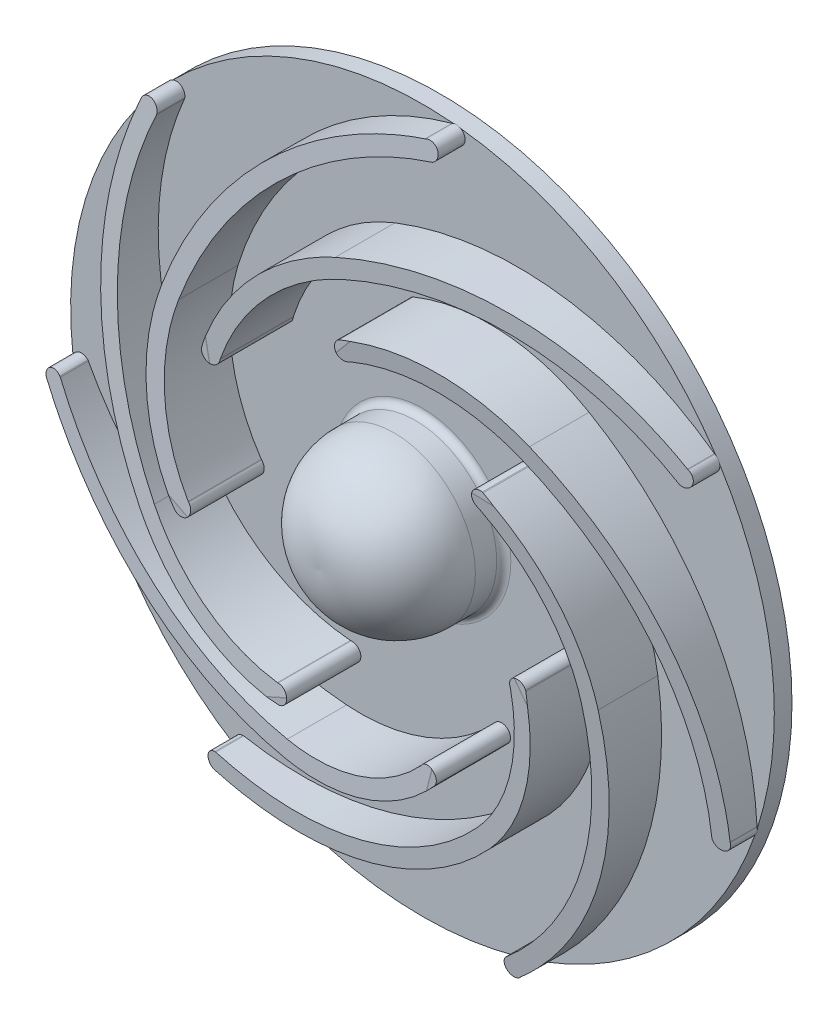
ISO-10303-21;
HEADER;
FILE_DESCRIPTION(('STEP AP214'),'2;1');
FILE_NAME('part.step','',(''),(''),'','','');
FILE_SCHEMA(('AUTOMOTIVE_DESIGN { 1 0 10303 214 1 1 1 1 }'));
ENDSEC;
DATA;
#1=APPLICATION_CONTEXT('core data for automotive mechanical design processes');
#2=APPLICATION_PROTOCOL_DEFINITION('international standard','automotive_design',2000,#1);
#3=PRODUCT_CONTEXT('',#1,'mechanical');
#4=PRODUCT('Part','Part','',(#3));
#5=PRODUCT_RELATED_PRODUCT_CATEGORY('part','',(#4));
#6=PRODUCT_DEFINITION_FORMATION('','',#4);
#7=PRODUCT_DEFINITION_CONTEXT('part definition',#1,'design');
#8=PRODUCT_DEFINITION('design','',#6,#7);
#9=PRODUCT_DEFINITION_SHAPE('','',#8);
#10=(LENGTH_UNIT() NAMED_UNIT(*) SI_UNIT(.MILLI.,.METRE.));
#11=(NAMED_UNIT(*) PLANE_ANGLE_UNIT() SI_UNIT($,.RADIAN.));
#12=(NAMED_UNIT(*) SI_UNIT($,.STERADIAN.) SOLID_ANGLE_UNIT());
#13=UNCERTAINTY_MEASURE_WITH_UNIT(LENGTH_MEASURE(1.E-05),#10,'distance_accuracy_value','');
#14=(GEOMETRIC_REPRESENTATION_CONTEXT(3) GLOBAL_UNCERTAINTY_ASSIGNED_CONTEXT((#13)) GLOBAL_UNIT_ASSIGNED_CONTEXT((#10,
#11,#12)) REPRESENTATION_CONTEXT('',''));
#15=CARTESIAN_POINT('',(0.,0.,0.));
#16=DIRECTION('',(0.,0.,1.));
#17=DIRECTION('',(1.,0.,0.));
#18=AXIS2_PLACEMENT_3D('',#15,#16,#17);
#19=CARTESIAN_POINT('',(0.,0.,42.9260980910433));
#20=DIRECTION('',(0.,0.,1.));
#21=DIRECTION('',(1.,0.,0.));
#22=AXIS2_PLACEMENT_3D('',#19,#20,#21);
#23=CYLINDRICAL_SURFACE('',#22,20.);
#24=DIRECTION('',(0.,0.,1.));
#25=VECTOR('',#24,1.);
#26=CARTESIAN_POINT('',(-3.,19.7737199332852,42.9260980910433));
#27=LINE('',#26,#25);
#28=CARTESIAN_POINT('',(-3.,19.7737199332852,0.));
#29=VERTEX_POINT('',#28);
#30=CARTESIAN_POINT('',(-3.,19.7737199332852,-3.00000000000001));
#31=VERTEX_POINT('',#30);
#32=EDGE_CURVE('E2201',#29,#31,#27,.F.);
#33=ORIENTED_EDGE('',*,*,#32,.F.);
#34=CARTESIAN_POINT('',(0.,0.,0.));
#35=DIRECTION('',(0.,0.,-1.));
#36=DIRECTION('',(-1.,0.,0.));
#37=AXIS2_PLACEMENT_3D('',#34,#35,#36);
#38=CIRCLE('',#37,20.);
#39=CARTESIAN_POINT('',(3.,19.7737199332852,0.));
#40=VERTEX_POINT('',#39);
#41=EDGE_CURVE('E12',#29,#40,#38,.T.);
#42=ORIENTED_EDGE('',*,*,#41,.T.);
#43=DIRECTION('',(0.,0.,1.));
#44=VECTOR('',#43,1.);
#45=CARTESIAN_POINT('',(3.,19.7737199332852,42.9260980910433));
#46=LINE('',#45,#44);
#47=CARTESIAN_POINT('',(3.,19.7737199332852,-3.00000000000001));
#48=VERTEX_POINT('',#47);
#49=EDGE_CURVE('E656',#48,#40,#46,.T.);
#50=ORIENTED_EDGE('',*,*,#49,.F.);
#51=CARTESIAN_POINT('',(0.,0.,-3.00000000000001));
#52=DIRECTION('',(0.,0.,1.));
#53=DIRECTION('',(1.,0.,0.));
#54=AXIS2_PLACEMENT_3D('',#51,#52,#53);
#55=CIRCLE('',#54,20.);
#56=EDGE_CURVE('E870',#31,#48,#55,.T.);
#57=ORIENTED_EDGE('',*,*,#56,.F.);
#58=EDGE_LOOP('',(#33,#42,#50,#57));
#59=FACE_BOUND('',#58,.T.);
#60=CARTESIAN_POINT('',(0.,0.,8.53112643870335));
#61=DIRECTION('',(0.,0.,-1.));
#62=DIRECTION('',(0.,1.,0.));
#63=AXIS2_PLACEMENT_3D('',#60,#61,#62);
#64=CIRCLE('',#63,20.);
#65=CARTESIAN_POINT('',(0.,20.,8.53112643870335));
#66=VERTEX_POINT('',#65);
#67=EDGE_CURVE('E1060',#66,#66,#64,.T.);
#68=ORIENTED_EDGE('',*,*,#67,.F.);
#69=EDGE_LOOP('',(#68));
#70=FACE_BOUND('',#69,.T.);
#71=ADVANCED_FACE('F40',(#59,#70),#23,.F.);
#72=CARTESIAN_POINT('',(0.,0.,-3.00000000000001));
#73=DIRECTION('',(0.,0.,1.));
#74=DIRECTION('',(1.,0.,0.));
#75=AXIS2_PLACEMENT_3D('',#72,#73,#74);
#76=TOROIDAL_SURFACE('',#75,22.,2.);
#77=CARTESIAN_POINT('',(0.,0.,-5.00000000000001));
#78=DIRECTION('',(0.,0.,1.));
#79=DIRECTION('',(1.,0.,0.));
#80=AXIS2_PLACEMENT_3D('',#77,#78,#79);
#81=CIRCLE('',#80,22.);
#82=CARTESIAN_POINT('',(-3.,21.7944947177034,-5.00000000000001));
#83=VERTEX_POINT('',#82);
#84=CARTESIAN_POINT('',(3.,21.7944947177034,-5.00000000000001));
#85=VERTEX_POINT('',#84);
#86=EDGE_CURVE('E867',#83,#85,#81,.T.);
#87=ORIENTED_EDGE('',*,*,#86,.F.);
#88=CARTESIAN_POINT('',(-3.,20.1687347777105,-4.18740632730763));
#89=CARTESIAN_POINT('',(-3.,20.1019539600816,-4.09787102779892));
#90=CARTESIAN_POINT('',(-3.,20.0426352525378,-4.00267497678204));
#91=CARTESIAN_POINT('',(-3.,19.9407449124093,-3.80361239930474));
#92=CARTESIAN_POINT('',(-3.,19.8981913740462,-3.69973665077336));
#93=CARTESIAN_POINT('',(-3.,19.8311793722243,-3.48630584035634));
#94=CARTESIAN_POINT('',(-3.,19.806718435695,-3.37675155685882));
#95=CARTESIAN_POINT('',(-3.,19.7766451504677,-3.15511273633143));
#96=CARTESIAN_POINT('',(-3.,19.7710282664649,-3.04302881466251));
#97=CARTESIAN_POINT('',(-3.,19.7787825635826,-2.82004821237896));
#98=CARTESIAN_POINT('',(-3.,19.7920647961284,-2.70914842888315));
#99=CARTESIAN_POINT('',(-3.,19.837052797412,-2.49115004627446));
#100=CARTESIAN_POINT('',(-3.,19.8687590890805,-2.38405155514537));
#101=CARTESIAN_POINT('',(-3.,19.9496586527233,-2.17661786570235));
#102=CARTESIAN_POINT('',(-3.,19.9988608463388,-2.07628614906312));
#103=CARTESIAN_POINT('',(-3.,20.1132882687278,-1.88522212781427));
#104=CARTESIAN_POINT('',(-3.,20.1785140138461,-1.79449013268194));
#105=CARTESIAN_POINT('',(-3.,20.323649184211,-1.62444106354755));
#106=CARTESIAN_POINT('',(-3.,20.4036671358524,-1.54521663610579));
#107=CARTESIAN_POINT('',(-3.,20.5757460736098,-1.4011553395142));
#108=CARTESIAN_POINT('',(-3.,20.667807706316,-1.33631924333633));
#109=CARTESIAN_POINT('',(-3.,20.8624009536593,-1.22215933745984));
#110=CARTESIAN_POINT('',(-3.,20.9650325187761,-1.17300588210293));
#111=CARTESIAN_POINT('',(-3.,21.1770459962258,-1.09246748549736));
#112=CARTESIAN_POINT('',(-3.,21.2864282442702,-1.06108342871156));
#113=CARTESIAN_POINT('',(-3.,21.5097910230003,-1.01674684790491));
#114=CARTESIAN_POINT('',(-3.,21.6238016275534,-1.00394570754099));
#115=CARTESIAN_POINT('',(-3.,21.8523583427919,-0.997616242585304));
#116=CARTESIAN_POINT('',(-3.,21.9669044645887,-1.00408831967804));
#117=CARTESIAN_POINT('',(-3.,22.193551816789,-1.03618678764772));
#118=CARTESIAN_POINT('',(-3.,22.3056468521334,-1.06185697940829));
#119=CARTESIAN_POINT('',(-3.,22.5239093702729,-1.13172288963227));
#120=CARTESIAN_POINT('',(-3.,22.6300769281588,-1.1759183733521));
#121=CARTESIAN_POINT('',(-3.,22.83302438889,-1.28143129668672));
#122=CARTESIAN_POINT('',(-3.,22.9298382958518,-1.34268331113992));
#123=CARTESIAN_POINT('',(-3.,23.1117061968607,-1.48068814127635));
#124=CARTESIAN_POINT('',(-3.,23.1967606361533,-1.55744036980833));
#125=CARTESIAN_POINT('',(-3.,23.3520006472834,-1.72365018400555));
#126=CARTESIAN_POINT('',(-3.,23.4222939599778,-1.8130071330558));
#127=CARTESIAN_POINT('',(-3.,23.546736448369,-2.0023334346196));
#128=CARTESIAN_POINT('',(-3.,23.6008863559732,-2.10230230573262));
#129=CARTESIAN_POINT('',(-3.,23.6910556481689,-2.30914885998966));
#130=CARTESIAN_POINT('',(-3.,23.7272172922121,-2.4159645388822));
#131=CARTESIAN_POINT('',(-3.,23.7809822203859,-2.63416817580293));
#132=CARTESIAN_POINT('',(-3.,23.7985861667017,-2.74555597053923));
#133=CARTESIAN_POINT('',(-3.,23.814665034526,-2.96908285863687));
#134=CARTESIAN_POINT('',(-3.,23.8132451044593,-3.08121440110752));
#135=CARTESIAN_POINT('',(-3.,23.7915744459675,-3.30364135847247));
#136=CARTESIAN_POINT('',(-3.,23.7713239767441,-3.41393679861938));
#137=CARTESIAN_POINT('',(-3.,23.7126279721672,-3.6294304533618));
#138=CARTESIAN_POINT('',(-3.,23.6742042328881,-3.73463460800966));
#139=CARTESIAN_POINT('',(-3.,23.5802990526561,-3.93713013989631));
#140=CARTESIAN_POINT('',(-3.,23.5248174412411,-4.0344214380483));
#141=CARTESIAN_POINT('',(-3.,23.3981889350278,-4.21870765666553));
#142=CARTESIAN_POINT('',(-3.,23.32698830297,-4.30566564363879));
#143=CARTESIAN_POINT('',(-3.,23.1710909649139,-4.46649710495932));
#144=CARTESIAN_POINT('',(-3.,23.0863937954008,-4.54037012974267));
#145=CARTESIAN_POINT('',(-3.,22.905279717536,-4.67349773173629));
#146=CARTESIAN_POINT('',(-3.,22.8087847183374,-4.73264605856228));
#147=CARTESIAN_POINT('',(-3.,22.6072961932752,-4.83405532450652));
#148=CARTESIAN_POINT('',(-3.,22.5023022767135,-4.87631548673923));
#149=CARTESIAN_POINT('',(-3.,22.2858736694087,-4.94310724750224));
#150=CARTESIAN_POINT('',(-3.,22.1743931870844,-4.96749048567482));
#151=CARTESIAN_POINT('',(-3.,21.9489305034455,-4.99732135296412));
#152=CARTESIAN_POINT('',(-3.,21.8349482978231,-5.00276894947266));
#153=CARTESIAN_POINT('',(-3.,21.6069748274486,-4.99457710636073));
#154=CARTESIAN_POINT('',(-3.,21.4929877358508,-4.98082121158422));
#155=CARTESIAN_POINT('',(-3.,21.2689003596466,-4.93438830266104));
#156=CARTESIAN_POINT('',(-3.,21.1588011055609,-4.90170631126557));
#157=CARTESIAN_POINT('',(-3.,20.9454845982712,-4.81824827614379));
#158=CARTESIAN_POINT('',(-3.,20.8422791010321,-4.76744221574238));
#159=CARTESIAN_POINT('',(-3.,20.6460166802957,-4.64916682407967));
#160=CARTESIAN_POINT('',(-3.,20.5529476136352,-4.58171775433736));
#161=CARTESIAN_POINT('',(-3.,20.4111095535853,-4.45926677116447));
#162=CARTESIAN_POINT('',(-3.,20.3585157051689,-4.40862238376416));
#163=CARTESIAN_POINT('',(-3.,20.2591322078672,-4.30192535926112));
#164=CARTESIAN_POINT('',(-3.,20.212342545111,-4.24587273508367));
#165=CARTESIAN_POINT('',(-3.,20.1687347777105,-4.18740632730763));
#166=B_SPLINE_CURVE_WITH_KNOTS('',3,(#88,#89,#90,#91,#92,#93,#94,#95,#96,#97,#98,#99,#100,#101,
#102,#103,#104,#105,#106,#107,#108,#109,#110,#111,#112,#113,#114,#115,#116,#117,#118,#119,#120,
#121,#122,#123,#124,#125,#126,#127,#128,#129,#130,#131,#132,#133,#134,#135,#136,#137,#138,#139,
#140,#141,#142,#143,#144,#145,#146,#147,#148,#149,#150,#151,#152,#153,#154,#155,#156,#157,#158,
#159,#160,#161,#162,#163,#164,#165),.UNSPECIFIED.,.T.,.F.,(4,2,2,2,2,2,2,2,2,2,2,2,2,2,2,2,2,2,
2,2,2,2,2,2,2,2,2,2,2,2,2,2,2,2,2,2,2,2,4),(0.,0.334828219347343,0.670016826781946,
1.00515960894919,1.3402217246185,1.67371207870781,2.00721189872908,2.34088202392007,
2.67456290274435,3.01079676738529,3.34704869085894,3.6868377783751,4.02664377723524,
4.36920272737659,4.71176881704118,5.05511887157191,5.39846457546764,5.74051100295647,
6.08254447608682,6.42198730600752,6.76141474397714,7.09811337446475,7.43479999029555,
7.76962644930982,8.10444829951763,8.43886959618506,8.77329423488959,9.10888035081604,
9.44447799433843,9.78243128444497,10.1204001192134,10.4611429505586,10.801886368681,
11.1447051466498,11.487614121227,11.831093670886,12.1741571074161,12.3927999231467,
12.6114422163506),.UNSPECIFIED.);
#167=EDGE_CURVE('E2215',#83,#31,#166,.T.);
#168=ORIENTED_EDGE('',*,*,#167,.T.);
#169=ORIENTED_EDGE('',*,*,#56,.T.);
#170=CARTESIAN_POINT('',(3.,20.1687347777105,-4.18740632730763));
#171=CARTESIAN_POINT('',(3.,20.2365269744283,-4.27828077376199));
#172=CARTESIAN_POINT('',(3.,20.3121071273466,-4.36345531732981));
#173=CARTESIAN_POINT('',(3.,20.4765904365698,-4.51994367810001));
#174=CARTESIAN_POINT('',(3.,20.5655112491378,-4.59123883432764));
#175=CARTESIAN_POINT('',(3.,20.7539613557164,-4.71787391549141));
#176=CARTESIAN_POINT('',(3.,20.8534811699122,-4.77322793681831));
#177=CARTESIAN_POINT('',(3.,21.0603249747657,-4.86655062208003));
#178=CARTESIAN_POINT('',(3.,21.1676469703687,-4.90452371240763));
#179=CARTESIAN_POINT('',(3.,21.3878338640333,-4.96228320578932));
#180=CARTESIAN_POINT('',(3.,21.5007305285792,-4.98194856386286));
#181=CARTESIAN_POINT('',(3.,21.7282293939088,-5.00212080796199));
#182=CARTESIAN_POINT('',(3.,21.8428317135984,-5.00262635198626));
#183=CARTESIAN_POINT('',(3.,22.0708987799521,-4.98441391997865));
#184=CARTESIAN_POINT('',(3.,22.1843582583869,-4.96562982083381));
#185=CARTESIAN_POINT('',(3.,22.4064972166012,-4.90922723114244));
#186=CARTESIAN_POINT('',(3.,22.51517673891,-4.87160890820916));
#187=CARTESIAN_POINT('',(3.,22.7243291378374,-4.77868381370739));
#188=CARTESIAN_POINT('',(3.,22.8248241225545,-4.72342682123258));
#189=CARTESIAN_POINT('',(3.,23.0150215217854,-4.59671027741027));
#190=CARTESIAN_POINT('',(3.,23.1047243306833,-4.52525131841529));
#191=CARTESIAN_POINT('',(3.,23.2700988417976,-4.36869494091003));
#192=CARTESIAN_POINT('',(3.,23.3458659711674,-4.28369833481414));
#193=CARTESIAN_POINT('',(3.,23.4819129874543,-4.10210107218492));
#194=CARTESIAN_POINT('',(3.,23.5421935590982,-4.00550092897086));
#195=CARTESIAN_POINT('',(3.,23.6450397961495,-3.80429168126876));
#196=CARTESIAN_POINT('',(3.,23.6877466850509,-3.69975475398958));
#197=CARTESIAN_POINT('',(3.,23.7548805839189,-3.48496761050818));
#198=CARTESIAN_POINT('',(3.,23.7793083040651,-3.37471761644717));
#199=CARTESIAN_POINT('',(3.,23.8090607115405,-3.15236225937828));
#200=CARTESIAN_POINT('',(3.,23.8145020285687,-3.04027248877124));
#201=CARTESIAN_POINT('',(3.,23.8064461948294,-2.81677691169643));
#202=CARTESIAN_POINT('',(3.,23.7929493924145,-2.70537109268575));
#203=CARTESIAN_POINT('',(3.,23.7474658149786,-2.48664094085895));
#204=CARTESIAN_POINT('',(3.,23.7155169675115,-2.3793087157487));
#205=CARTESIAN_POINT('',(3.,23.6340997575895,-2.17151078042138));
#206=CARTESIAN_POINT('',(3.,23.5846312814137,-2.07104511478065));
#207=CARTESIAN_POINT('',(3.,23.4694639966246,-1.87952858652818));
#208=CARTESIAN_POINT('',(3.,23.403722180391,-1.78850359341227));
#209=CARTESIAN_POINT('',(3.,23.2579813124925,-1.61869264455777));
#210=CARTESIAN_POINT('',(3.,23.1779818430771,-1.53990704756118));
#211=CARTESIAN_POINT('',(3.,23.0054488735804,-1.39625044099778));
#212=CARTESIAN_POINT('',(3.,22.9128370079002,-1.33147356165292));
#213=CARTESIAN_POINT('',(3.,22.7181240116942,-1.21823975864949));
#214=CARTESIAN_POINT('',(3.,22.6160224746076,-1.16978353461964));
#215=CARTESIAN_POINT('',(3.,22.4043325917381,-1.09014944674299));
#216=CARTESIAN_POINT('',(3.,22.2946897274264,-1.05911649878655));
#217=CARTESIAN_POINT('',(3.,22.0717648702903,-1.01576001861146));
#218=CARTESIAN_POINT('',(3.,21.9584827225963,-1.00343728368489));
#219=CARTESIAN_POINT('',(3.,21.7306730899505,-0.99779372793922));
#220=CARTESIAN_POINT('',(3.,21.6161423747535,-1.00460268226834));
#221=CARTESIAN_POINT('',(3.,21.3898365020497,-1.03730393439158));
#222=CARTESIAN_POINT('',(3.,21.2780614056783,-1.06319665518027));
#223=CARTESIAN_POINT('',(3.,21.0601859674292,-1.13343951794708));
#224=CARTESIAN_POINT('',(3.,20.9540990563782,-1.17783134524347));
#225=CARTESIAN_POINT('',(3.,20.7509239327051,-1.28386492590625));
#226=CARTESIAN_POINT('',(3.,20.6538356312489,-1.34550650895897));
#227=CARTESIAN_POINT('',(3.,20.4718657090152,-1.48405725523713));
#228=CARTESIAN_POINT('',(3.,20.3869360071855,-1.56090324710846));
#229=CARTESIAN_POINT('',(3.,20.2313322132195,-1.72788320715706));
#230=CARTESIAN_POINT('',(3.,20.1606574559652,-1.81801655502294));
#231=CARTESIAN_POINT('',(3.,20.0362875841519,-2.00812202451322));
#232=CARTESIAN_POINT('',(3.,19.9824403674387,-2.10799462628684));
#233=CARTESIAN_POINT('',(3.,19.8924810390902,-2.31542676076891));
#234=CARTESIAN_POINT('',(3.,19.8563670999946,-2.42298550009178));
#235=CARTESIAN_POINT('',(3.,19.8032662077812,-2.64153744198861));
#236=CARTESIAN_POINT('',(3.,19.7860842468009,-2.75248329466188));
#237=CARTESIAN_POINT('',(3.,19.7707067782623,-2.97571237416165));
#238=CARTESIAN_POINT('',(3.,19.7725152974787,-3.08799587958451));
#239=CARTESIAN_POINT('',(3.,19.7950058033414,-3.31004842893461));
#240=CARTESIAN_POINT('',(3.,19.8155891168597,-3.4198275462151));
#241=CARTESIAN_POINT('',(3.,19.8748559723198,-3.6342844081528));
#242=CARTESIAN_POINT('',(3.,19.9135174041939,-3.73896821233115));
#243=CARTESIAN_POINT('',(3.,19.9892682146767,-3.90093804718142));
#244=CARTESIAN_POINT('',(3.,20.0210662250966,-3.9607579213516));
#245=CARTESIAN_POINT('',(3.,20.0905624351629,-4.0768645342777));
#246=CARTESIAN_POINT('',(3.,20.1282606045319,-4.13315129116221));
#247=CARTESIAN_POINT('',(3.,20.1687347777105,-4.18740632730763));
#248=B_SPLINE_CURVE_WITH_KNOTS('',3,(#170,#171,#172,#173,#174,#175,#176,#177,#178,#179,#180,
#181,#182,#183,#184,#185,#186,#187,#188,#189,#190,#191,#192,#193,#194,#195,#196,#197,#198,#199,
#200,#201,#202,#203,#204,#205,#206,#207,#208,#209,#210,#211,#212,#213,#214,#215,#216,#217,#218,
#219,#220,#221,#222,#223,#224,#225,#226,#227,#228,#229,#230,#231,#232,#233,#234,#235,#236,#237,
#238,#239,#240,#241,#242,#243,#244,#245,#246,#247),.UNSPECIFIED.,.T.,.F.,(4,2,2,2,2,2,2,2,2,2,2,
2,2,2,2,2,2,2,2,2,2,2,2,2,2,2,2,2,2,2,2,2,2,2,2,2,2,2,4),(0.,0.339875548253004,
0.680204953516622,1.02023248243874,1.36017336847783,1.70234619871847,2.04454299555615,
2.38791673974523,2.73128742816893,3.07369751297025,3.41609508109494,3.75605281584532,
4.09599551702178,4.43315039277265,4.77029216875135,5.10535926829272,5.44042020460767,
5.77479487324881,6.10917171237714,6.44444186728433,6.77972184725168,7.11718915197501,
7.45467092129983,7.79491957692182,8.13518273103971,8.47775953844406,8.82034393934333,
9.16370451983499,9.50706171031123,9.84902119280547,10.1909647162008,10.5297215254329,
10.8684434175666,11.2036427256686,11.5389131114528,11.8724315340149,12.2055431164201,
12.4084610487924,12.6113779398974),.UNSPECIFIED.);
#249=EDGE_CURVE('E664',#48,#85,#248,.T.);
#250=ORIENTED_EDGE('',*,*,#249,.T.);
#251=EDGE_LOOP('',(#87,#168,#169,#250));
#252=FACE_BOUND('',#251,.T.);
#253=ADVANCED_FACE('F673',(#252),#76,.T.);
#254=CARTESIAN_POINT('',(0.,0.,-5.));
#255=DIRECTION('',(0.,0.,-1.));
#256=DIRECTION('',(-1.,0.,0.));
#257=AXIS2_PLACEMENT_3D('',#254,#255,#256);
#258=PLANE('',#257);
#259=DIRECTION('',(0.,1.,0.));
#260=VECTOR('',#259,1.);
#261=CARTESIAN_POINT('',(-3.,0.,-5.));
#262=LINE('',#261,#260);
#263=CARTESIAN_POINT('',(-3.,24.0054897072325,-5.));
#264=VERTEX_POINT('',#263);
#265=EDGE_CURVE('E49',#83,#264,#262,.T.);
#266=ORIENTED_EDGE('',*,*,#265,.F.);
#267=ORIENTED_EDGE('',*,*,#86,.T.);
#268=DIRECTION('',(0.,-1.,0.));
#269=VECTOR('',#268,1.);
#270=CARTESIAN_POINT('',(3.,0.,-5.));
#271=LINE('',#270,#269);
#272=CARTESIAN_POINT('',(3.,24.0054897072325,-5.));
#273=VERTEX_POINT('',#272);
#274=EDGE_CURVE('E2833',#273,#85,#271,.T.);
#275=ORIENTED_EDGE('',*,*,#274,.F.);
#276=DIRECTION('',(1.,0.,0.));
#277=VECTOR('',#276,1.);
#278=CARTESIAN_POINT('',(0.,24.0054897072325,-5.));
#279=LINE('',#278,#277);
#280=EDGE_CURVE('E647',#264,#273,#279,.T.);
#281=ORIENTED_EDGE('',*,*,#280,.F.);
#282=EDGE_LOOP('',(#266,#267,#275,#281));
#283=FACE_BOUND('',#282,.T.);
#284=CARTESIAN_POINT('',(0.,0.,-5.));
#285=DIRECTION('',(0.,0.,1.));
#286=DIRECTION('',(1.,0.,0.));
#287=AXIS2_PLACEMENT_3D('',#284,#285,#286);
#288=CIRCLE('',#287,99.5);
#289=CARTESIAN_POINT('',(99.5,0.,-5.));
#290=VERTEX_POINT('',#289);
#291=EDGE_CURVE('E866',#290,#290,#288,.T.);
#292=ORIENTED_EDGE('',*,*,#291,.F.);
#293=EDGE_LOOP('',(#292));
#294=FACE_BOUND('',#293,.T.);
#295=ADVANCED_FACE('F763',(#283,#294),#258,.T.);
#296=CARTESIAN_POINT('',(0.,0.,42.9260980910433));
#297=DIRECTION('',(0.,0.,1.));
#298=DIRECTION('',(1.,0.,0.));
#299=AXIS2_PLACEMENT_3D('',#296,#297,#298);
#300=CYLINDRICAL_SURFACE('',#299,99.5);
#301=ORIENTED_EDGE('',*,*,#291,.T.);
#302=EDGE_LOOP('',(#301));
#303=FACE_BOUND('',#302,.T.);
#304=CARTESIAN_POINT('',(0.,0.,0.));
#305=DIRECTION('',(0.,0.,1.));
#306=DIRECTION('',(1.,0.,0.));
#307=AXIS2_PLACEMENT_3D('',#304,#305,#306);
#308=CIRCLE('',#307,99.5);
#309=CARTESIAN_POINT('',(94.0231020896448,-32.5562017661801,0.));
#310=VERTEX_POINT('',#309);
#311=CARTESIAN_POINT('',(94.6784419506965,-30.5980821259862,0.));
#312=VERTEX_POINT('',#311);
#313=EDGE_CURVE('E868',#310,#312,#308,.T.);
#314=ORIENTED_EDGE('',*,*,#313,.F.);
#315=CARTESIAN_POINT('',(35.1084991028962,-93.1001787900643,0.));
#316=VERTEX_POINT('',#315);
#317=EDGE_CURVE('E875',#316,#310,#308,.T.);
#318=ORIENTED_EDGE('',*,*,#317,.F.);
#319=CARTESIAN_POINT('',(0.,0.,0.));
#320=DIRECTION('',(0.,0.,1.));
#321=DIRECTION('',(0.623489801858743,-0.781831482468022,0.));
#322=AXIS2_PLACEMENT_3D('',#319,#320,#321);
#323=CIRCLE('',#322,99.5);
#324=CARTESIAN_POINT('',(33.1689818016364,-93.8086810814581,0.));
#325=VERTEX_POINT('',#324);
#326=EDGE_CURVE('E2074',#325,#316,#323,.T.);
#327=ORIENTED_EDGE('',*,*,#326,.F.);
#328=CARTESIAN_POINT('',(-50.8988596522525,-85.4959419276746,0.));
#329=VERTEX_POINT('',#328);
#330=EDGE_CURVE('E923',#329,#325,#308,.T.);
#331=ORIENTED_EDGE('',*,*,#330,.F.);
#332=CARTESIAN_POINT('',(0.,0.,0.));
#333=DIRECTION('',(0.,0.,1.));
#334=DIRECTION('',(-0.222520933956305,-0.974927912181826,0.));
#335=AXIS2_PLACEMENT_3D('',#332,#333,#334);
#336=CIRCLE('',#335,99.5);
#337=CARTESIAN_POINT('',(-52.662058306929,-84.4213101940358,0.));
#338=VERTEX_POINT('',#337);
#339=EDGE_CURVE('E1962',#338,#329,#336,.T.);
#340=ORIENTED_EDGE('',*,*,#339,.F.);
#341=CARTESIAN_POINT('',(-98.5783389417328,-13.5115169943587,0.));
#342=VERTEX_POINT('',#341);
#343=EDGE_CURVE('E929',#342,#338,#308,.T.);
#344=ORIENTED_EDGE('',*,*,#343,.F.);
#345=CARTESIAN_POINT('',(0.,0.,0.));
#346=DIRECTION('',(0.,0.,1.));
#347=DIRECTION('',(-0.900968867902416,-0.433883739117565,0.));
#348=AXIS2_PLACEMENT_3D('',#345,#346,#347);
#349=CIRCLE('',#348,99.5);
#350=CARTESIAN_POINT('',(-98.8374944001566,-11.4629708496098,0.));
#351=VERTEX_POINT('',#350);
#352=EDGE_CURVE('E1677',#351,#342,#349,.T.);
#353=ORIENTED_EDGE('',*,*,#352,.F.);
#354=CARTESIAN_POINT('',(-72.0263183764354,68.6473558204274,0.));
#355=VERTEX_POINT('',#354);
#356=EDGE_CURVE('E934',#355,#351,#308,.T.);
#357=ORIENTED_EDGE('',*,*,#356,.F.);
#358=CARTESIAN_POINT('',(0.,0.,0.));
#359=DIRECTION('',(0.,0.,1.));
#360=DIRECTION('',(-0.900968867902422,0.433883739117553,0.));
#361=AXIS2_PLACEMENT_3D('',#358,#359,#360);
#362=CIRCLE('',#361,99.5);
#363=CARTESIAN_POINT('',(-70.5862812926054,70.1272193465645,0.));
#364=VERTEX_POINT('',#363);
#365=EDGE_CURVE('E1552',#364,#355,#362,.T.);
#366=ORIENTED_EDGE('',*,*,#365,.F.);
#367=CARTESIAN_POINT('',(8.76298899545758,99.113369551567,0.));
#368=VERTEX_POINT('',#367);
#369=EDGE_CURVE('E939',#368,#364,#308,.T.);
#370=ORIENTED_EDGE('',*,*,#369,.F.);
#371=CARTESIAN_POINT('',(0.,0.,0.));
#372=DIRECTION('',(0.,0.,1.));
#373=DIRECTION('',(-0.222520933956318,0.974927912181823,0.));
#374=AXIS2_PLACEMENT_3D('',#371,#372,#373);
#375=CIRCLE('',#374,99.5);
#376=CARTESIAN_POINT('',(10.8178413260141,98.9101830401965,0.));
#377=VERTEX_POINT('',#376);
#378=EDGE_CURVE('E1412',#377,#368,#375,.T.);
#379=ORIENTED_EDGE('',*,*,#378,.F.);
#380=CARTESIAN_POINT('',(82.9535869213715,54.9449944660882,0.));
#381=VERTEX_POINT('',#380);
#382=EDGE_CURVE('E944',#381,#377,#308,.T.);
#383=ORIENTED_EDGE('',*,*,#382,.F.);
#384=CARTESIAN_POINT('',(0.,0.,0.));
#385=DIRECTION('',(0.,0.,1.));
#386=DIRECTION('',(0.623489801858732,0.781831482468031,0.));
#387=AXIS2_PLACEMENT_3D('',#384,#385,#386);
#388=CIRCLE('',#387,99.5);
#389=CARTESIAN_POINT('',(84.0759087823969,53.2117615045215,0.));
#390=VERTEX_POINT('',#389);
#391=EDGE_CURVE('E962',#390,#381,#388,.T.);
#392=ORIENTED_EDGE('',*,*,#391,.F.);
#393=EDGE_CURVE('E873',#312,#390,#308,.T.);
#394=ORIENTED_EDGE('',*,*,#393,.F.);
#395=EDGE_LOOP('',(#314,#318,#327,#331,#340,#344,#353,#357,#366,#370,#379,#383,#392,#394));
#396=FACE_BOUND('',#395,.T.);
#397=ADVANCED_FACE('F852',(#303,#396),#300,.T.);
#398=CARTESIAN_POINT('',(0.,0.,0.));
#399=DIRECTION('',(0.,0.,1.));
#400=DIRECTION('',(1.,0.,0.));
#401=AXIS2_PLACEMENT_3D('',#398,#399,#400);
#402=PLANE('',#401);
#403=CARTESIAN_POINT('',(33.3581985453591,-91.3177049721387,0.));
#404=DIRECTION('',(0.,0.,1.));
#405=DIRECTION('',(0.623489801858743,-0.781831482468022,0.));
#406=AXIS2_PLACEMENT_3D('',#403,#404,#405);
#407=CIRCLE('',#406,2.49815230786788);
#408=CARTESIAN_POINT('',(31.2875410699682,-89.9201561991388,0.));
#409=VERTEX_POINT('',#408);
#410=EDGE_CURVE('E2104',#409,#325,#407,.T.);
#411=ORIENTED_EDGE('',*,*,#410,.F.);
#412=CARTESIAN_POINT('',(32.1164166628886,-90.4795891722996,0.));
#413=DIRECTION('',(0.,0.,1.));
#414=DIRECTION('',(0.623489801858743,-0.781831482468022,0.));
#415=AXIS2_PLACEMENT_3D('',#412,#413,#414);
#416=CIRCLE('',#415,1.);
#417=CARTESIAN_POINT('',(31.4622233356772,-89.7232618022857,0.));
#418=VERTEX_POINT('',#417);
#419=EDGE_CURVE('E2118',#409,#418,#416,.F.);
#420=ORIENTED_EDGE('',*,*,#419,.T.);
#421=CARTESIAN_POINT('',(-27.6703115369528,-21.3588307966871,0.));
#422=DIRECTION('',(0.,0.,1.));
#423=DIRECTION('',(0.623489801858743,-0.781831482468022,0.));
#424=AXIS2_PLACEMENT_3D('',#421,#422,#423);
#425=CIRCLE('',#424,90.3900000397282);
#426=CARTESIAN_POINT('',(61.7154295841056,-7.92226161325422,0.));
#427=VERTEX_POINT('',#426);
#428=EDGE_CURVE('E2099',#418,#427,#425,.T.);
#429=ORIENTED_EDGE('',*,*,#428,.T.);
#430=CARTESIAN_POINT('',(10.6070210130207,-15.6049373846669,0.));
#431=DIRECTION('',(0.,0.,1.));
#432=DIRECTION('',(-0.781831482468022,-0.623489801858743,0.));
#433=AXIS2_PLACEMENT_3D('',#430,#431,#432);
#434=CIRCLE('',#433,51.6826173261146);
#435=CARTESIAN_POINT('',(36.5973969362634,29.0671265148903,0.));
#436=VERTEX_POINT('',#435);
#437=EDGE_CURVE('E2135',#427,#436,#434,.T.);
#438=ORIENTED_EDGE('',*,*,#437,.T.);
#439=CARTESIAN_POINT('',(36.0945126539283,28.2027727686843,0.));
#440=DIRECTION('',(0.,0.,1.));
#441=DIRECTION('',(0.623489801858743,-0.781831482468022,0.));
#442=AXIS2_PLACEMENT_3D('',#439,#440,#441);
#443=CIRCLE('',#442,1.);
#444=CARTESIAN_POINT('',(36.4328784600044,29.1437874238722,0.));
#445=VERTEX_POINT('',#444);
#446=EDGE_CURVE('E2095',#436,#445,#443,.T.);
#447=ORIENTED_EDGE('',*,*,#446,.T.);
#448=CARTESIAN_POINT('',(37.278792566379,31.4963229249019,0.));
#449=DIRECTION('',(0.,0.,1.));
#450=DIRECTION('',(0.623489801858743,-0.781831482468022,0.));
#451=AXIS2_PLACEMENT_3D('',#448,#449,#450);
#452=CIRCLE('',#451,2.49999879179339);
#453=CARTESIAN_POINT('',(37.9089703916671,33.9155934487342,0.));
#454=VERTEX_POINT('',#453);
#455=EDGE_CURVE('E2078',#454,#445,#452,.T.);
#456=ORIENTED_EDGE('',*,*,#455,.F.);
#457=CARTESIAN_POINT('',(37.6568991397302,32.9478847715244,0.));
#458=DIRECTION('',(0.,0.,1.));
#459=DIRECTION('',(0.623489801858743,-0.781831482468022,0.));
#460=AXIS2_PLACEMENT_3D('',#457,#458,#459);
#461=CIRCLE('',#460,1.);
#462=CARTESIAN_POINT('',(38.1435878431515,33.8214602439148,0.));
#463=VERTEX_POINT('',#462);
#464=EDGE_CURVE('E2163',#454,#463,#461,.F.);
#465=ORIENTED_EDGE('',*,*,#464,.T.);
#466=CARTESIAN_POINT('',(10.6070210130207,-15.6049373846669,0.));
#467=DIRECTION('',(0.,0.,-1.));
#468=DIRECTION('',(0.781831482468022,0.623489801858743,0.));
#469=AXIS2_PLACEMENT_3D('',#466,#467,#468);
#470=CIRCLE('',#469,56.5794246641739);
#471=CARTESIAN_POINT('',(66.557831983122,-7.19434601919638,0.));
#472=VERTEX_POINT('',#471);
#473=EDGE_CURVE('E2126',#463,#472,#470,.T.);
#474=ORIENTED_EDGE('',*,*,#473,.T.);
#475=CARTESIAN_POINT('',(-27.6703115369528,-21.3588307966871,0.));
#476=DIRECTION('',(0.,0.,1.));
#477=DIRECTION('',(0.623489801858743,-0.781831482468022,0.));
#478=AXIS2_PLACEMENT_3D('',#475,#476,#477);
#479=CIRCLE('',#478,95.2868073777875);
#480=CARTESIAN_POINT('',(35.4079190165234,-92.7781033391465,0.));
#481=VERTEX_POINT('',#480);
#482=EDGE_CURVE('E2156',#481,#472,#479,.T.);
#483=ORIENTED_EDGE('',*,*,#482,.F.);
#484=CARTESIAN_POINT('',(36.0699018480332,-93.5276223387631,0.));
#485=DIRECTION('',(0.,0.,1.));
#486=DIRECTION('',(0.623489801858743,-0.781831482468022,0.));
#487=AXIS2_PLACEMENT_3D('',#484,#485,#486);
#488=CIRCLE('',#487,1.);
#489=CARTESIAN_POINT('',(35.2947202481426,-92.8958838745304,0.));
#490=VERTEX_POINT('',#489);
#491=EDGE_CURVE('E2160',#481,#490,#488,.T.);
#492=ORIENTED_EDGE('',*,*,#491,.T.);
#493=CARTESIAN_POINT('',(33.3581985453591,-91.3177049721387,0.));
#494=DIRECTION('',(0.,0.,1.));
#495=DIRECTION('',(0.623489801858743,-0.781831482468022,0.));
#496=AXIS2_PLACEMENT_3D('',#493,#494,#495);
#497=CIRCLE('',#496,2.49815230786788);
#498=EDGE_CURVE('E2077',#316,#490,#497,.T.);
#499=ORIENTED_EDGE('',*,*,#498,.F.);
#500=ORIENTED_EDGE('',*,*,#317,.T.);
#501=CARTESIAN_POINT('',(92.1935532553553,-30.8551679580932,0.));
#502=DIRECTION('',(0.,0.,1.));
#503=DIRECTION('',(1.,0.,0.));
#504=AXIS2_PLACEMENT_3D('',#501,#502,#503);
#505=CIRCLE('',#504,2.49815230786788);
#506=CARTESIAN_POINT('',(89.8098718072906,-31.6027157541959,0.));
#507=VERTEX_POINT('',#506);
#508=EDGE_CURVE('E898',#507,#310,#505,.T.);
#509=ORIENTED_EDGE('',*,*,#508,.F.);
#510=CARTESIAN_POINT('',(90.7640495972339,-31.3034754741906,0.));
#511=DIRECTION('',(0.,0.,1.));
#512=DIRECTION('',(1.,0.,0.));
#513=AXIS2_PLACEMENT_3D('',#510,#511,#512);
#514=CIRCLE('',#513,1.);
#515=CARTESIAN_POINT('',(89.7648461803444,-31.3433820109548,0.));
#516=VERTEX_POINT('',#515);
#517=EDGE_CURVE('E968',#507,#516,#514,.F.);
#518=ORIENTED_EDGE('',*,*,#517,.T.);
#519=CARTESIAN_POINT('',(-0.553150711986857,-34.9505338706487,0.));
#520=DIRECTION('',(0.,0.,1.));
#521=DIRECTION('',(1.,0.,0.));
#522=AXIS2_PLACEMENT_3D('',#519,#520,#521);
#523=CIRCLE('',#522,90.3900000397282);
#524=CARTESIAN_POINT('',(44.6728145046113,43.3116164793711,0.));
#525=VERTEX_POINT('',#524);
#526=EDGE_CURVE('E894',#516,#525,#523,.T.);
#527=ORIENTED_EDGE('',*,*,#526,.T.);
#528=CARTESIAN_POINT('',(18.8138007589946,-1.43661635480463,0.));
#529=DIRECTION('',(0.,0.,1.));
#530=DIRECTION('',(0.,-1.,0.));
#531=AXIS2_PLACEMENT_3D('',#528,#529,#530);
#532=CIRCLE('',#531,51.6826173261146);
#533=CARTESIAN_POINT('',(0.0925091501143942,46.7360540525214,0.));
#534=VERTEX_POINT('',#533);
#535=EDGE_CURVE('E991',#525,#534,#532,.T.);
#536=ORIENTED_EDGE('',*,*,#535,.T.);
#537=CARTESIAN_POINT('',(0.454744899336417,45.8039675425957,0.));
#538=DIRECTION('',(0.,0.,1.));
#539=DIRECTION('',(1.,0.,0.));
#540=AXIS2_PLACEMENT_3D('',#537,#538,#539);
#541=CIRCLE('',#540,1.);
#542=CARTESIAN_POINT('',(-0.0700023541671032,46.655225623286,0.));
#543=VERTEX_POINT('',#542);
#544=EDGE_CURVE('E890',#534,#543,#541,.T.);
#545=ORIENTED_EDGE('',*,*,#544,.T.);
#546=CARTESIAN_POINT('',(-1.3818698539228,48.783369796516,0.));
#547=DIRECTION('',(0.,0.,1.));
#548=DIRECTION('',(1.,0.,0.));
#549=AXIS2_PLACEMENT_3D('',#546,#547,#548);
#550=CIRCLE('',#549,2.49999879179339);
#551=CARTESIAN_POINT('',(-2.88042226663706,50.7844531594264,0.));
#552=VERTEX_POINT('',#551);
#553=EDGE_CURVE('E919',#552,#543,#550,.T.);
#554=ORIENTED_EDGE('',*,*,#553,.F.);
#555=CARTESIAN_POINT('',(-2.28100101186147,49.9840194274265,0.));
#556=DIRECTION('',(0.,0.,1.));
#557=DIRECTION('',(1.,0.,0.));
#558=AXIS2_PLACEMENT_3D('',#555,#556,#557);
#559=CIRCLE('',#558,1.);
#560=CARTESIAN_POINT('',(-2.66054437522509,50.9091933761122,0.));
#561=VERTEX_POINT('',#560);
#562=EDGE_CURVE('E803',#552,#561,#559,.F.);
#563=ORIENTED_EDGE('',*,*,#562,.T.);
#564=CARTESIAN_POINT('',(18.8138007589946,-1.43661635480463,0.));
#565=DIRECTION('',(0.,0.,-1.));
#566=DIRECTION('',(0.,1.,0.));
#567=AXIS2_PLACEMENT_3D('',#564,#565,#566);
#568=CIRCLE('',#567,56.5794246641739);
#569=CARTESIAN_POINT('',(47.1228956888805,47.5514070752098,0.));
#570=VERTEX_POINT('',#569);
#571=EDGE_CURVE('E983',#561,#570,#568,.T.);
#572=ORIENTED_EDGE('',*,*,#571,.T.);
#573=CARTESIAN_POINT('',(-0.553150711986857,-34.9505338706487,0.));
#574=DIRECTION('',(0.,0.,1.));
#575=DIRECTION('',(1.,0.,0.));
#576=AXIS2_PLACEMENT_3D('',#573,#574,#575);
#577=CIRCLE('',#576,95.2868073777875);
#578=CARTESIAN_POINT('',(94.6133184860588,-30.1631754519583,0.));
#579=VERTEX_POINT('',#578);
#580=EDGE_CURVE('E808',#579,#570,#577,.T.);
#581=ORIENTED_EDGE('',*,*,#580,.F.);
#582=CARTESIAN_POINT('',(95.612055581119,-30.1129338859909,0.));
#583=DIRECTION('',(0.,0.,1.));
#584=DIRECTION('',(1.,0.,0.));
#585=AXIS2_PLACEMENT_3D('',#582,#583,#584);
#586=CIRCLE('',#585,1.);
#587=CARTESIAN_POINT('',(94.6348247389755,-30.3251127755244,0.));
#588=VERTEX_POINT('',#587);
#589=EDGE_CURVE('E797',#579,#588,#586,.T.);
#590=ORIENTED_EDGE('',*,*,#589,.T.);
#591=CARTESIAN_POINT('',(92.1935532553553,-30.8551679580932,0.));
#592=DIRECTION('',(0.,0.,1.));
#593=DIRECTION('',(1.,0.,0.));
#594=AXIS2_PLACEMENT_3D('',#591,#592,#593);
#595=CIRCLE('',#594,2.49815230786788);
#596=EDGE_CURVE('E880',#312,#588,#595,.T.);
#597=ORIENTED_EDGE('',*,*,#596,.F.);
#598=ORIENTED_EDGE('',*,*,#393,.T.);
#599=CARTESIAN_POINT('',(81.60528195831,52.8419398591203,0.));
#600=DIRECTION('',(0.,0.,1.));
#601=DIRECTION('',(0.623489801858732,0.781831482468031,0.));
#602=AXIS2_PLACEMENT_3D('',#599,#600,#601);
#603=CIRCLE('',#602,2.49815230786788);
#604=CARTESIAN_POINT('',(80.7035372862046,50.5122142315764,0.));
#605=VERTEX_POINT('',#604);
#606=EDGE_CURVE('E957',#605,#390,#603,.T.);
#607=ORIENTED_EDGE('',*,*,#606,.F.);
#608=CARTESIAN_POINT('',(81.0645019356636,51.4447937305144,0.));
#609=DIRECTION('',(0.,0.,1.));
#610=DIRECTION('',(0.623489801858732,0.781831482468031,0.));
#611=AXIS2_PLACEMENT_3D('',#608,#609,#610);
#612=CIRCLE('',#611,1.);
#613=CARTESIAN_POINT('',(80.4727089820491,50.6387037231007,0.));
#614=VERTEX_POINT('',#613);
#615=EDGE_CURVE('E1185',#605,#614,#612,.F.);
#616=ORIENTED_EDGE('',*,*,#615,.T.);
#617=CARTESIAN_POINT('',(26.9805438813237,-22.2237720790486,0.));
#618=DIRECTION('',(0.,0.,1.));
#619=DIRECTION('',(0.623489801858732,0.781831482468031,0.));
#620=AXIS2_PLACEMENT_3D('',#617,#618,#619);
#621=CIRCLE('',#620,90.3900000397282);
#622=CARTESIAN_POINT('',(-6.00934105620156,61.9309639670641,0.));
#623=VERTEX_POINT('',#622);
#624=EDGE_CURVE('E1163',#614,#623,#621,.T.);
#625=ORIENTED_EDGE('',*,*,#624,.T.);
#626=CARTESIAN_POINT('',(12.85340480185,13.8135060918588,0.));
#627=DIRECTION('',(0.,0.,1.));
#628=DIRECTION('',(0.781831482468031,-0.623489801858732,0.));
#629=AXIS2_PLACEMENT_3D('',#626,#627,#628);
#630=CIRCLE('',#629,51.6826173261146);
#631=CARTESIAN_POINT('',(-36.4820399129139,29.2117796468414,0.));
#632=VERTEX_POINT('',#631);
#633=EDGE_CURVE('E1174',#623,#632,#630,.T.);
#634=ORIENTED_EDGE('',*,*,#633,.T.);
#635=CARTESIAN_POINT('',(-35.5274550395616,28.9138405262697,0.));
#636=DIRECTION('',(0.,0.,1.));
#637=DIRECTION('',(0.623489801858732,0.781831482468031,0.));
#638=AXIS2_PLACEMENT_3D('',#635,#636,#637);
#639=CIRCLE('',#638,1.);
#640=CARTESIAN_POINT('',(-36.5201699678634,29.0343273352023,0.));
#641=VERTEX_POINT('',#640);
#642=EDGE_CURVE('E1159',#632,#641,#639,.T.);
#643=ORIENTED_EDGE('',*,*,#642,.T.);
#644=CARTESIAN_POINT('',(-39.0019560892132,29.3355442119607,0.));
#645=DIRECTION('',(0.,0.,1.));
#646=DIRECTION('',(0.623489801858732,0.781831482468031,0.));
#647=AXIS2_PLACEMENT_3D('',#644,#645,#646);
#648=CIRCLE('',#647,2.49999879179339);
#649=CARTESIAN_POINT('',(-41.5007982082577,29.4115838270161,0.));
#650=VERTEX_POINT('',#649);
#651=EDGE_CURVE('E1149',#650,#641,#648,.T.);
#652=ORIENTED_EDGE('',*,*,#651,.F.);
#653=CARTESIAN_POINT('',(-40.5012608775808,29.3811679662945,0.));
#654=DIRECTION('',(0.,0.,1.));
#655=DIRECTION('',(0.623489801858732,0.781831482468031,0.));
#656=AXIS2_PLACEMENT_3D('',#653,#654,#655);
#657=CIRCLE('',#656,1.);
#658=CARTESIAN_POINT('',(-41.4612324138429,29.6612655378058,0.));
#659=VERTEX_POINT('',#658);
#660=EDGE_CURVE('E1120',#650,#659,#657,.F.);
#661=ORIENTED_EDGE('',*,*,#660,.T.);
#662=CARTESIAN_POINT('',(12.85340480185,13.8135060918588,0.));
#663=DIRECTION('',(0.,0.,-1.));
#664=DIRECTION('',(-0.781831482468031,0.623489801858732,0.));
#665=AXIS2_PLACEMENT_3D('',#662,#663,#664);
#666=CIRCLE('',#665,56.5794246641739);
#667=CARTESIAN_POINT('',(-7.79654219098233,66.4899807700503,0.));
#668=VERTEX_POINT('',#667);
#669=EDGE_CURVE('E1142',#659,#668,#666,.T.);
#670=ORIENTED_EDGE('',*,*,#669,.T.);
#671=CARTESIAN_POINT('',(26.9805438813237,-22.2237720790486,0.));
#672=DIRECTION('',(0.,0.,1.));
#673=DIRECTION('',(0.623489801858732,0.781831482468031,0.));
#674=AXIS2_PLACEMENT_3D('',#671,#672,#673);
#675=CIRCLE('',#674,95.2868073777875);
#676=CARTESIAN_POINT('',(82.5729593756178,55.1652387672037,0.));
#677=VERTEX_POINT('',#676);
#678=EDGE_CURVE('E1129',#677,#668,#675,.T.);
#679=ORIENTED_EDGE('',*,*,#678,.F.);
#680=CARTESIAN_POINT('',(83.156381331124,55.9774079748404,0.));
#681=DIRECTION('',(0.,0.,1.));
#682=DIRECTION('',(0.623489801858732,0.781831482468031,0.));
#683=AXIS2_PLACEMENT_3D('',#680,#681,#682);
#684=CIRCLE('',#683,1.);
#685=CARTESIAN_POINT('',(82.7129760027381,55.0810867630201,0.));
#686=VERTEX_POINT('',#685);
#687=EDGE_CURVE('E1123',#677,#686,#684,.T.);
#688=ORIENTED_EDGE('',*,*,#687,.T.);
#689=CARTESIAN_POINT('',(81.60528195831,52.8419398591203,0.));
#690=DIRECTION('',(0.,0.,1.));
#691=DIRECTION('',(0.623489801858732,0.781831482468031,0.));
#692=AXIS2_PLACEMENT_3D('',#689,#690,#691);
#693=CIRCLE('',#692,2.49815230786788);
#694=EDGE_CURVE('E1148',#381,#686,#693,.T.);
#695=ORIENTED_EDGE('',*,*,#694,.F.);
#696=ORIENTED_EDGE('',*,*,#382,.T.);
#697=CARTESIAN_POINT('',(9.56656890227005,96.7479891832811,0.));
#698=DIRECTION('',(0.,0.,1.));
#699=DIRECTION('',(-0.222520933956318,0.974927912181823,0.));
#700=AXIS2_PLACEMENT_3D('',#697,#698,#699);
#701=CIRCLE('',#700,2.49815230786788);
#702=CARTESIAN_POINT('',(10.8257931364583,94.5904166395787,0.));
#703=VERTEX_POINT('',#702);
#704=EDGE_CURVE('E1395',#703,#377,#701,.T.);
#705=ORIENTED_EDGE('',*,*,#704,.F.);
#706=CARTESIAN_POINT('',(10.3217309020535,95.4540839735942,0.));
#707=DIRECTION('',(0.,0.,1.));
#708=DIRECTION('',(-0.222520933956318,0.974927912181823,0.));
#709=AXIS2_PLACEMENT_3D('',#706,#707,#708);
#710=CIRCLE('',#709,1.);
#711=CARTESIAN_POINT('',(10.5829805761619,94.488812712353,0.));
#712=VERTEX_POINT('',#711);
#713=EDGE_CURVE('E1387',#703,#712,#710,.F.);
#714=ORIENTED_EDGE('',*,*,#713,.T.);
#715=CARTESIAN_POINT('',(34.1973386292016,7.23794337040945,0.));
#716=DIRECTION('',(0.,0.,1.));
#717=DIRECTION('',(-0.222520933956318,0.974927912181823,0.));
#718=AXIS2_PLACEMENT_3D('',#715,#716,#717);
#719=CIRCLE('',#718,90.3900000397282);
#720=CARTESIAN_POINT('',(-52.1663402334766,33.915032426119,0.));
#721=VERTEX_POINT('',#720);
#722=EDGE_CURVE('E1384',#712,#721,#719,.T.);
#723=ORIENTED_EDGE('',*,*,#722,.T.);
#724=CARTESIAN_POINT('',(-2.78586713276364,18.6617767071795,0.));
#725=DIRECTION('',(0.,0.,1.));
#726=DIRECTION('',(0.974927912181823,0.222520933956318,0.));
#727=AXIS2_PLACEMENT_3D('',#724,#725,#726);
#728=CIRCLE('',#727,51.6826173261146);
#729=CARTESIAN_POINT('',(-45.5848688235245,-10.3095606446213,0.));
#730=VERTEX_POINT('',#729);
#731=EDGE_CURVE('E1427',#721,#730,#728,.T.);
#732=ORIENTED_EDGE('',*,*,#731,.T.);
#733=CARTESIAN_POINT('',(-44.756756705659,-9.74899814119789,0.));
#734=DIRECTION('',(0.,0.,1.));
#735=DIRECTION('',(-0.222520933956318,0.974927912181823,0.));
#736=AXIS2_PLACEMENT_3D('',#733,#734,#735);
#737=CIRCLE('',#736,1.);
#738=CARTESIAN_POINT('',(-45.4699047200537,-10.4500116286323,0.));
#739=VERTEX_POINT('',#738);
#740=EDGE_CURVE('E1385',#730,#739,#737,.T.);
#741=ORIENTED_EDGE('',*,*,#740,.T.);
#742=CARTESIAN_POINT('',(-47.2527738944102,-12.2025445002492,0.));
#743=DIRECTION('',(0.,0.,1.));
#744=DIRECTION('',(-0.222520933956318,0.974927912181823,0.));
#745=AXIS2_PLACEMENT_3D('',#742,#743,#744);
#746=CIRCLE('',#745,2.49999879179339);
#747=CARTESIAN_POINT('',(-48.8702266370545,-14.108808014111,0.));
#748=VERTEX_POINT('',#747);
#749=EDGE_CURVE('E1415',#748,#739,#746,.T.);
#750=ORIENTED_EDGE('',*,*,#749,.F.);
#751=CARTESIAN_POINT('',(-48.2232452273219,-13.3463022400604,0.));
#752=DIRECTION('',(0.,0.,1.));
#753=DIRECTION('',(-0.222520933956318,0.974927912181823,0.));
#754=AXIS2_PLACEMENT_3D('',#751,#752,#753);
#755=CIRCLE('',#754,1.);
#756=CARTESIAN_POINT('',(-49.0407667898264,-13.9222002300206,0.));
#757=VERTEX_POINT('',#756);
#758=EDGE_CURVE('E2927',#748,#757,#755,.F.);
#759=ORIENTED_EDGE('',*,*,#758,.T.);
#760=CARTESIAN_POINT('',(-2.78586713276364,18.6617767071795,0.));
#761=DIRECTION('',(0.,0.,-1.));
#762=DIRECTION('',(-0.974927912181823,-0.222520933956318,0.));
#763=AXIS2_PLACEMENT_3D('',#760,#761,#762);
#764=CIRCLE('',#763,56.5794246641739);
#765=CARTESIAN_POINT('',(-56.8450247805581,35.3602427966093,0.));
#766=VERTEX_POINT('',#765);
#767=EDGE_CURVE('E2945',#757,#766,#764,.T.);
#768=ORIENTED_EDGE('',*,*,#767,.T.);
#769=CARTESIAN_POINT('',(34.1973386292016,7.23794337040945,0.));
#770=DIRECTION('',(0.,0.,1.));
#771=DIRECTION('',(-0.222520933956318,0.974927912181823,0.));
#772=AXIS2_PLACEMENT_3D('',#769,#770,#771);
#773=CIRCLE('',#772,95.2868073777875);
#774=CARTESIAN_POINT('',(8.3534776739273,98.9531030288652,0.));
#775=VERTEX_POINT('',#774);
#776=EDGE_CURVE('E1410',#775,#766,#773,.T.);
#777=ORIENTED_EDGE('',*,*,#776,.F.);
#778=CARTESIAN_POINT('',(8.0822558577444,99.9156198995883,0.));
#779=DIRECTION('',(0.,0.,1.));
#780=DIRECTION('',(-0.222520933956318,0.974927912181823,0.));
#781=AXIS2_PLACEMENT_3D('',#778,#779,#780);
#782=CIRCLE('',#781,1.);
#783=CARTESIAN_POINT('',(8.50656929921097,99.0101045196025,0.));
#784=VERTEX_POINT('',#783);
#785=EDGE_CURVE('E2924',#775,#784,#782,.T.);
#786=ORIENTED_EDGE('',*,*,#785,.T.);
#787=CARTESIAN_POINT('',(9.56656890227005,96.7479891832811,0.));
#788=DIRECTION('',(0.,0.,1.));
#789=DIRECTION('',(-0.222520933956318,0.974927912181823,0.));
#790=AXIS2_PLACEMENT_3D('',#787,#788,#789);
#791=CIRCLE('',#790,2.49815230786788);
#792=EDGE_CURVE('E1414',#368,#784,#791,.T.);
#793=ORIENTED_EDGE('',*,*,#792,.F.);
#794=ORIENTED_EDGE('',*,*,#369,.T.);
#795=CARTESIAN_POINT('',(-69.6759656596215,67.8008293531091,0.));
#796=DIRECTION('',(0.,0.,1.));
#797=DIRECTION('',(-0.900968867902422,0.433883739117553,0.));
#798=AXIS2_PLACEMENT_3D('',#795,#796,#797);
#799=CIRCLE('',#798,2.49815230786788);
#800=CARTESIAN_POINT('',(-67.2039940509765,67.4401060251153,0.));
#801=VERTEX_POINT('',#800);
#802=EDGE_CURVE('E1551',#801,#364,#799,.T.);
#803=ORIENTED_EDGE('',*,*,#802,.F.);
#804=CARTESIAN_POINT('',(-68.1935140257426,67.5845020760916,0.));
#805=DIRECTION('',(0.,0.,1.));
#806=DIRECTION('',(-0.900968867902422,0.433883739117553,0.));
#807=AXIS2_PLACEMENT_3D('',#804,#805,#806);
#808=CIRCLE('',#807,1.);
#809=CARTESIAN_POINT('',(-67.2759480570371,67.1869185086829,0.));
#810=VERTEX_POINT('',#809);
#811=EDGE_CURVE('E1591',#801,#810,#808,.F.);
#812=ORIENTED_EDGE('',*,*,#811,.T.);
#813=CARTESIAN_POINT('',(15.66283989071,31.2493398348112,0.));
#814=DIRECTION('',(0.,0.,1.));
#815=DIRECTION('',(-0.900968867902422,0.433883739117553,0.));
#816=AXIS2_PLACEMENT_3D('',#813,#814,#815);
#817=CIRCLE('',#816,90.3900000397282);
#818=CARTESIAN_POINT('',(-59.0410212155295,-19.6396102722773,0.));
#819=VERTEX_POINT('',#818);
#820=EDGE_CURVE('E1569',#810,#819,#817,.T.);
#821=ORIENTED_EDGE('',*,*,#820,.T.);
#822=CARTESIAN_POINT('',(-16.3273242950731,9.45734883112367,0.));
#823=DIRECTION('',(0.,0.,1.));
#824=DIRECTION('',(0.433883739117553,0.900968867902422,0.));
#825=AXIS2_PLACEMENT_3D('',#822,#823,#824);
#826=CIRCLE('',#825,51.6826173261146);
#827=CARTESIAN_POINT('',(-20.3613617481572,-42.0675914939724,0.));
#828=VERTEX_POINT('',#827);
#829=EDGE_CURVE('E1580',#819,#828,#826,.T.);
#830=ORIENTED_EDGE('',*,*,#829,.T.);
#831=CARTESIAN_POINT('',(-20.28330770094,-41.070642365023,0.));
#832=DIRECTION('',(0.,0.,1.));
#833=DIRECTION('',(-0.900968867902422,0.433883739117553,0.));
#834=AXIS2_PLACEMENT_3D('',#831,#832,#833);
#835=CIRCLE('',#834,1.);
#836=CARTESIAN_POINT('',(-20.1798738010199,-42.0652786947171,0.));
#837=VERTEX_POINT('',#836);
#838=EDGE_CURVE('E1565',#828,#837,#835,.T.);
#839=ORIENTED_EDGE('',*,*,#838,.T.);
#840=CARTESIAN_POINT('',(-19.9212891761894,-44.5518683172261,0.));
#841=DIRECTION('',(0.,0.,1.));
#842=DIRECTION('',(-0.900968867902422,0.433883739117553,0.));
#843=AXIS2_PLACEMENT_3D('',#840,#841,#842);
#844=CIRCLE('',#843,2.49999879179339);
#845=CARTESIAN_POINT('',(-19.4393776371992,-47.0049796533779,0.));
#846=VERTEX_POINT('',#845);
#847=EDGE_CURVE('E1555',#846,#837,#844,.T.);
#848=ORIENTED_EDGE('',*,*,#847,.F.);
#849=CARTESIAN_POINT('',(-19.6321423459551,-46.0237346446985,0.));
#850=DIRECTION('',(0.,0.,1.));
#851=DIRECTION('',(-0.900968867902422,0.433883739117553,0.));
#852=AXIS2_PLACEMENT_3D('',#849,#850,#851);
#853=CIRCLE('',#852,1.);
#854=CARTESIAN_POINT('',(-19.6916035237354,-47.0219652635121,0.));
#855=VERTEX_POINT('',#854);
#856=EDGE_CURVE('E1524',#846,#855,#853,.F.);
#857=ORIENTED_EDGE('',*,*,#856,.T.);
#858=CARTESIAN_POINT('',(-16.3273242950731,9.45734883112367,0.));
#859=DIRECTION('',(0.,0.,-1.));
#860=DIRECTION('',(-0.433883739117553,-0.900968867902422,0.));
#861=AXIS2_PLACEMENT_3D('',#858,#859,#860);
#862=CIRCLE('',#861,56.5794246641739);
#863=CARTESIAN_POINT('',(-63.0880442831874,-22.3964792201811,0.));
#864=VERTEX_POINT('',#863);
#865=EDGE_CURVE('E1546',#855,#864,#862,.T.);
#866=ORIENTED_EDGE('',*,*,#865,.T.);
#867=CARTESIAN_POINT('',(15.66283989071,31.2493398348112,0.));
#868=DIRECTION('',(0.,0.,1.));
#869=DIRECTION('',(-0.900968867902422,0.433883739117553,0.));
#870=AXIS2_PLACEMENT_3D('',#867,#868,#869);
#871=CIRCLE('',#870,95.2868073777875);
#872=CARTESIAN_POINT('',(-72.1563430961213,68.227262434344,0.));
#873=VERTEX_POINT('',#872);
#874=EDGE_CURVE('E1533',#873,#864,#871,.T.);
#875=ORIENTED_EDGE('',*,*,#874,.F.);
#876=CARTESIAN_POINT('',(-73.0779731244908,68.6153321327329,0.));
#877=DIRECTION('',(0.,0.,1.));
#878=DIRECTION('',(-0.900968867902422,0.433883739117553,0.));
#879=AXIS2_PLACEMENT_3D('',#876,#877,#878);
#880=CIRCLE('',#879,1.);
#881=CARTESIAN_POINT('',(-72.1054575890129,68.3824941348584,0.));
#882=VERTEX_POINT('',#881);
#883=EDGE_CURVE('E1527',#873,#882,#880,.T.);
#884=ORIENTED_EDGE('',*,*,#883,.T.);
#885=CARTESIAN_POINT('',(-69.6759656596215,67.8008293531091,0.));
#886=DIRECTION('',(0.,0.,1.));
#887=DIRECTION('',(-0.900968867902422,0.433883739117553,0.));
#888=AXIS2_PLACEMENT_3D('',#885,#886,#887);
#889=CIRCLE('',#888,2.49815230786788);
#890=EDGE_CURVE('E1554',#355,#882,#889,.T.);
#891=ORIENTED_EDGE('',*,*,#890,.F.);
#892=ORIENTED_EDGE('',*,*,#356,.T.);
#893=CARTESIAN_POINT('',(-96.4510769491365,-12.2017378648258,0.));
#894=DIRECTION('',(0.,0.,1.));
#895=DIRECTION('',(-0.900968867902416,-0.433883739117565,0.));
#896=AXIS2_PLACEMENT_3D('',#893,#894,#895);
#897=CIRCLE('',#896,2.49815230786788);
#898=CARTESIAN_POINT('',(-94.6278030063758,-10.4939799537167,0.));
#899=VERTEX_POINT('',#898);
#900=EDGE_CURVE('E1710',#899,#351,#897,.T.);
#901=ORIENTED_EDGE('',*,*,#900,.F.);
#902=CARTESIAN_POINT('',(-95.3576519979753,-11.1775883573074,0.));
#903=DIRECTION('',(0.,0.,1.));
#904=DIRECTION('',(-0.900968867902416,-0.433883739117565,0.));
#905=AXIS2_PLACEMENT_3D('',#902,#903,#904);
#906=CIRCLE('',#905,1.);
#907=CARTESIAN_POINT('',(-94.4747156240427,-10.7080956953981,0.));
#908=VERTEX_POINT('',#907);
#909=EDGE_CURVE('E1724',#899,#908,#906,.F.);
#910=ORIENTED_EDGE('',*,*,#909,.T.);
#911=CARTESIAN_POINT('',(-14.666096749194,31.7293460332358,0.));
#912=DIRECTION('',(0.,0.,1.));
#913=DIRECTION('',(-0.900968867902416,-0.433883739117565,0.));
#914=AXIS2_PLACEMENT_3D('',#911,#912,#913);
#915=CIRCLE('',#914,90.3900000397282);
#916=CARTESIAN_POINT('',(-21.4566090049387,-58.4052258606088,0.));
#917=VERTEX_POINT('',#916);
#918=EDGE_CURVE('E1705',#908,#917,#915,.T.);
#919=ORIENTED_EDGE('',*,*,#918,.T.);
#920=CARTESIAN_POINT('',(-17.5739732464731,-6.86865560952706,0.));
#921=DIRECTION('',(0.,0.,1.));
#922=DIRECTION('',(-0.433883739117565,0.900968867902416,0.));
#923=AXIS2_PLACEMENT_3D('',#920,#921,#922);
#924=CIRCLE('',#923,51.6826173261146);
#925=CARTESIAN_POINT('',(20.1946660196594,-42.1478679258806,0.));
#926=VERTEX_POINT('',#925);
#927=EDGE_CURVE('E1741',#917,#926,#924,.T.);
#928=ORIENTED_EDGE('',*,*,#927,.T.);
#929=CARTESIAN_POINT('',(19.4638857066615,-41.4652551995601,0.));
#930=DIRECTION('',(0.,0.,1.));
#931=DIRECTION('',(-0.900968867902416,-0.433883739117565,0.));
#932=AXIS2_PLACEMENT_3D('',#929,#930,#931);
#933=CIRCLE('',#932,1.);
#934=CARTESIAN_POINT('',(20.3060136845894,-42.0045329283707,0.));
#935=VERTEX_POINT('',#934);
#936=EDGE_CURVE('E1701',#926,#935,#933,.T.);
#937=ORIENTED_EDGE('',*,*,#936,.T.);
#938=CARTESIAN_POINT('',(22.4113326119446,-43.3527265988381,0.));
#939=DIRECTION('',(0.,0.,1.));
#940=DIRECTION('',(-0.900968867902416,-0.433883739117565,0.));
#941=AXIS2_PLACEMENT_3D('',#938,#939,#940);
#942=CIRCLE('',#941,2.49999879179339);
#943=CARTESIAN_POINT('',(24.6297192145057,-44.5054428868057,0.));
#944=VERTEX_POINT('',#943);
#945=EDGE_CURVE('E1683',#944,#935,#942,.T.);
#946=ORIENTED_EDGE('',*,*,#945,.F.);
#947=CARTESIAN_POINT('',(23.7423641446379,-44.0443561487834,0.));
#948=DIRECTION('',(0.,0.,1.));
#949=DIRECTION('',(-0.900968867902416,-0.433883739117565,0.));
#950=AXIS2_PLACEMENT_3D('',#947,#948,#949);
#951=CIRCLE('',#950,1.);
#952=CARTESIAN_POINT('',(24.4857388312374,-44.7132313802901,0.));
#953=VERTEX_POINT('',#952);
#954=EDGE_CURVE('E1771',#944,#953,#951,.F.);
#955=ORIENTED_EDGE('',*,*,#954,.T.);
#956=CARTESIAN_POINT('',(-17.5739732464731,-6.86865560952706,0.));
#957=DIRECTION('',(0.,0.,-1.));
#958=DIRECTION('',(0.433883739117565,-0.900968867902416,0.));
#959=AXIS2_PLACEMENT_3D('',#956,#957,#958);
#960=CIRCLE('',#959,56.5794246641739);
#961=CARTESIAN_POINT('',(-21.8244796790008,-63.2881955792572,0.));
#962=VERTEX_POINT('',#961);
#963=EDGE_CURVE('E1732',#953,#962,#960,.T.);
#964=ORIENTED_EDGE('',*,*,#963,.T.);
#965=CARTESIAN_POINT('',(-14.666096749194,31.7293460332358,0.));
#966=DIRECTION('',(0.,0.,1.));
#967=DIRECTION('',(-0.900968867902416,-0.433883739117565,0.));
#968=AXIS2_PLACEMENT_3D('',#965,#966,#967);
#969=CIRCLE('',#968,95.2868073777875);
#970=CARTESIAN_POINT('',(-98.3309657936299,-13.8750983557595,0.));
#971=VERTEX_POINT('',#970);
#972=EDGE_CURVE('E1764',#971,#962,#969,.T.);
#973=ORIENTED_EDGE('',*,*,#972,.F.);
#974=CARTESIAN_POINT('',(-99.2089978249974,-14.3537002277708,0.));
#975=DIRECTION('',(0.,0.,1.));
#976=DIRECTION('',(-0.900968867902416,-0.433883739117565,0.));
#977=AXIS2_PLACEMENT_3D('',#974,#975,#976);
#978=CIRCLE('',#977,1.);
#979=CARTESIAN_POINT('',(-98.4206042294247,-13.7385290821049,0.));
#980=VERTEX_POINT('',#979);
#981=EDGE_CURVE('E1768',#971,#980,#978,.T.);
#982=ORIENTED_EDGE('',*,*,#981,.T.);
#983=CARTESIAN_POINT('',(-96.4510769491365,-12.2017378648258,0.));
#984=DIRECTION('',(0.,0.,1.));
#985=DIRECTION('',(-0.900968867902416,-0.433883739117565,0.));
#986=AXIS2_PLACEMENT_3D('',#983,#984,#985);
#987=CIRCLE('',#986,2.49815230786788);
#988=EDGE_CURVE('E1682',#342,#980,#987,.T.);
#989=ORIENTED_EDGE('',*,*,#988,.F.);
#990=ORIENTED_EDGE('',*,*,#343,.T.);
#991=CARTESIAN_POINT('',(-50.5965600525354,-83.0161476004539,0.));
#992=DIRECTION('',(0.,0.,1.));
#993=DIRECTION('',(-0.222520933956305,-0.974927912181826,0.));
#994=AXIS2_PLACEMENT_3D('',#991,#992,#993);
#995=CIRCLE('',#994,2.49815230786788);
#996=CARTESIAN_POINT('',(-50.7949462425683,-80.5258849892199,0.));
#997=VERTEX_POINT('',#996);
#998=EDGE_CURVE('E1961',#997,#338,#995,.T.);
#999=ORIENTED_EDGE('',*,*,#998,.F.);
#1000=CARTESIAN_POINT('',(-50.7155330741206,-81.5227267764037,0.));
#1001=DIRECTION('',(0.,0.,1.));
#1002=DIRECTION('',(-0.222520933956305,-0.974927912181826,0.));
#1003=AXIS2_PLACEMENT_3D('',#1000,#1001,#1002);
#1004=CIRCLE('',#1003,1.);
#1005=CARTESIAN_POINT('',(-50.5320953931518,-80.539695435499,0.));
#1006=VERTEX_POINT('',#1005);
#1007=EDGE_CURVE('E2001',#997,#1006,#1004,.F.);
#1008=ORIENTED_EDGE('',*,*,#1007,.T.);
#1009=CARTESIAN_POINT('',(-33.9511634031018,8.31650750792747,0.));
#1010=DIRECTION('',(0.,0.,1.));
#1011=DIRECTION('',(-0.222520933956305,-0.974927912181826,0.));
#1012=AXIS2_PLACEMENT_3D('',#1009,#1010,#1011);
#1013=CIRCLE('',#1012,90.3900000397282);
#1014=CARTESIAN_POINT('',(32.2850674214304,-53.1905151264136,0.));
#1015=VERTEX_POINT('',#1014);
#1016=EDGE_CURVE('E1979',#1006,#1015,#1013,.T.);
#1017=ORIENTED_EDGE('',*,*,#1016,.T.);
#1018=CARTESIAN_POINT('',(-5.58706189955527,-18.0224222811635,0.));
#1019=DIRECTION('',(0.,0.,1.));
#1020=DIRECTION('',(-0.974927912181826,0.222520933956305,0.));
#1021=AXIS2_PLACEMENT_3D('',#1018,#1019,#1020);
#1022=CIRCLE('',#1021,51.6826173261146);
#1023=CARTESIAN_POINT('',(45.5436983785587,-10.4899401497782,0.));
#1024=VERTEX_POINT('',#1023);
#1025=EDGE_CURVE('E1990',#1015,#1024,#1022,.T.);
#1026=ORIENTED_EDGE('',*,*,#1025,.T.);
#1027=CARTESIAN_POINT('',(44.5543761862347,-10.6356851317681,0.));
#1028=DIRECTION('',(0.,0.,1.));
#1029=DIRECTION('',(-0.222520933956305,-0.974927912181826,0.));
#1030=AXIS2_PLACEMENT_3D('',#1027,#1028,#1029);
#1031=CIRCLE('',#1030,1.);
#1032=CARTESIAN_POINT('',(45.5010586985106,-10.3135171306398,0.));
#1033=VERTEX_POINT('',#1032);
#1034=EDGE_CURVE('E1975',#1024,#1033,#1031,.T.);
#1035=ORIENTED_EDGE('',*,*,#1034,.T.);
#1036=CARTESIAN_POINT('',(47.8677638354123,-9.50809751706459,0.));
#1037=DIRECTION('',(0.,0.,1.));
#1038=DIRECTION('',(-0.222520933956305,-0.974927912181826,0.));
#1039=AXIS2_PLACEMENT_3D('',#1036,#1037,#1038);
#1040=CIRCLE('',#1039,2.49999879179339);
#1041=CARTESIAN_POINT('',(50.1521351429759,-8.49239988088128,0.));
#1042=VERTEX_POINT('',#1041);
#1043=EDGE_CURVE('E1965',#1042,#1033,#1040,.T.);
#1044=ORIENTED_EDGE('',*,*,#1043,.F.);
#1045=CARTESIAN_POINT('',(49.2383861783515,-8.89867913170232,0.));
#1046=DIRECTION('',(0.,0.,1.));
#1047=DIRECTION('',(-0.222520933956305,-0.974927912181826,0.));
#1048=AXIS2_PLACEMENT_3D('',#1045,#1046,#1047);
#1049=CIRCLE('',#1048,1.);
#1050=CARTESIAN_POINT('',(50.2248204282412,-8.73452228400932,0.));
#1051=VERTEX_POINT('',#1050);
#1052=EDGE_CURVE('E1934',#1042,#1051,#1049,.F.);
#1053=ORIENTED_EDGE('',*,*,#1052,.T.);
#1054=CARTESIAN_POINT('',(-5.58706189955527,-18.0224222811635,0.));
#1055=DIRECTION('',(0.,0.,-1.));
#1056=DIRECTION('',(0.974927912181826,-0.222520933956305,0.));
#1057=AXIS2_PLACEMENT_3D('',#1054,#1055,#1056);
#1058=CIRCLE('',#1057,56.5794246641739);
#1059=CARTESIAN_POINT('',(35.8733632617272,-56.5226098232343,0.));
#1060=VERTEX_POINT('',#1059);
#1061=EDGE_CURVE('E1956',#1051,#1060,#1058,.T.);
#1062=ORIENTED_EDGE('',*,*,#1061,.T.);
#1063=CARTESIAN_POINT('',(-33.9511634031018,8.31650750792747,0.));
#1064=DIRECTION('',(0.,0.,1.));
#1065=DIRECTION('',(-0.222520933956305,-0.974927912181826,0.));
#1066=AXIS2_PLACEMENT_3D('',#1063,#1064,#1065);
#1067=CIRCLE('',#1066,95.2868073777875);
#1068=CARTESIAN_POINT('',(-50.4603656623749,-85.5292270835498,0.));
#1069=VERTEX_POINT('',#1068);
#1070=EDGE_CURVE('E1943',#1069,#1060,#1067,.T.);
#1071=ORIENTED_EDGE('',*,*,#1070,.F.);
#1072=CARTESIAN_POINT('',(-50.6336236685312,-86.5141035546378,0.));
#1073=DIRECTION('',(0.,0.,1.));
#1074=DIRECTION('',(-0.222520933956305,-0.974927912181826,0.));
#1075=AXIS2_PLACEMENT_3D('',#1072,#1073,#1074);
#1076=CIRCLE('',#1075,1.);
#1077=CARTESIAN_POINT('',(-50.6230284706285,-85.5141596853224,0.));
#1078=VERTEX_POINT('',#1077);
#1079=EDGE_CURVE('E1937',#1069,#1078,#1076,.T.);
#1080=ORIENTED_EDGE('',*,*,#1079,.T.);
#1081=CARTESIAN_POINT('',(-50.5965600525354,-83.0161476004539,0.));
#1082=DIRECTION('',(0.,0.,1.));
#1083=DIRECTION('',(-0.222520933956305,-0.974927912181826,0.));
#1084=AXIS2_PLACEMENT_3D('',#1081,#1082,#1083);
#1085=CIRCLE('',#1084,2.49815230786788);
#1086=EDGE_CURVE('E1964',#329,#1078,#1085,.T.);
#1087=ORIENTED_EDGE('',*,*,#1086,.F.);
#1088=ORIENTED_EDGE('',*,*,#330,.T.);
#1089=EDGE_LOOP('',(#411,#420,#429,#438,#447,#456,#465,#474,#483,#492,#499,#500,#509,#518,#527,
#536,#545,#554,#563,#572,#581,#590,#597,#598,#607,#616,#625,#634,#643,#652,#661,#670,#679,#688,
#695,#696,#705,#714,#723,#732,#741,#750,#759,#768,#777,#786,#793,#794,#803,#812,#821,#830,#839,
#848,#857,#866,#875,#884,#891,#892,#901,#910,#919,#928,#937,#946,#955,#964,#973,#982,#989,#990,
#999,#1008,#1017,#1026,#1035,#1044,#1053,#1062,#1071,#1080,#1087,#1088));
#1090=FACE_BOUND('',#1089,.T.);
#1091=CARTESIAN_POINT('',(0.,0.,0.));
#1092=DIRECTION('',(0.,0.,1.));
#1093=DIRECTION('',(1.,0.,0.));
#1094=AXIS2_PLACEMENT_3D('',#1091,#1092,#1093);
#1095=CIRCLE('',#1094,25.);
#1096=CARTESIAN_POINT('',(25.,0.,0.));
#1097=VERTEX_POINT('',#1096);
#1098=EDGE_CURVE('E918',#1097,#1097,#1095,.T.);
#1099=ORIENTED_EDGE('',*,*,#1098,.F.);
#1100=EDGE_LOOP('',(#1099));
#1101=FACE_BOUND('',#1100,.T.);
#1102=ADVANCED_FACE('F848',(#1090,#1101),#402,.T.);
#1103=CARTESIAN_POINT('',(0.,0.,2.));
#1104=DIRECTION('',(0.,0.,1.));
#1105=DIRECTION('',(1.,0.,0.));
#1106=AXIS2_PLACEMENT_3D('',#1103,#1104,#1105);
#1107=TOROIDAL_SURFACE('',#1106,25.,2.);
#1108=CARTESIAN_POINT('',(0.,0.,2.));
#1109=DIRECTION('',(0.,0.,1.));
#1110=DIRECTION('',(1.,0.,0.));
#1111=AXIS2_PLACEMENT_3D('',#1108,#1109,#1110);
#1112=CIRCLE('',#1111,23.);
#1113=CARTESIAN_POINT('',(23.,0.,2.));
#1114=VERTEX_POINT('',#1113);
#1115=EDGE_CURVE('E916',#1114,#1114,#1112,.T.);
#1116=ORIENTED_EDGE('',*,*,#1115,.F.);
#1117=EDGE_LOOP('',(#1116));
#1118=FACE_BOUND('',#1117,.T.);
#1119=ORIENTED_EDGE('',*,*,#1098,.T.);
#1120=EDGE_LOOP('',(#1119));
#1121=FACE_BOUND('',#1120,.T.);
#1122=ADVANCED_FACE('F844',(#1118,#1121),#1107,.F.);
#1123=CARTESIAN_POINT('',(0.,0.,42.9260980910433));
#1124=DIRECTION('',(0.,0.,1.));
#1125=DIRECTION('',(1.,0.,0.));
#1126=AXIS2_PLACEMENT_3D('',#1123,#1124,#1125);
#1127=CYLINDRICAL_SURFACE('',#1126,23.);
#1128=CARTESIAN_POINT('',(0.,0.,8.03112643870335));
#1129=DIRECTION('',(0.,0.,-1.));
#1130=DIRECTION('',(-1.,0.,0.));
#1131=AXIS2_PLACEMENT_3D('',#1128,#1129,#1130);
#1132=CIRCLE('',#1131,23.);
#1133=CARTESIAN_POINT('',(-23.,0.,8.03112643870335));
#1134=VERTEX_POINT('',#1133);
#1135=EDGE_CURVE('E1059',#1134,#1134,#1132,.F.);
#1136=ORIENTED_EDGE('',*,*,#1135,.F.);
#1137=EDGE_LOOP('',(#1136));
#1138=FACE_BOUND('',#1137,.T.);
#1139=ORIENTED_EDGE('',*,*,#1115,.T.);
#1140=EDGE_LOOP('',(#1139));
#1141=FACE_BOUND('',#1140,.T.);
#1142=ADVANCED_FACE('F840',(#1138,#1141),#1127,.T.);
#1143=CARTESIAN_POINT('',(0.,0.,21.));
#1144=DIRECTION('',(0.,0.,1.));
#1145=DIRECTION('',(1.,0.,0.));
#1146=AXIS2_PLACEMENT_3D('',#1143,#1144,#1145);
#1147=PLANE('',#1146);
#1148=CARTESIAN_POINT('',(-1.3818698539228,48.783369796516,21.));
#1149=DIRECTION('',(0.,0.,1.));
#1150=DIRECTION('',(1.,0.,0.));
#1151=AXIS2_PLACEMENT_3D('',#1148,#1149,#1150);
#1152=CIRCLE('',#1151,2.49999879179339);
#1153=CARTESIAN_POINT('',(-2.88042226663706,50.7844531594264,21.));
#1154=VERTEX_POINT('',#1153);
#1155=CARTESIAN_POINT('',(-3.47936779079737,47.4230402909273,21.));
#1156=VERTEX_POINT('',#1155);
#1157=EDGE_CURVE('E997',#1154,#1156,#1152,.T.);
#1158=ORIENTED_EDGE('',*,*,#1157,.T.);
#1159=DIRECTION('',(-0.645215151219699,-0.764000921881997,0.));
#1160=VECTOR('',#1159,1.);
#1161=CARTESIAN_POINT('',(0.512168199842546,52.1494283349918,21.));
#1162=LINE('',#1161,#1160);
#1163=CARTESIAN_POINT('',(0.454686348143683,52.0813639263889,21.));
#1164=VERTEX_POINT('',#1163);
#1165=EDGE_CURVE('E822',#1156,#1164,#1162,.F.);
#1166=ORIENTED_EDGE('',*,*,#1165,.T.);
#1167=CARTESIAN_POINT('',(18.8138007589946,-1.43661635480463,21.));
#1168=DIRECTION('',(0.,0.,-1.));
#1169=DIRECTION('',(0.,1.,0.));
#1170=AXIS2_PLACEMENT_3D('',#1167,#1168,#1169);
#1171=CIRCLE('',#1170,56.5794246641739);
#1172=CARTESIAN_POINT('',(-2.66054437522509,50.9091933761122,21.));
#1173=VERTEX_POINT('',#1172);
#1174=EDGE_CURVE('E979',#1173,#1164,#1171,.T.);
#1175=ORIENTED_EDGE('',*,*,#1174,.F.);
#1176=CARTESIAN_POINT('',(-2.28100101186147,49.9840194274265,21.));
#1177=DIRECTION('',(0.,0.,1.));
#1178=DIRECTION('',(1.,0.,0.));
#1179=AXIS2_PLACEMENT_3D('',#1176,#1177,#1178);
#1180=CIRCLE('',#1179,1.);
#1181=EDGE_CURVE('E976',#1173,#1154,#1180,.T.);
#1182=ORIENTED_EDGE('',*,*,#1181,.T.);
#1183=EDGE_LOOP('',(#1158,#1166,#1175,#1182));
#1184=FACE_BOUND('',#1183,.T.);
#1185=ADVANCED_FACE('F774',(#1184),#1147,.T.);
#1186=CARTESIAN_POINT('',(0.,0.,0.));
#1187=DIRECTION('',(0.,0.,1.));
#1188=DIRECTION('',(1.,0.,0.));
#1189=AXIS2_PLACEMENT_3D('',#1186,#1187,#1188);
#1190=PLANE('',#1189);
#1191=ORIENTED_EDGE('',*,*,#313,.T.);
#1192=EDGE_CURVE('E911',#310,#312,#505,.T.);
#1193=ORIENTED_EDGE('',*,*,#1192,.F.);
#1194=EDGE_LOOP('',(#1191,#1193));
#1195=FACE_BOUND('',#1194,.T.);
#1196=ADVANCED_FACE('F833',(#1195),#1190,.F.);
#1197=CARTESIAN_POINT('',(18.8138007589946,-1.43661635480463,0.));
#1198=DIRECTION('',(0.,0.,1.));
#1199=DIRECTION('',(1.,0.,0.));
#1200=AXIS2_PLACEMENT_3D('',#1197,#1198,#1199);
#1201=CYLINDRICAL_SURFACE('',#1200,56.5794246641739);
#1202=ORIENTED_EDGE('',*,*,#1174,.T.);
#1203=CARTESIAN_POINT('',(0.454686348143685,52.0813639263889,21.));
#1204=CARTESIAN_POINT('',(0.487317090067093,52.0925577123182,21.0000041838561));
#1205=CARTESIAN_POINT('',(0.519945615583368,52.1037174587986,20.9995324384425));
#1206=CARTESIAN_POINT('',(0.585198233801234,52.1259688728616,20.9976370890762));
#1207=CARTESIAN_POINT('',(0.617822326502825,52.1370605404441,20.9962134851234));
#1208=CARTESIAN_POINT('',(0.650444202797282,52.1481181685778,20.994313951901));
#1209=B_SPLINE_CURVE_WITH_KNOTS('',3,(#1203,#1204,#1205,#1206,#1207,#1208),.UNSPECIFIED.,.F.,
.F.,(4,2,4),(0.,0.103462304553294,0.206924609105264),.UNSPECIFIED.);
#1210=CARTESIAN_POINT('',(0.650444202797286,52.1481181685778,20.994313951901));
#1211=VERTEX_POINT('',#1210);
#1212=EDGE_CURVE('E2831',#1164,#1211,#1209,.T.);
#1213=ORIENTED_EDGE('',*,*,#1212,.T.);
#1214=CARTESIAN_POINT('',(18.8138007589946,-1.43661635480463,15.8053961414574));
#1215=DIRECTION('',(-0.0813571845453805,0.0687078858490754,-0.994313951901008));
#1216=DIRECTION('',(-0.759656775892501,0.641546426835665,0.106488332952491));
#1217=AXIS2_PLACEMENT_3D('',#1214,#1215,#1216);
#1218=ELLIPSE('',#1217,56.902977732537,56.5794246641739);
#1219=CARTESIAN_POINT('',(47.1228956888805,47.5514070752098,16.8741886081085));
#1220=VERTEX_POINT('',#1219);
#1221=EDGE_CURVE('E1052',#1211,#1220,#1218,.T.);
#1222=ORIENTED_EDGE('',*,*,#1221,.T.);
#1223=DIRECTION('',(0.,0.,1.));
#1224=VECTOR('',#1223,1.);
#1225=CARTESIAN_POINT('',(47.1228956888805,47.5514070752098,0.));
#1226=LINE('',#1225,#1224);
#1227=EDGE_CURVE('E1024',#570,#1220,#1226,.T.);
#1228=ORIENTED_EDGE('',*,*,#1227,.F.);
#1229=ORIENTED_EDGE('',*,*,#571,.F.);
#1230=DIRECTION('',(0.,0.,1.));
#1231=VECTOR('',#1230,1.);
#1232=CARTESIAN_POINT('',(-2.66054437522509,50.9091933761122,0.));
#1233=LINE('',#1232,#1231);
#1234=EDGE_CURVE('E973',#561,#1173,#1233,.T.);
#1235=ORIENTED_EDGE('',*,*,#1234,.T.);
#1236=EDGE_LOOP('',(#1202,#1213,#1222,#1228,#1229,#1235));
#1237=FACE_BOUND('',#1236,.T.);
#1238=ADVANCED_FACE('F836',(#1237),#1201,.T.);
#1239=CARTESIAN_POINT('',(-0.553150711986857,-34.9505338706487,0.));
#1240=DIRECTION('',(0.,0.,1.));
#1241=DIRECTION('',(1.,0.,0.));
#1242=AXIS2_PLACEMENT_3D('',#1239,#1240,#1241);
#1243=CYLINDRICAL_SURFACE('',#1242,90.3900000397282);
#1244=DIRECTION('',(0.,0.,1.));
#1245=VECTOR('',#1244,1.);
#1246=CARTESIAN_POINT('',(89.7648461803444,-31.3433820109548,0.));
#1247=LINE('',#1246,#1245);
#1248=CARTESIAN_POINT('',(89.7648461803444,-31.3433820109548,7.93342781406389));
#1249=VERTEX_POINT('',#1248);
#1250=EDGE_CURVE('E893',#516,#1249,#1247,.T.);
#1251=ORIENTED_EDGE('',*,*,#1250,.T.);
#1252=CARTESIAN_POINT('',(-0.553150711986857,-34.9505338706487,15.074208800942));
#1253=DIRECTION('',(-0.0813571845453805,0.0687078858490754,-0.994313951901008));
#1254=DIRECTION('',(-0.759656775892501,0.641546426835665,0.106488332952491));
#1255=AXIS2_PLACEMENT_3D('',#1252,#1253,#1254);
#1256=ELLIPSE('',#1255,90.9069010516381,90.3900000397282);
#1257=CARTESIAN_POINT('',(44.6728145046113,43.3116164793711,16.7816872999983));
#1258=VERTEX_POINT('',#1257);
#1259=EDGE_CURVE('E1043',#1249,#1258,#1256,.F.);
#1260=ORIENTED_EDGE('',*,*,#1259,.T.);
#1261=DIRECTION('',(0.,0.,1.));
#1262=VECTOR('',#1261,1.);
#1263=CARTESIAN_POINT('',(44.6728145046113,43.3116164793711,0.));
#1264=LINE('',#1263,#1262);
#1265=EDGE_CURVE('E897',#525,#1258,#1264,.T.);
#1266=ORIENTED_EDGE('',*,*,#1265,.F.);
#1267=ORIENTED_EDGE('',*,*,#526,.F.);
#1268=EDGE_LOOP('',(#1251,#1260,#1266,#1267));
#1269=FACE_BOUND('',#1268,.T.);
#1270=ADVANCED_FACE('F1035',(#1269),#1243,.F.);
#1271=CARTESIAN_POINT('',(18.8138007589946,-1.43661635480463,0.));
#1272=DIRECTION('',(0.,0.,1.));
#1273=DIRECTION('',(1.,0.,0.));
#1274=AXIS2_PLACEMENT_3D('',#1271,#1272,#1273);
#1275=CYLINDRICAL_SURFACE('',#1274,51.6826173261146);
#1276=ORIENTED_EDGE('',*,*,#1265,.T.);
#1277=CARTESIAN_POINT('',(18.8138007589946,-1.43661635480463,15.8053961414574));
#1278=DIRECTION('',(-0.0813571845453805,0.0687078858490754,-0.994313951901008));
#1279=DIRECTION('',(-0.759656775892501,0.641546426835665,0.106488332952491));
#1280=AXIS2_PLACEMENT_3D('',#1277,#1278,#1279);
#1281=ELLIPSE('',#1280,51.9781676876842,51.6826173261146);
#1282=CARTESIAN_POINT('',(0.0925091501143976,46.7360540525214,20.6659876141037));
#1283=VERTEX_POINT('',#1282);
#1284=EDGE_CURVE('E984',#1258,#1283,#1281,.F.);
#1285=ORIENTED_EDGE('',*,*,#1284,.T.);
#1286=DIRECTION('',(0.,0.,1.));
#1287=VECTOR('',#1286,1.);
#1288=CARTESIAN_POINT('',(0.0925091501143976,46.7360540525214,0.));
#1289=LINE('',#1288,#1287);
#1290=EDGE_CURVE('E888',#1283,#534,#1289,.F.);
#1291=ORIENTED_EDGE('',*,*,#1290,.T.);
#1292=ORIENTED_EDGE('',*,*,#535,.F.);
#1293=EDGE_LOOP('',(#1276,#1285,#1291,#1292));
#1294=FACE_BOUND('',#1293,.T.);
#1295=ADVANCED_FACE('F830',(#1294),#1275,.F.);
#1296=CARTESIAN_POINT('',(-1.3818698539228,48.783369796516,0.));
#1297=DIRECTION('',(0.,0.,1.));
#1298=DIRECTION('',(1.,0.,0.));
#1299=AXIS2_PLACEMENT_3D('',#1296,#1297,#1298);
#1300=CYLINDRICAL_SURFACE('',#1299,2.49999879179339);
#1301=CARTESIAN_POINT('',(-1.3818698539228,48.783369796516,20.9280960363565));
#1302=DIRECTION('',(-0.0813571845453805,0.0687078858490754,-0.994313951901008));
#1303=DIRECTION('',(-0.759656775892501,0.641546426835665,0.106488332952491));
#1304=AXIS2_PLACEMENT_3D('',#1301,#1302,#1303);
#1305=ELLIPSE('',#1304,2.51429519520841,2.49999879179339);
#1306=CARTESIAN_POINT('',(-3.4171759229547,47.331638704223,20.994313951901));
#1307=VERTEX_POINT('',#1306);
#1308=CARTESIAN_POINT('',(-0.0700023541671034,46.655225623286,20.6736993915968));
#1309=VERTEX_POINT('',#1308);
#1310=EDGE_CURVE('E1048',#1307,#1309,#1305,.F.);
#1311=ORIENTED_EDGE('',*,*,#1310,.F.);
#1312=CARTESIAN_POINT('',(-3.4171759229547,47.331638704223,20.994313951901));
#1313=CARTESIAN_POINT('',(-3.42785052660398,47.346602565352,20.9962146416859));
#1314=CARTESIAN_POINT('',(-3.43837048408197,47.3617012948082,20.9976388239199));
#1315=CARTESIAN_POINT('',(-3.45910110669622,47.3921684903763,20.9995341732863));
#1316=CARTESIAN_POINT('',(-3.46931177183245,47.4075369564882,21.0000053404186));
#1317=CARTESIAN_POINT('',(-3.47936779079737,47.4230402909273,21.));
#1318=B_SPLINE_CURVE_WITH_KNOTS('',3,(#1312,#1313,#1314,#1315,#1316,#1317),.UNSPECIFIED.,.F.,
.F.,(4,2,4),(0.,0.0553716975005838,0.110743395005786),.UNSPECIFIED.);
#1319=EDGE_CURVE('E816',#1307,#1156,#1318,.T.);
#1320=ORIENTED_EDGE('',*,*,#1319,.T.);
#1321=ORIENTED_EDGE('',*,*,#1157,.F.);
#1322=DIRECTION('',(0.,0.,1.));
#1323=VECTOR('',#1322,1.);
#1324=CARTESIAN_POINT('',(-2.88042226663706,50.7844531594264,0.));
#1325=LINE('',#1324,#1323);
#1326=EDGE_CURVE('E805',#1154,#552,#1325,.F.);
#1327=ORIENTED_EDGE('',*,*,#1326,.T.);
#1328=ORIENTED_EDGE('',*,*,#553,.T.);
#1329=DIRECTION('',(0.,0.,1.));
#1330=VECTOR('',#1329,1.);
#1331=CARTESIAN_POINT('',(-0.0700023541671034,46.655225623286,0.));
#1332=LINE('',#1331,#1330);
#1333=EDGE_CURVE('E883',#543,#1309,#1332,.T.);
#1334=ORIENTED_EDGE('',*,*,#1333,.T.);
#1335=EDGE_LOOP('',(#1311,#1320,#1321,#1327,#1328,#1334));
#1336=FACE_BOUND('',#1335,.T.);
#1337=ADVANCED_FACE('F824',(#1336),#1300,.T.);
#1338=CARTESIAN_POINT('',(92.1935532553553,-30.8551679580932,0.));
#1339=DIRECTION('',(0.,0.,1.));
#1340=DIRECTION('',(1.,0.,0.));
#1341=AXIS2_PLACEMENT_3D('',#1338,#1339,#1340);
#1342=CYLINDRICAL_SURFACE('',#1341,2.49815230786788);
#1343=CARTESIAN_POINT('',(92.1935532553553,-30.8551679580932,7.76844107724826));
#1344=DIRECTION('',(-0.0813571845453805,0.0687078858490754,-0.994313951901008));
#1345=DIRECTION('',(-0.759656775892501,0.641546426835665,0.106488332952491));
#1346=AXIS2_PLACEMENT_3D('',#1343,#1344,#1345);
#1347=ELLIPSE('',#1346,2.51243815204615,2.49815230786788);
#1348=CARTESIAN_POINT('',(89.8098718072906,-31.6027157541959,7.91182353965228));
#1349=VERTEX_POINT('',#1348);
#1350=CARTESIAN_POINT('',(94.6348247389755,-30.3251127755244,7.60531754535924));
#1351=VERTEX_POINT('',#1350);
#1352=EDGE_CURVE('E1056',#1349,#1351,#1347,.F.);
#1353=ORIENTED_EDGE('',*,*,#1352,.F.);
#1354=DIRECTION('',(0.,0.,1.));
#1355=VECTOR('',#1354,1.);
#1356=CARTESIAN_POINT('',(89.8098718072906,-31.6027157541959,0.));
#1357=LINE('',#1356,#1355);
#1358=EDGE_CURVE('E966',#1349,#507,#1357,.F.);
#1359=ORIENTED_EDGE('',*,*,#1358,.T.);
#1360=ORIENTED_EDGE('',*,*,#508,.T.);
#1361=ORIENTED_EDGE('',*,*,#1192,.T.);
#1362=ORIENTED_EDGE('',*,*,#596,.T.);
#1363=DIRECTION('',(0.,0.,1.));
#1364=VECTOR('',#1363,1.);
#1365=CARTESIAN_POINT('',(94.6348247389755,-30.3251127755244,0.));
#1366=LINE('',#1365,#1364);
#1367=EDGE_CURVE('E801',#588,#1351,#1366,.T.);
#1368=ORIENTED_EDGE('',*,*,#1367,.T.);
#1369=EDGE_LOOP('',(#1353,#1359,#1360,#1361,#1362,#1368));
#1370=FACE_BOUND('',#1369,.T.);
#1371=ADVANCED_FACE('F829',(#1370),#1342,.T.);
#1372=CARTESIAN_POINT('',(-0.553150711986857,-34.9505338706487,0.));
#1373=DIRECTION('',(0.,0.,1.));
#1374=DIRECTION('',(1.,0.,0.));
#1375=AXIS2_PLACEMENT_3D('',#1372,#1373,#1374);
#1376=CYLINDRICAL_SURFACE('',#1375,95.2868073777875);
#1377=CARTESIAN_POINT('',(-0.553150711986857,-34.9505338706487,15.074208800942));
#1378=DIRECTION('',(-0.0813571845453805,0.0687078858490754,-0.994313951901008));
#1379=DIRECTION('',(-0.759656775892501,0.641546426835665,0.106488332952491));
#1380=AXIS2_PLACEMENT_3D('',#1377,#1378,#1379);
#1381=ELLIPSE('',#1380,95.8317110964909,95.2868073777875);
#1382=CARTESIAN_POINT('',(94.6133184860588,-30.1631754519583,7.61826723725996));
#1383=VERTEX_POINT('',#1382);
#1384=EDGE_CURVE('E1026',#1383,#1220,#1381,.F.);
#1385=ORIENTED_EDGE('',*,*,#1384,.F.);
#1386=DIRECTION('',(0.,0.,1.));
#1387=VECTOR('',#1386,1.);
#1388=CARTESIAN_POINT('',(94.6133184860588,-30.1631754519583,0.));
#1389=LINE('',#1388,#1387);
#1390=EDGE_CURVE('E793',#1383,#579,#1389,.F.);
#1391=ORIENTED_EDGE('',*,*,#1390,.T.);
#1392=ORIENTED_EDGE('',*,*,#580,.T.);
#1393=ORIENTED_EDGE('',*,*,#1227,.T.);
#1394=EDGE_LOOP('',(#1385,#1391,#1392,#1393));
#1395=FACE_BOUND('',#1394,.T.);
#1396=ADVANCED_FACE('F772',(#1395),#1376,.T.);
#1397=CARTESIAN_POINT('',(0.454744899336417,45.8039675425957,0.));
#1398=DIRECTION('',(0.,0.,1.));
#1399=DIRECTION('',(1.,0.,0.));
#1400=AXIS2_PLACEMENT_3D('',#1397,#1398,#1399);
#1401=CYLINDRICAL_SURFACE('',#1400,1.);
#1402=ORIENTED_EDGE('',*,*,#1290,.F.);
#1403=CARTESIAN_POINT('',(0.454744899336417,45.8039675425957,20.5719406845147));
#1404=DIRECTION('',(-0.0813571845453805,0.0687078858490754,-0.994313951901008));
#1405=DIRECTION('',(-0.759656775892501,0.641546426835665,0.106488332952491));
#1406=AXIS2_PLACEMENT_3D('',#1403,#1404,#1405);
#1407=ELLIPSE('',#1406,1.00571856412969,1.);
#1408=EDGE_CURVE('E1047',#1283,#1309,#1407,.F.);
#1409=ORIENTED_EDGE('',*,*,#1408,.T.);
#1410=ORIENTED_EDGE('',*,*,#1333,.F.);
#1411=ORIENTED_EDGE('',*,*,#544,.F.);
#1412=EDGE_LOOP('',(#1402,#1409,#1410,#1411));
#1413=FACE_BOUND('',#1412,.T.);
#1414=ADVANCED_FACE('F768',(#1413),#1401,.F.);
#1415=CARTESIAN_POINT('',(90.7640495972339,-31.3034754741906,0.));
#1416=DIRECTION('',(0.,0.,-1.));
#1417=DIRECTION('',(-1.,0.,0.));
#1418=AXIS2_PLACEMENT_3D('',#1415,#1416,#1417);
#1419=CYLINDRICAL_SURFACE('',#1418,1.);
#1420=CARTESIAN_POINT('',(90.7640495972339,-31.3034754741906,7.85442813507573));
#1421=DIRECTION('',(-0.0813571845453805,0.0687078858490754,-0.994313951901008));
#1422=DIRECTION('',(0.759656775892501,-0.641546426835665,-0.106488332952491));
#1423=AXIS2_PLACEMENT_3D('',#1420,#1421,#1422);
#1424=ELLIPSE('',#1423,1.00571856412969,1.);
#1425=EDGE_CURVE('E1049',#1249,#1349,#1424,.F.);
#1426=ORIENTED_EDGE('',*,*,#1425,.F.);
#1427=ORIENTED_EDGE('',*,*,#1250,.F.);
#1428=ORIENTED_EDGE('',*,*,#517,.F.);
#1429=ORIENTED_EDGE('',*,*,#1358,.F.);
#1430=EDGE_LOOP('',(#1426,#1427,#1428,#1429));
#1431=FACE_BOUND('',#1430,.T.);
#1432=ADVANCED_FACE('F771',(#1431),#1419,.T.);
#1433=CARTESIAN_POINT('',(-2.28100101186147,49.9840194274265,0.));
#1434=DIRECTION('',(0.,0.,1.));
#1435=DIRECTION('',(1.,0.,0.));
#1436=AXIS2_PLACEMENT_3D('',#1433,#1434,#1435);
#1437=CYLINDRICAL_SURFACE('',#1436,1.);
#1438=ORIENTED_EDGE('',*,*,#562,.F.);
#1439=ORIENTED_EDGE('',*,*,#1326,.F.);
#1440=ORIENTED_EDGE('',*,*,#1181,.F.);
#1441=ORIENTED_EDGE('',*,*,#1234,.F.);
#1442=EDGE_LOOP('',(#1438,#1439,#1440,#1441));
#1443=FACE_BOUND('',#1442,.T.);
#1444=ADVANCED_FACE('F777',(#1443),#1437,.T.);
#1445=CARTESIAN_POINT('',(95.612055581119,-30.1129338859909,0.));
#1446=DIRECTION('',(0.,0.,-1.));
#1447=DIRECTION('',(-1.,0.,0.));
#1448=AXIS2_PLACEMENT_3D('',#1445,#1446,#1447);
#1449=CYLINDRICAL_SURFACE('',#1448,1.);
#1450=ORIENTED_EDGE('',*,*,#1390,.F.);
#1451=CARTESIAN_POINT('',(95.612055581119,-30.1129338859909,7.54001987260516));
#1452=DIRECTION('',(-0.0813571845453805,0.0687078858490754,-0.994313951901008));
#1453=DIRECTION('',(0.759656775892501,-0.641546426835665,-0.106488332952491));
#1454=AXIS2_PLACEMENT_3D('',#1451,#1452,#1453);
#1455=ELLIPSE('',#1454,1.00571856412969,1.);
#1456=EDGE_CURVE('E795',#1383,#1351,#1455,.F.);
#1457=ORIENTED_EDGE('',*,*,#1456,.T.);
#1458=ORIENTED_EDGE('',*,*,#1367,.F.);
#1459=ORIENTED_EDGE('',*,*,#589,.F.);
#1460=EDGE_LOOP('',(#1450,#1457,#1458,#1459));
#1461=FACE_BOUND('',#1460,.T.);
#1462=ADVANCED_FACE('F780',(#1461),#1449,.F.);
#1463=CARTESIAN_POINT('',(1.41112984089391,-1.19172939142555,17.2462468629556));
#1464=DIRECTION('',(-0.0813571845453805,0.0687078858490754,-0.994313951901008));
#1465=DIRECTION('',(-0.996669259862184,0.,0.0815499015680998));
#1466=AXIS2_PLACEMENT_3D('',#1463,#1464,#1465);
#1467=PLANE('',#1466);
#1468=ORIENTED_EDGE('',*,*,#1221,.F.);
#1469=DIRECTION('',(-0.645215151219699,-0.764000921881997,0.));
#1470=VECTOR('',#1469,1.);
#1471=CARTESIAN_POINT('',(-3.40802996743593,47.3424684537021,20.994313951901));
#1472=LINE('',#1471,#1470);
#1473=EDGE_CURVE('E813',#1211,#1307,#1472,.T.);
#1474=ORIENTED_EDGE('',*,*,#1473,.T.);
#1475=ORIENTED_EDGE('',*,*,#1310,.T.);
#1476=ORIENTED_EDGE('',*,*,#1408,.F.);
#1477=ORIENTED_EDGE('',*,*,#1284,.F.);
#1478=ORIENTED_EDGE('',*,*,#1259,.F.);
#1479=ORIENTED_EDGE('',*,*,#1425,.T.);
#1480=ORIENTED_EDGE('',*,*,#1352,.T.);
#1481=ORIENTED_EDGE('',*,*,#1456,.F.);
#1482=ORIENTED_EDGE('',*,*,#1384,.T.);
#1483=EDGE_LOOP('',(#1468,#1474,#1475,#1476,#1477,#1478,#1479,#1480,#1481,#1482));
#1484=FACE_BOUND('',#1483,.T.);
#1485=ADVANCED_FACE('F783',(#1484),#1467,.F.);
#1486=CARTESIAN_POINT('',(-25.4078471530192,21.4574714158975,20.));
#1487=DIRECTION('',(0.645215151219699,0.764000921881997,0.));
#1488=DIRECTION('',(-0.764000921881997,0.645215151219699,0.));
#1489=AXIS2_PLACEMENT_3D('',#1486,#1487,#1488);
#1490=CYLINDRICAL_SURFACE('',#1489,1.);
#1491=ORIENTED_EDGE('',*,*,#1212,.F.);
#1492=ORIENTED_EDGE('',*,*,#1165,.F.);
#1493=ORIENTED_EDGE('',*,*,#1319,.F.);
#1494=ORIENTED_EDGE('',*,*,#1473,.F.);
#1495=EDGE_LOOP('',(#1491,#1492,#1493,#1494));
#1496=FACE_BOUND('',#1495,.T.);
#1497=ADVANCED_FACE('F42',(#1496),#1490,.T.);
#1498=CARTESIAN_POINT('',(0.,2.14161593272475,8.53112643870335));
#1499=DIRECTION('',(-1.,0.,0.));
#1500=DIRECTION('',(0.,1.,0.));
#1501=AXIS2_PLACEMENT_3D('',#1498,#1499,#1500);
#1502=CIRCLE('',#1501,17.8583840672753);
#1503=TRIMMED_CURVE('',#1502,(PARAMETER_VALUE(-1.69100779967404)),
(PARAMETER_VALUE(1.69100779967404)),.T.,.PARAMETER.);
#1504=CARTESIAN_POINT('',(0.,0.,8.53112643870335));
#1505=DIRECTION('',(0.,0.,-1.));
#1506=AXIS1_PLACEMENT('',#1504,#1505);
#1507=SURFACE_OF_REVOLUTION('',#1503,#1506);
#1508=CARTESIAN_POINT('',(0.,0.,26.260631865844));
#1509=VERTEX_POINT('',#1508);
#1510=VERTEX_LOOP('',#1509);
#1511=FACE_BOUND('',#1510,.T.);
#1512=ORIENTED_EDGE('',*,*,#67,.T.);
#1513=EDGE_LOOP('',(#1512));
#1514=FACE_BOUND('',#1513,.T.);
#1515=ADVANCED_FACE('F1275',(#1511,#1514),#1507,.F.);
#1516=CARTESIAN_POINT('',(0.,1.70234998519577,8.03112643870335));
#1517=DIRECTION('',(-1.,0.,0.));
#1518=DIRECTION('',(0.,1.,0.));
#1519=AXIS2_PLACEMENT_3D('',#1516,#1517,#1518);
#1520=CIRCLE('',#1519,21.2976500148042);
#1521=TRIMMED_CURVE('',#1520,(PARAMETER_VALUE(-1.65081303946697)),
(PARAMETER_VALUE(1.65081303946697)),.T.,.PARAMETER.);
#1522=CARTESIAN_POINT('',(0.,0.,8.03112643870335));
#1523=DIRECTION('',(0.,0.,-1.));
#1524=AXIS1_PLACEMENT('',#1522,#1523);
#1525=SURFACE_OF_REVOLUTION('',#1521,#1524);
#1526=CARTESIAN_POINT('',(0.,0.,29.260631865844));
#1527=VERTEX_POINT('',#1526);
#1528=VERTEX_LOOP('',#1527);
#1529=FACE_BOUND('',#1528,.T.);
#1530=ORIENTED_EDGE('',*,*,#1135,.T.);
#1531=EDGE_LOOP('',(#1530));
#1532=FACE_BOUND('',#1531,.T.);
#1533=ADVANCED_FACE('F1092',(#1529,#1532),#1525,.T.);
#1534=CARTESIAN_POINT('',(0.,0.,21.));
#1535=DIRECTION('',(0.,0.,1.));
#1536=DIRECTION('',(0.623489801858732,0.781831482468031,0.));
#1537=AXIS2_PLACEMENT_3D('',#1534,#1535,#1536);
#1538=PLANE('',#1537);
#1539=CARTESIAN_POINT('',(-39.0019560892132,29.3355442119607,21.));
#1540=DIRECTION('',(0.,0.,1.));
#1541=DIRECTION('',(0.623489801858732,0.781831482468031,0.));
#1542=AXIS2_PLACEMENT_3D('',#1539,#1540,#1541);
#1543=CIRCLE('',#1542,2.49999879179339);
#1544=CARTESIAN_POINT('',(-41.5007982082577,29.4115838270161,21.));
#1545=VERTEX_POINT('',#1544);
#1546=CARTESIAN_POINT('',(-39.2461762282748,26.8475027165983,21.));
#1547=VERTEX_POINT('',#1546);
#1548=EDGE_CURVE('E1198',#1545,#1547,#1543,.T.);
#1549=ORIENTED_EDGE('',*,*,#1548,.T.);
#1550=DIRECTION('',(0.195034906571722,-0.980796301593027,0.));
#1551=VECTOR('',#1550,1.);
#1552=CARTESIAN_POINT('',(-40.4527332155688,32.9150659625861,21.));
#1553=LINE('',#1552,#1551);
#1554=CARTESIAN_POINT('',(-40.4353576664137,32.8276873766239,21.));
#1555=VERTEX_POINT('',#1554);
#1556=EDGE_CURVE('E1070',#1547,#1555,#1553,.F.);
#1557=ORIENTED_EDGE('',*,*,#1556,.T.);
#1558=CARTESIAN_POINT('',(12.85340480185,13.8135060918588,21.));
#1559=DIRECTION('',(0.,0.,-1.));
#1560=DIRECTION('',(-0.781831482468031,0.623489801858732,0.));
#1561=AXIS2_PLACEMENT_3D('',#1558,#1559,#1560);
#1562=CIRCLE('',#1561,56.5794246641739);
#1563=CARTESIAN_POINT('',(-41.4612324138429,29.6612655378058,21.));
#1564=VERTEX_POINT('',#1563);
#1565=EDGE_CURVE('E1180',#1564,#1555,#1562,.T.);
#1566=ORIENTED_EDGE('',*,*,#1565,.F.);
#1567=CARTESIAN_POINT('',(-40.5012608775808,29.3811679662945,21.));
#1568=DIRECTION('',(0.,0.,1.));
#1569=DIRECTION('',(0.623489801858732,0.781831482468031,0.));
#1570=AXIS2_PLACEMENT_3D('',#1567,#1568,#1569);
#1571=CIRCLE('',#1570,1.);
#1572=EDGE_CURVE('E1206',#1564,#1545,#1571,.T.);
#1573=ORIENTED_EDGE('',*,*,#1572,.T.);
#1574=EDGE_LOOP('',(#1549,#1557,#1566,#1573));
#1575=FACE_BOUND('',#1574,.T.);
#1576=ADVANCED_FACE('F1259',(#1575),#1538,.T.);
#1577=CARTESIAN_POINT('',(0.,0.,0.));
#1578=DIRECTION('',(0.,0.,1.));
#1579=DIRECTION('',(0.623489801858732,0.781831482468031,0.));
#1580=AXIS2_PLACEMENT_3D('',#1577,#1578,#1579);
#1581=PLANE('',#1580);
#1582=ORIENTED_EDGE('',*,*,#391,.T.);
#1583=EDGE_CURVE('E1132',#390,#381,#603,.T.);
#1584=ORIENTED_EDGE('',*,*,#1583,.F.);
#1585=EDGE_LOOP('',(#1582,#1584));
#1586=FACE_BOUND('',#1585,.T.);
#1587=ADVANCED_FACE('F1082',(#1586),#1581,.F.);
#1588=CARTESIAN_POINT('',(12.85340480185,13.8135060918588,0.));
#1589=DIRECTION('',(0.,0.,1.));
#1590=DIRECTION('',(0.623489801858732,0.781831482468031,0.));
#1591=AXIS2_PLACEMENT_3D('',#1588,#1589,#1590);
#1592=CYLINDRICAL_SURFACE('',#1591,56.5794246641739);
#1593=ORIENTED_EDGE('',*,*,#1565,.T.);
#1594=CARTESIAN_POINT('',(-40.4353576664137,32.8276873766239,21.));
#1595=CARTESIAN_POINT('',(-40.4237643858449,32.860178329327,21.0000041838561));
#1596=CARTESIAN_POINT('',(-40.4121458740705,32.892646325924,20.9995324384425));
#1597=CARTESIAN_POINT('',(-40.388858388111,32.9575364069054,20.9976370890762));
#1598=CARTESIAN_POINT('',(-40.3771894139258,32.9899584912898,20.9962134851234));
#1599=CARTESIAN_POINT('',(-40.365495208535,33.0223576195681,20.994313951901));
#1600=B_SPLINE_CURVE_WITH_KNOTS('',3,(#1594,#1595,#1596,#1597,#1598,#1599),.UNSPECIFIED.,.F.,
.F.,(4,2,4),(0.,0.103462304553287,0.206924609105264),.UNSPECIFIED.);
#1601=CARTESIAN_POINT('',(-40.365495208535,33.0223576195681,20.994313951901));
#1602=VERTEX_POINT('',#1601);
#1603=EDGE_CURVE('E1063',#1555,#1602,#1600,.T.);
#1604=ORIENTED_EDGE('',*,*,#1603,.T.);
#1605=CARTESIAN_POINT('',(12.85340480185,13.8135060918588,15.8053961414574));
#1606=DIRECTION('',(-0.10444336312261,-0.0207689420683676,-0.994313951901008));
#1607=DIRECTION('',(-0.975219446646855,-0.193925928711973,0.106488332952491));
#1608=AXIS2_PLACEMENT_3D('',#1605,#1606,#1607);
#1609=ELLIPSE('',#1608,56.902977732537,56.5794246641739);
#1610=CARTESIAN_POINT('',(-7.79654219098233,66.4899807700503,16.8741886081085));
#1611=VERTEX_POINT('',#1610);
#1612=EDGE_CURVE('E1227',#1602,#1611,#1609,.T.);
#1613=ORIENTED_EDGE('',*,*,#1612,.T.);
#1614=DIRECTION('',(0.,0.,1.));
#1615=VECTOR('',#1614,1.);
#1616=CARTESIAN_POINT('',(-7.79654219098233,66.4899807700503,0.));
#1617=LINE('',#1616,#1615);
#1618=EDGE_CURVE('E1133',#668,#1611,#1617,.T.);
#1619=ORIENTED_EDGE('',*,*,#1618,.F.);
#1620=ORIENTED_EDGE('',*,*,#669,.F.);
#1621=DIRECTION('',(0.,0.,1.));
#1622=VECTOR('',#1621,1.);
#1623=CARTESIAN_POINT('',(-41.4612324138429,29.6612655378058,0.));
#1624=LINE('',#1623,#1622);
#1625=EDGE_CURVE('E1190',#659,#1564,#1624,.T.);
#1626=ORIENTED_EDGE('',*,*,#1625,.T.);
#1627=EDGE_LOOP('',(#1593,#1604,#1613,#1619,#1620,#1626));
#1628=FACE_BOUND('',#1627,.T.);
#1629=ADVANCED_FACE('F1076',(#1628),#1592,.T.);
#1630=CARTESIAN_POINT('',(26.9805438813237,-22.2237720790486,0.));
#1631=DIRECTION('',(0.,0.,1.));
#1632=DIRECTION('',(0.623489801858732,0.781831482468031,0.));
#1633=AXIS2_PLACEMENT_3D('',#1630,#1631,#1632);
#1634=CYLINDRICAL_SURFACE('',#1633,90.3900000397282);
#1635=DIRECTION('',(0.,0.,1.));
#1636=VECTOR('',#1635,1.);
#1637=CARTESIAN_POINT('',(80.4727089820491,50.6387037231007,0.));
#1638=LINE('',#1637,#1636);
#1639=CARTESIAN_POINT('',(80.4727089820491,50.6387037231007,7.93342781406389));
#1640=VERTEX_POINT('',#1639);
#1641=EDGE_CURVE('E1162',#614,#1640,#1638,.T.);
#1642=ORIENTED_EDGE('',*,*,#1641,.T.);
#1643=CARTESIAN_POINT('',(26.9805438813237,-22.2237720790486,15.074208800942));
#1644=DIRECTION('',(-0.10444336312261,-0.0207689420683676,-0.994313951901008));
#1645=DIRECTION('',(-0.975219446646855,-0.193925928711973,0.106488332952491));
#1646=AXIS2_PLACEMENT_3D('',#1643,#1644,#1645);
#1647=ELLIPSE('',#1646,90.9069010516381,90.3900000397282);
#1648=CARTESIAN_POINT('',(-6.00934105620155,61.9309639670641,16.7816872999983));
#1649=VERTEX_POINT('',#1648);
#1650=EDGE_CURVE('E1242',#1640,#1649,#1647,.F.);
#1651=ORIENTED_EDGE('',*,*,#1650,.T.);
#1652=DIRECTION('',(0.,0.,1.));
#1653=VECTOR('',#1652,1.);
#1654=CARTESIAN_POINT('',(-6.00934105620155,61.9309639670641,0.));
#1655=LINE('',#1654,#1653);
#1656=EDGE_CURVE('E1166',#623,#1649,#1655,.T.);
#1657=ORIENTED_EDGE('',*,*,#1656,.F.);
#1658=ORIENTED_EDGE('',*,*,#624,.F.);
#1659=EDGE_LOOP('',(#1642,#1651,#1657,#1658));
#1660=FACE_BOUND('',#1659,.T.);
#1661=ADVANCED_FACE('F1081',(#1660),#1634,.F.);
#1662=CARTESIAN_POINT('',(12.85340480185,13.8135060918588,0.));
#1663=DIRECTION('',(0.,0.,1.));
#1664=DIRECTION('',(0.623489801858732,0.781831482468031,0.));
#1665=AXIS2_PLACEMENT_3D('',#1662,#1663,#1664);
#1666=CYLINDRICAL_SURFACE('',#1665,51.6826173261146);
#1667=ORIENTED_EDGE('',*,*,#1656,.T.);
#1668=CARTESIAN_POINT('',(12.85340480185,13.8135060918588,15.8053961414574));
#1669=DIRECTION('',(-0.10444336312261,-0.0207689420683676,-0.994313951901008));
#1670=DIRECTION('',(-0.975219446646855,-0.193925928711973,0.106488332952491));
#1671=AXIS2_PLACEMENT_3D('',#1668,#1669,#1670);
#1672=ELLIPSE('',#1671,51.9781676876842,51.6826173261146);
#1673=CARTESIAN_POINT('',(-36.4820399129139,29.2117796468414,20.6659876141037));
#1674=VERTEX_POINT('',#1673);
#1675=EDGE_CURVE('E1184',#1649,#1674,#1672,.F.);
#1676=ORIENTED_EDGE('',*,*,#1675,.T.);
#1677=DIRECTION('',(0.,0.,1.));
#1678=VECTOR('',#1677,1.);
#1679=CARTESIAN_POINT('',(-36.4820399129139,29.2117796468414,0.));
#1680=LINE('',#1679,#1678);
#1681=EDGE_CURVE('E1157',#1674,#632,#1680,.F.);
#1682=ORIENTED_EDGE('',*,*,#1681,.T.);
#1683=ORIENTED_EDGE('',*,*,#633,.F.);
#1684=EDGE_LOOP('',(#1667,#1676,#1682,#1683));
#1685=FACE_BOUND('',#1684,.T.);
#1686=ADVANCED_FACE('F1099',(#1685),#1666,.F.);
#1687=CARTESIAN_POINT('',(-39.0019560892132,29.3355442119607,0.));
#1688=DIRECTION('',(0.,0.,1.));
#1689=DIRECTION('',(0.623489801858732,0.781831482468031,0.));
#1690=AXIS2_PLACEMENT_3D('',#1687,#1688,#1689);
#1691=CYLINDRICAL_SURFACE('',#1690,2.49999879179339);
#1692=CARTESIAN_POINT('',(-39.0019560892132,29.3355442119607,20.9280960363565));
#1693=DIRECTION('',(-0.10444336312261,-0.0207689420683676,-0.994313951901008));
#1694=DIRECTION('',(-0.975219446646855,-0.193925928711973,0.106488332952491));
#1695=AXIS2_PLACEMENT_3D('',#1692,#1693,#1694);
#1696=ELLIPSE('',#1695,2.51429519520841,2.49999879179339);
#1697=CARTESIAN_POINT('',(-39.1359395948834,26.8391383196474,20.994313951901));
#1698=VERTEX_POINT('',#1697);
#1699=CARTESIAN_POINT('',(-36.5201699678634,29.0343273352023,20.6736993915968));
#1700=VERTEX_POINT('',#1699);
#1701=EDGE_CURVE('E1240',#1698,#1700,#1696,.F.);
#1702=ORIENTED_EDGE('',*,*,#1701,.F.);
#1703=CARTESIAN_POINT('',(-39.1359395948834,26.8391383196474,20.994313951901));
#1704=CARTESIAN_POINT('',(-39.1542943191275,26.8401223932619,20.9962146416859));
#1705=CARTESIAN_POINT('',(-39.1726580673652,26.8413114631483,20.9976388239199));
#1706=CARTESIAN_POINT('',(-39.209403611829,26.8440995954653,20.9995341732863));
#1707=CARTESIAN_POINT('',(-39.2277854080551,26.8456986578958,21.0000053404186));
#1708=CARTESIAN_POINT('',(-39.2461762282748,26.8475027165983,21.));
#1709=B_SPLINE_CURVE_WITH_KNOTS('',3,(#1703,#1704,#1705,#1706,#1707,#1708),.UNSPECIFIED.,.F.,
.F.,(4,2,4),(0.,0.0553716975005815,0.110743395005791),.UNSPECIFIED.);
#1710=EDGE_CURVE('E1109',#1698,#1547,#1709,.T.);
#1711=ORIENTED_EDGE('',*,*,#1710,.T.);
#1712=ORIENTED_EDGE('',*,*,#1548,.F.);
#1713=DIRECTION('',(0.,0.,1.));
#1714=VECTOR('',#1713,1.);
#1715=CARTESIAN_POINT('',(-41.5007982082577,29.4115838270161,0.));
#1716=LINE('',#1715,#1714);
#1717=EDGE_CURVE('E1207',#1545,#650,#1716,.F.);
#1718=ORIENTED_EDGE('',*,*,#1717,.T.);
#1719=ORIENTED_EDGE('',*,*,#651,.T.);
#1720=DIRECTION('',(0.,0.,1.));
#1721=VECTOR('',#1720,1.);
#1722=CARTESIAN_POINT('',(-36.5201699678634,29.0343273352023,0.));
#1723=LINE('',#1722,#1721);
#1724=EDGE_CURVE('E1152',#641,#1700,#1723,.T.);
#1725=ORIENTED_EDGE('',*,*,#1724,.T.);
#1726=EDGE_LOOP('',(#1702,#1711,#1712,#1718,#1719,#1725));
#1727=FACE_BOUND('',#1726,.T.);
#1728=ADVANCED_FACE('F1095',(#1727),#1691,.T.);
#1729=CARTESIAN_POINT('',(81.60528195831,52.8419398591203,0.));
#1730=DIRECTION('',(0.,0.,1.));
#1731=DIRECTION('',(0.623489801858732,0.781831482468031,0.));
#1732=AXIS2_PLACEMENT_3D('',#1729,#1730,#1731);
#1733=CYLINDRICAL_SURFACE('',#1732,2.49815230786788);
#1734=CARTESIAN_POINT('',(81.60528195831,52.8419398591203,7.76844107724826));
#1735=DIRECTION('',(-0.10444336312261,-0.0207689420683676,-0.994313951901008));
#1736=DIRECTION('',(-0.975219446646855,-0.193925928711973,0.106488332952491));
#1737=AXIS2_PLACEMENT_3D('',#1734,#1735,#1736);
#1738=ELLIPSE('',#1737,2.51243815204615,2.49815230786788);
#1739=CARTESIAN_POINT('',(80.7035372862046,50.5122142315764,7.91182353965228));
#1740=VERTEX_POINT('',#1739);
#1741=CARTESIAN_POINT('',(82.7129760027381,55.0810867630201,7.60531754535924));
#1742=VERTEX_POINT('',#1741);
#1743=EDGE_CURVE('E1212',#1740,#1742,#1738,.F.);
#1744=ORIENTED_EDGE('',*,*,#1743,.F.);
#1745=DIRECTION('',(0.,0.,1.));
#1746=VECTOR('',#1745,1.);
#1747=CARTESIAN_POINT('',(80.7035372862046,50.5122142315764,0.));
#1748=LINE('',#1747,#1746);
#1749=EDGE_CURVE('E1263',#1740,#605,#1748,.F.);
#1750=ORIENTED_EDGE('',*,*,#1749,.T.);
#1751=ORIENTED_EDGE('',*,*,#606,.T.);
#1752=ORIENTED_EDGE('',*,*,#1583,.T.);
#1753=ORIENTED_EDGE('',*,*,#694,.T.);
#1754=DIRECTION('',(0.,0.,1.));
#1755=VECTOR('',#1754,1.);
#1756=CARTESIAN_POINT('',(82.7129760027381,55.0810867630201,0.));
#1757=LINE('',#1756,#1755);
#1758=EDGE_CURVE('E1128',#686,#1742,#1757,.T.);
#1759=ORIENTED_EDGE('',*,*,#1758,.T.);
#1760=EDGE_LOOP('',(#1744,#1750,#1751,#1752,#1753,#1759));
#1761=FACE_BOUND('',#1760,.T.);
#1762=ADVANCED_FACE('F1090',(#1761),#1733,.T.);
#1763=CARTESIAN_POINT('',(26.9805438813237,-22.2237720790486,0.));
#1764=DIRECTION('',(0.,0.,1.));
#1765=DIRECTION('',(0.623489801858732,0.781831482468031,0.));
#1766=AXIS2_PLACEMENT_3D('',#1763,#1764,#1765);
#1767=CYLINDRICAL_SURFACE('',#1766,95.2868073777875);
#1768=CARTESIAN_POINT('',(26.9805438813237,-22.2237720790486,15.074208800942));
#1769=DIRECTION('',(-0.10444336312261,-0.0207689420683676,-0.994313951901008));
#1770=DIRECTION('',(-0.975219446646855,-0.193925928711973,0.106488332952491));
#1771=AXIS2_PLACEMENT_3D('',#1768,#1769,#1770);
#1772=ELLIPSE('',#1771,95.8317110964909,95.2868073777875);
#1773=CARTESIAN_POINT('',(82.5729593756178,55.1652387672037,7.61826723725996));
#1774=VERTEX_POINT('',#1773);
#1775=EDGE_CURVE('E1223',#1774,#1611,#1772,.F.);
#1776=ORIENTED_EDGE('',*,*,#1775,.F.);
#1777=DIRECTION('',(0.,0.,1.));
#1778=VECTOR('',#1777,1.);
#1779=CARTESIAN_POINT('',(82.5729593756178,55.1652387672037,0.));
#1780=LINE('',#1779,#1778);
#1781=EDGE_CURVE('E1126',#1774,#677,#1780,.F.);
#1782=ORIENTED_EDGE('',*,*,#1781,.T.);
#1783=ORIENTED_EDGE('',*,*,#678,.T.);
#1784=ORIENTED_EDGE('',*,*,#1618,.T.);
#1785=EDGE_LOOP('',(#1776,#1782,#1783,#1784));
#1786=FACE_BOUND('',#1785,.T.);
#1787=ADVANCED_FACE('F1086',(#1786),#1767,.T.);
#1788=CARTESIAN_POINT('',(-35.5274550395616,28.9138405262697,0.));
#1789=DIRECTION('',(0.,0.,1.));
#1790=DIRECTION('',(0.623489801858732,0.781831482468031,0.));
#1791=AXIS2_PLACEMENT_3D('',#1788,#1789,#1790);
#1792=CYLINDRICAL_SURFACE('',#1791,1.);
#1793=ORIENTED_EDGE('',*,*,#1681,.F.);
#1794=CARTESIAN_POINT('',(-35.5274550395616,28.9138405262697,20.5719406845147));
#1795=DIRECTION('',(-0.10444336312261,-0.0207689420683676,-0.994313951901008));
#1796=DIRECTION('',(-0.975219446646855,-0.193925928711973,0.106488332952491));
#1797=AXIS2_PLACEMENT_3D('',#1794,#1795,#1796);
#1798=ELLIPSE('',#1797,1.00571856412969,1.);
#1799=EDGE_CURVE('E1245',#1674,#1700,#1798,.F.);
#1800=ORIENTED_EDGE('',*,*,#1799,.T.);
#1801=ORIENTED_EDGE('',*,*,#1724,.F.);
#1802=ORIENTED_EDGE('',*,*,#642,.F.);
#1803=EDGE_LOOP('',(#1793,#1800,#1801,#1802));
#1804=FACE_BOUND('',#1803,.T.);
#1805=ADVANCED_FACE('F1089',(#1804),#1792,.F.);
#1806=CARTESIAN_POINT('',(81.0645019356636,51.4447937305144,0.));
#1807=DIRECTION('',(0.,0.,-1.));
#1808=DIRECTION('',(-0.623489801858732,-0.781831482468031,0.));
#1809=AXIS2_PLACEMENT_3D('',#1806,#1807,#1808);
#1810=CYLINDRICAL_SURFACE('',#1809,1.);
#1811=CARTESIAN_POINT('',(81.0645019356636,51.4447937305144,7.85442813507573));
#1812=DIRECTION('',(-0.10444336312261,-0.0207689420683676,-0.994313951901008));
#1813=DIRECTION('',(0.975219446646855,0.193925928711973,-0.106488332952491));
#1814=AXIS2_PLACEMENT_3D('',#1811,#1812,#1813);
#1815=ELLIPSE('',#1814,1.00571856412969,1.);
#1816=EDGE_CURVE('E1238',#1640,#1740,#1815,.F.);
#1817=ORIENTED_EDGE('',*,*,#1816,.F.);
#1818=ORIENTED_EDGE('',*,*,#1641,.F.);
#1819=ORIENTED_EDGE('',*,*,#615,.F.);
#1820=ORIENTED_EDGE('',*,*,#1749,.F.);
#1821=EDGE_LOOP('',(#1817,#1818,#1819,#1820));
#1822=FACE_BOUND('',#1821,.T.);
#1823=ADVANCED_FACE('F1280',(#1822),#1810,.T.);
#1824=CARTESIAN_POINT('',(-40.5012608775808,29.3811679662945,0.));
#1825=DIRECTION('',(0.,0.,1.));
#1826=DIRECTION('',(0.623489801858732,0.781831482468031,0.));
#1827=AXIS2_PLACEMENT_3D('',#1824,#1825,#1826);
#1828=CYLINDRICAL_SURFACE('',#1827,1.);
#1829=ORIENTED_EDGE('',*,*,#660,.F.);
#1830=ORIENTED_EDGE('',*,*,#1717,.F.);
#1831=ORIENTED_EDGE('',*,*,#1572,.F.);
#1832=ORIENTED_EDGE('',*,*,#1625,.F.);
#1833=EDGE_LOOP('',(#1829,#1830,#1831,#1832));
#1834=FACE_BOUND('',#1833,.T.);
#1835=ADVANCED_FACE('F1284',(#1834),#1828,.T.);
#1836=CARTESIAN_POINT('',(83.156381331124,55.9774079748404,0.));
#1837=DIRECTION('',(0.,0.,-1.));
#1838=DIRECTION('',(-0.623489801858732,-0.781831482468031,0.));
#1839=AXIS2_PLACEMENT_3D('',#1836,#1837,#1838);
#1840=CYLINDRICAL_SURFACE('',#1839,1.);
#1841=ORIENTED_EDGE('',*,*,#1781,.F.);
#1842=CARTESIAN_POINT('',(83.156381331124,55.9774079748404,7.54001987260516));
#1843=DIRECTION('',(-0.10444336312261,-0.0207689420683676,-0.994313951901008));
#1844=DIRECTION('',(0.975219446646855,0.193925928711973,-0.106488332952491));
#1845=AXIS2_PLACEMENT_3D('',#1842,#1843,#1844);
#1846=ELLIPSE('',#1845,1.00571856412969,1.);
#1847=EDGE_CURVE('E1117',#1774,#1742,#1846,.F.);
#1848=ORIENTED_EDGE('',*,*,#1847,.T.);
#1849=ORIENTED_EDGE('',*,*,#1758,.F.);
#1850=ORIENTED_EDGE('',*,*,#687,.F.);
#1851=EDGE_LOOP('',(#1841,#1848,#1849,#1850));
#1852=FACE_BOUND('',#1851,.T.);
#1853=ADVANCED_FACE('F1217',(#1852),#1840,.F.);
#1854=CARTESIAN_POINT('',(1.81155662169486,0.360234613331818,17.2462468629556));
#1855=DIRECTION('',(-0.10444336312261,-0.0207689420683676,-0.994313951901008));
#1856=DIRECTION('',(-0.621413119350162,-0.779227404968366,0.0815499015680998));
#1857=AXIS2_PLACEMENT_3D('',#1854,#1855,#1856);
#1858=PLANE('',#1857);
#1859=ORIENTED_EDGE('',*,*,#1612,.F.);
#1860=DIRECTION('',(0.195034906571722,-0.980796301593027,0.));
#1861=VECTOR('',#1860,1.);
#1862=CARTESIAN_POINT('',(-39.1387042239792,26.8530411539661,20.994313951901));
#1863=LINE('',#1862,#1861);
#1864=EDGE_CURVE('E1114',#1602,#1698,#1863,.T.);
#1865=ORIENTED_EDGE('',*,*,#1864,.T.);
#1866=ORIENTED_EDGE('',*,*,#1701,.T.);
#1867=ORIENTED_EDGE('',*,*,#1799,.F.);
#1868=ORIENTED_EDGE('',*,*,#1675,.F.);
#1869=ORIENTED_EDGE('',*,*,#1650,.F.);
#1870=ORIENTED_EDGE('',*,*,#1816,.T.);
#1871=ORIENTED_EDGE('',*,*,#1743,.T.);
#1872=ORIENTED_EDGE('',*,*,#1847,.F.);
#1873=ORIENTED_EDGE('',*,*,#1775,.T.);
#1874=EDGE_LOOP('',(#1859,#1865,#1866,#1867,#1868,#1869,#1870,#1871,#1872,#1873));
#1875=FACE_BOUND('',#1874,.T.);
#1876=ADVANCED_FACE('F1084',(#1875),#1858,.F.);
#1877=CARTESIAN_POINT('',(-32.6176602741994,-6.48614020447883,20.));
#1878=DIRECTION('',(-0.195034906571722,0.980796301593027,0.));
#1879=DIRECTION('',(-0.980796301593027,-0.195034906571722,0.));
#1880=AXIS2_PLACEMENT_3D('',#1877,#1878,#1879);
#1881=CYLINDRICAL_SURFACE('',#1880,1.);
#1882=ORIENTED_EDGE('',*,*,#1603,.F.);
#1883=ORIENTED_EDGE('',*,*,#1556,.F.);
#1884=ORIENTED_EDGE('',*,*,#1710,.F.);
#1885=ORIENTED_EDGE('',*,*,#1864,.F.);
#1886=EDGE_LOOP('',(#1882,#1883,#1884,#1885));
#1887=FACE_BOUND('',#1886,.T.);
#1888=ADVANCED_FACE('F1072',(#1887),#1881,.T.);
#1889=CARTESIAN_POINT('',(0.,0.,21.));
#1890=DIRECTION('',(0.,0.,1.));
#1891=DIRECTION('',(-0.222520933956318,0.974927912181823,0.));
#1892=AXIS2_PLACEMENT_3D('',#1889,#1890,#1891);
#1893=PLANE('',#1892);
#1894=CARTESIAN_POINT('',(-47.2527738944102,-12.2025445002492,21.));
#1895=DIRECTION('',(0.,0.,1.));
#1896=DIRECTION('',(-0.222520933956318,0.974927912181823,0.));
#1897=AXIS2_PLACEMENT_3D('',#1894,#1895,#1896);
#1898=CIRCLE('',#1897,2.49999879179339);
#1899=CARTESIAN_POINT('',(-48.8702266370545,-14.108808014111,21.));
#1900=VERTEX_POINT('',#1899);
#1901=CARTESIAN_POINT('',(-45.4598134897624,-13.94475199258,21.));
#1902=VERTEX_POINT('',#1901);
#1903=EDGE_CURVE('E1432',#1900,#1902,#1898,.T.);
#1904=ORIENTED_EDGE('',*,*,#1903,.T.);
#1905=DIRECTION('',(0.888419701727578,-0.45903206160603,0.));
#1906=VECTOR('',#1905,1.);
#1907=CARTESIAN_POINT('',(-50.9559014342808,-11.105012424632,21.));
#1908=LINE('',#1907,#1906);
#1909=CARTESIAN_POINT('',(-50.8767526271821,-11.1459073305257,21.));
#1910=VERTEX_POINT('',#1909);
#1911=EDGE_CURVE('E1229',#1902,#1910,#1908,.F.);
#1912=ORIENTED_EDGE('',*,*,#1911,.T.);
#1913=CARTESIAN_POINT('',(-2.78586713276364,18.6617767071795,21.));
#1914=DIRECTION('',(0.,0.,-1.));
#1915=DIRECTION('',(-0.974927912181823,-0.222520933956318,0.));
#1916=AXIS2_PLACEMENT_3D('',#1913,#1914,#1915);
#1917=CIRCLE('',#1916,56.5794246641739);
#1918=CARTESIAN_POINT('',(-49.0407667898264,-13.9222002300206,21.));
#1919=VERTEX_POINT('',#1918);
#1920=EDGE_CURVE('E1459',#1919,#1910,#1917,.T.);
#1921=ORIENTED_EDGE('',*,*,#1920,.F.);
#1922=CARTESIAN_POINT('',(-48.2232452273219,-13.3463022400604,21.));
#1923=DIRECTION('',(0.,0.,1.));
#1924=DIRECTION('',(-0.222520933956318,0.974927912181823,0.));
#1925=AXIS2_PLACEMENT_3D('',#1922,#1923,#1924);
#1926=CIRCLE('',#1925,1.);
#1927=EDGE_CURVE('E1451',#1919,#1900,#1926,.T.);
#1928=ORIENTED_EDGE('',*,*,#1927,.T.);
#1929=EDGE_LOOP('',(#1904,#1912,#1921,#1928));
#1930=FACE_BOUND('',#1929,.T.);
#1931=ADVANCED_FACE('F1296',(#1930),#1893,.T.);
#1932=CARTESIAN_POINT('',(0.,0.,0.));
#1933=DIRECTION('',(0.,0.,1.));
#1934=DIRECTION('',(-0.222520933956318,0.974927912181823,0.));
#1935=AXIS2_PLACEMENT_3D('',#1932,#1933,#1934);
#1936=PLANE('',#1935);
#1937=ORIENTED_EDGE('',*,*,#378,.T.);
#1938=EDGE_CURVE('E1397',#377,#368,#701,.T.);
#1939=ORIENTED_EDGE('',*,*,#1938,.F.);
#1940=EDGE_LOOP('',(#1937,#1939));
#1941=FACE_BOUND('',#1940,.T.);
#1942=ADVANCED_FACE('F1301',(#1941),#1936,.F.);
#1943=CARTESIAN_POINT('',(-2.78586713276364,18.6617767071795,0.));
#1944=DIRECTION('',(0.,0.,1.));
#1945=DIRECTION('',(-0.222520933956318,0.974927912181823,0.));
#1946=AXIS2_PLACEMENT_3D('',#1943,#1944,#1945);
#1947=CYLINDRICAL_SURFACE('',#1946,56.5794246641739);
#1948=ORIENTED_EDGE('',*,*,#1920,.T.);
#1949=CARTESIAN_POINT('',(-50.8767526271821,-11.1459073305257,21.));
#1950=CARTESIAN_POINT('',(-50.8949267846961,-11.1165855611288,21.0000041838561));
#1951=CARTESIAN_POINT('',(-50.9130672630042,-11.0872583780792,20.9995324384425));
#1952=CARTESIAN_POINT('',(-50.9492808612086,-11.0285931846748,20.9976370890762));
#1953=CARTESIAN_POINT('',(-50.967353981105,-10.99925517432,20.9962134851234));
#1954=CARTESIAN_POINT('',(-50.9853934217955,-10.9699117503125,20.994313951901));
#1955=B_SPLINE_CURVE_WITH_KNOTS('',3,(#1949,#1950,#1951,#1952,#1953,#1954),.UNSPECIFIED.,.F.,
.F.,(4,2,4),(0.,0.103462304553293,0.206924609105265),.UNSPECIFIED.);
#1956=CARTESIAN_POINT('',(-50.9853934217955,-10.9699117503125,20.994313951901));
#1957=VERTEX_POINT('',#1956);
#1958=EDGE_CURVE('E1225',#1910,#1957,#1955,.T.);
#1959=ORIENTED_EDGE('',*,*,#1958,.T.);
#1960=CARTESIAN_POINT('',(-2.78586713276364,18.6617767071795,15.8053961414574));
#1961=DIRECTION('',(-0.0488815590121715,-0.0946063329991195,-0.994313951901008));
#1962=DIRECTION('',(-0.456421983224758,-0.883368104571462,0.106488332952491));
#1963=AXIS2_PLACEMENT_3D('',#1960,#1961,#1962);
#1964=ELLIPSE('',#1963,56.902977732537,56.5794246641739);
#1965=CARTESIAN_POINT('',(-56.8450247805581,35.3602427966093,16.8741886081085));
#1966=VERTEX_POINT('',#1965);
#1967=EDGE_CURVE('E1377',#1957,#1966,#1964,.T.);
#1968=ORIENTED_EDGE('',*,*,#1967,.T.);
#1969=DIRECTION('',(0.,0.,1.));
#1970=VECTOR('',#1969,1.);
#1971=CARTESIAN_POINT('',(-56.8450247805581,35.3602427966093,0.));
#1972=LINE('',#1971,#1970);
#1973=EDGE_CURVE('E2951',#766,#1966,#1972,.T.);
#1974=ORIENTED_EDGE('',*,*,#1973,.F.);
#1975=ORIENTED_EDGE('',*,*,#767,.F.);
#1976=DIRECTION('',(0.,0.,1.));
#1977=VECTOR('',#1976,1.);
#1978=CARTESIAN_POINT('',(-49.0407667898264,-13.9222002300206,0.));
#1979=LINE('',#1978,#1977);
#1980=EDGE_CURVE('E1449',#757,#1919,#1979,.T.);
#1981=ORIENTED_EDGE('',*,*,#1980,.T.);
#1982=EDGE_LOOP('',(#1948,#1959,#1968,#1974,#1975,#1981));
#1983=FACE_BOUND('',#1982,.T.);
#1984=ADVANCED_FACE('F1320',(#1983),#1947,.T.);
#1985=CARTESIAN_POINT('',(34.1973386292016,7.23794337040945,0.));
#1986=DIRECTION('',(0.,0.,1.));
#1987=DIRECTION('',(-0.222520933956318,0.974927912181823,0.));
#1988=AXIS2_PLACEMENT_3D('',#1985,#1986,#1987);
#1989=CYLINDRICAL_SURFACE('',#1988,90.3900000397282);
#1990=DIRECTION('',(0.,0.,1.));
#1991=VECTOR('',#1990,1.);
#1992=CARTESIAN_POINT('',(10.5829805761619,94.488812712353,0.));
#1993=LINE('',#1992,#1991);
#1994=CARTESIAN_POINT('',(10.5829805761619,94.488812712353,7.93342781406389));
#1995=VERTEX_POINT('',#1994);
#1996=EDGE_CURVE('E1371',#712,#1995,#1993,.T.);
#1997=ORIENTED_EDGE('',*,*,#1996,.T.);
#1998=CARTESIAN_POINT('',(34.1973386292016,7.23794337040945,15.074208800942));
#1999=DIRECTION('',(-0.0488815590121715,-0.0946063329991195,-0.994313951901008));
#2000=DIRECTION('',(-0.456421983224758,-0.883368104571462,0.106488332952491));
#2001=AXIS2_PLACEMENT_3D('',#1998,#1999,#2000);
#2002=ELLIPSE('',#2001,90.9069010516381,90.3900000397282);
#2003=CARTESIAN_POINT('',(-52.1663402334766,33.915032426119,16.7816872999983));
#2004=VERTEX_POINT('',#2003);
#2005=EDGE_CURVE('E1381',#1995,#2004,#2002,.F.);
#2006=ORIENTED_EDGE('',*,*,#2005,.T.);
#2007=DIRECTION('',(0.,0.,1.));
#2008=VECTOR('',#2007,1.);
#2009=CARTESIAN_POINT('',(-52.1663402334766,33.915032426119,0.));
#2010=LINE('',#2009,#2008);
#2011=EDGE_CURVE('E1433',#721,#2004,#2010,.T.);
#2012=ORIENTED_EDGE('',*,*,#2011,.F.);
#2013=ORIENTED_EDGE('',*,*,#722,.F.);
#2014=EDGE_LOOP('',(#1997,#2006,#2012,#2013));
#2015=FACE_BOUND('',#2014,.T.);
#2016=ADVANCED_FACE('F1324',(#2015),#1989,.F.);
#2017=CARTESIAN_POINT('',(-2.78586713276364,18.6617767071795,0.));
#2018=DIRECTION('',(0.,0.,1.));
#2019=DIRECTION('',(-0.222520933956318,0.974927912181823,0.));
#2020=AXIS2_PLACEMENT_3D('',#2017,#2018,#2019);
#2021=CYLINDRICAL_SURFACE('',#2020,51.6826173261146);
#2022=ORIENTED_EDGE('',*,*,#2011,.T.);
#2023=CARTESIAN_POINT('',(-2.78586713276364,18.6617767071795,15.8053961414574));
#2024=DIRECTION('',(-0.0488815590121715,-0.0946063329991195,-0.994313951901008));
#2025=DIRECTION('',(-0.456421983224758,-0.883368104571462,0.106488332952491));
#2026=AXIS2_PLACEMENT_3D('',#2023,#2024,#2025);
#2027=ELLIPSE('',#2026,51.9781676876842,51.6826173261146);
#2028=CARTESIAN_POINT('',(-45.5848688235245,-10.3095606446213,20.6659876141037));
#2029=VERTEX_POINT('',#2028);
#2030=EDGE_CURVE('E1428',#2004,#2029,#2027,.F.);
#2031=ORIENTED_EDGE('',*,*,#2030,.T.);
#2032=DIRECTION('',(0.,0.,1.));
#2033=VECTOR('',#2032,1.);
#2034=CARTESIAN_POINT('',(-45.5848688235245,-10.3095606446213,0.));
#2035=LINE('',#2034,#2033);
#2036=EDGE_CURVE('E1390',#2029,#730,#2035,.F.);
#2037=ORIENTED_EDGE('',*,*,#2036,.T.);
#2038=ORIENTED_EDGE('',*,*,#731,.F.);
#2039=EDGE_LOOP('',(#2022,#2031,#2037,#2038));
#2040=FACE_BOUND('',#2039,.T.);
#2041=ADVANCED_FACE('F1327',(#2040),#2021,.F.);
#2042=CARTESIAN_POINT('',(-47.2527738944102,-12.2025445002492,0.));
#2043=DIRECTION('',(0.,0.,1.));
#2044=DIRECTION('',(-0.222520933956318,0.974927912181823,0.));
#2045=AXIS2_PLACEMENT_3D('',#2042,#2043,#2044);
#2046=CYLINDRICAL_SURFACE('',#2045,2.49999879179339);
#2047=CARTESIAN_POINT('',(-47.2527738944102,-12.2025445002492,20.9280960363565));
#2048=DIRECTION('',(-0.0488815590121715,-0.0946063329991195,-0.994313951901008));
#2049=DIRECTION('',(-0.456421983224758,-0.883368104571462,0.106488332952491));
#2050=AXIS2_PLACEMENT_3D('',#2047,#2048,#2049);
#2051=ELLIPSE('',#2050,2.51429519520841,2.49999879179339);
#2052=CARTESIAN_POINT('',(-45.3845425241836,-13.8637806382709,20.994313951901));
#2053=VERTEX_POINT('',#2052);
#2054=CARTESIAN_POINT('',(-45.4699047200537,-10.4500116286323,20.6736993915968));
#2055=VERTEX_POINT('',#2054);
#2056=EDGE_CURVE('E1376',#2053,#2055,#2051,.F.);
#2057=ORIENTED_EDGE('',*,*,#2056,.F.);
#2058=CARTESIAN_POINT('',(-45.3845425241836,-13.8637806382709,20.994313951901));
#2059=CARTESIAN_POINT('',(-45.3967558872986,-13.8775173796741,20.9962146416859));
#2060=CARTESIAN_POINT('',(-45.4091351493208,-13.8911333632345,20.9976388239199));
#2061=CARTESIAN_POINT('',(-45.4342254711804,-13.9181238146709,20.9995341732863));
#2062=CARTESIAN_POINT('',(-45.4469365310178,-13.9314982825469,21.0000053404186));
#2063=CARTESIAN_POINT('',(-45.4598134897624,-13.94475199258,21.));
#2064=B_SPLINE_CURVE_WITH_KNOTS('',3,(#2058,#2059,#2060,#2061,#2062,#2063),.UNSPECIFIED.,.F.,
.F.,(4,2,4),(0.,0.0553716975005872,0.11074339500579),.UNSPECIFIED.);
#2065=EDGE_CURVE('E1337',#2053,#1902,#2064,.T.);
#2066=ORIENTED_EDGE('',*,*,#2065,.T.);
#2067=ORIENTED_EDGE('',*,*,#1903,.F.);
#2068=DIRECTION('',(0.,0.,1.));
#2069=VECTOR('',#2068,1.);
#2070=CARTESIAN_POINT('',(-48.8702266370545,-14.108808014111,0.));
#2071=LINE('',#2070,#2069);
#2072=EDGE_CURVE('E1453',#1900,#748,#2071,.F.);
#2073=ORIENTED_EDGE('',*,*,#2072,.T.);
#2074=ORIENTED_EDGE('',*,*,#749,.T.);
#2075=DIRECTION('',(0.,0.,1.));
#2076=VECTOR('',#2075,1.);
#2077=CARTESIAN_POINT('',(-45.4699047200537,-10.4500116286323,0.));
#2078=LINE('',#2077,#2076);
#2079=EDGE_CURVE('E1418',#739,#2055,#2078,.T.);
#2080=ORIENTED_EDGE('',*,*,#2079,.T.);
#2081=EDGE_LOOP('',(#2057,#2066,#2067,#2073,#2074,#2080));
#2082=FACE_BOUND('',#2081,.T.);
#2083=ADVANCED_FACE('F1316',(#2082),#2046,.T.);
#2084=CARTESIAN_POINT('',(9.56656890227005,96.7479891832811,0.));
#2085=DIRECTION('',(0.,0.,1.));
#2086=DIRECTION('',(-0.222520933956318,0.974927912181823,0.));
#2087=AXIS2_PLACEMENT_3D('',#2084,#2085,#2086);
#2088=CYLINDRICAL_SURFACE('',#2087,2.49815230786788);
#2089=CARTESIAN_POINT('',(9.56656890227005,96.7479891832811,7.76844107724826));
#2090=DIRECTION('',(-0.0488815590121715,-0.0946063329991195,-0.994313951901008));
#2091=DIRECTION('',(-0.456421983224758,-0.883368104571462,0.106488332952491));
#2092=AXIS2_PLACEMENT_3D('',#2089,#2090,#2091);
#2093=ELLIPSE('',#2092,2.51243815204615,2.49815230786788);
#2094=CARTESIAN_POINT('',(10.8257931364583,94.5904166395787,7.91182353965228));
#2095=VERTEX_POINT('',#2094);
#2096=CARTESIAN_POINT('',(8.50656929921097,99.0101045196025,7.60531754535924));
#2097=VERTEX_POINT('',#2096);
#2098=EDGE_CURVE('E1465',#2095,#2097,#2093,.F.);
#2099=ORIENTED_EDGE('',*,*,#2098,.F.);
#2100=DIRECTION('',(0.,0.,1.));
#2101=VECTOR('',#2100,1.);
#2102=CARTESIAN_POINT('',(10.8257931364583,94.5904166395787,0.));
#2103=LINE('',#2102,#2101);
#2104=EDGE_CURVE('E1373',#2095,#703,#2103,.F.);
#2105=ORIENTED_EDGE('',*,*,#2104,.T.);
#2106=ORIENTED_EDGE('',*,*,#704,.T.);
#2107=ORIENTED_EDGE('',*,*,#1938,.T.);
#2108=ORIENTED_EDGE('',*,*,#792,.T.);
#2109=DIRECTION('',(0.,0.,1.));
#2110=VECTOR('',#2109,1.);
#2111=CARTESIAN_POINT('',(8.50656929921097,99.0101045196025,0.));
#2112=LINE('',#2111,#2110);
#2113=EDGE_CURVE('E2933',#784,#2097,#2112,.T.);
#2114=ORIENTED_EDGE('',*,*,#2113,.T.);
#2115=EDGE_LOOP('',(#2099,#2105,#2106,#2107,#2108,#2114));
#2116=FACE_BOUND('',#2115,.T.);
#2117=ADVANCED_FACE('F1306',(#2116),#2088,.T.);
#2118=CARTESIAN_POINT('',(34.1973386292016,7.23794337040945,0.));
#2119=DIRECTION('',(0.,0.,1.));
#2120=DIRECTION('',(-0.222520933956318,0.974927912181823,0.));
#2121=AXIS2_PLACEMENT_3D('',#2118,#2119,#2120);
#2122=CYLINDRICAL_SURFACE('',#2121,95.2868073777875);
#2123=CARTESIAN_POINT('',(34.1973386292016,7.23794337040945,15.074208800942));
#2124=DIRECTION('',(-0.0488815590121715,-0.0946063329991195,-0.994313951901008));
#2125=DIRECTION('',(-0.456421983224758,-0.883368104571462,0.106488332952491));
#2126=AXIS2_PLACEMENT_3D('',#2123,#2124,#2125);
#2127=ELLIPSE('',#2126,95.8317110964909,95.2868073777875);
#2128=CARTESIAN_POINT('',(8.3534776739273,98.9531030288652,7.61826723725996));
#2129=VERTEX_POINT('',#2128);
#2130=EDGE_CURVE('E1467',#2129,#1966,#2127,.F.);
#2131=ORIENTED_EDGE('',*,*,#2130,.F.);
#2132=DIRECTION('',(0.,0.,1.));
#2133=VECTOR('',#2132,1.);
#2134=CARTESIAN_POINT('',(8.3534776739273,98.9531030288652,0.));
#2135=LINE('',#2134,#2133);
#2136=EDGE_CURVE('E2928',#2129,#775,#2135,.F.);
#2137=ORIENTED_EDGE('',*,*,#2136,.T.);
#2138=ORIENTED_EDGE('',*,*,#776,.T.);
#2139=ORIENTED_EDGE('',*,*,#1973,.T.);
#2140=EDGE_LOOP('',(#2131,#2137,#2138,#2139));
#2141=FACE_BOUND('',#2140,.T.);
#2142=ADVANCED_FACE('F1297',(#2141),#2122,.T.);
#2143=CARTESIAN_POINT('',(-44.756756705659,-9.74899814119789,0.));
#2144=DIRECTION('',(0.,0.,1.));
#2145=DIRECTION('',(-0.222520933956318,0.974927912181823,0.));
#2146=AXIS2_PLACEMENT_3D('',#2143,#2144,#2145);
#2147=CYLINDRICAL_SURFACE('',#2146,1.);
#2148=ORIENTED_EDGE('',*,*,#2036,.F.);
#2149=CARTESIAN_POINT('',(-44.756756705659,-9.74899814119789,20.5719406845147));
#2150=DIRECTION('',(-0.0488815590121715,-0.0946063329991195,-0.994313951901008));
#2151=DIRECTION('',(-0.456421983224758,-0.883368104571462,0.106488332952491));
#2152=AXIS2_PLACEMENT_3D('',#2149,#2150,#2151);
#2153=ELLIPSE('',#2152,1.00571856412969,1.);
#2154=EDGE_CURVE('E1460',#2029,#2055,#2153,.F.);
#2155=ORIENTED_EDGE('',*,*,#2154,.T.);
#2156=ORIENTED_EDGE('',*,*,#2079,.F.);
#2157=ORIENTED_EDGE('',*,*,#740,.F.);
#2158=EDGE_LOOP('',(#2148,#2155,#2156,#2157));
#2159=FACE_BOUND('',#2158,.T.);
#2160=ADVANCED_FACE('F1304',(#2159),#2147,.F.);
#2161=CARTESIAN_POINT('',(10.3217309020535,95.4540839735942,0.));
#2162=DIRECTION('',(0.,0.,-1.));
#2163=DIRECTION('',(0.222520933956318,-0.974927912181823,0.));
#2164=AXIS2_PLACEMENT_3D('',#2161,#2162,#2163);
#2165=CYLINDRICAL_SURFACE('',#2164,1.);
#2166=CARTESIAN_POINT('',(10.3217309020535,95.4540839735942,7.85442813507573));
#2167=DIRECTION('',(-0.0488815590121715,-0.0946063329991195,-0.994313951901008));
#2168=DIRECTION('',(0.456421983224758,0.883368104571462,-0.106488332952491));
#2169=AXIS2_PLACEMENT_3D('',#2166,#2167,#2168);
#2170=ELLIPSE('',#2169,1.00571856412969,1.);
#2171=EDGE_CURVE('E1368',#1995,#2095,#2170,.F.);
#2172=ORIENTED_EDGE('',*,*,#2171,.F.);
#2173=ORIENTED_EDGE('',*,*,#1996,.F.);
#2174=ORIENTED_EDGE('',*,*,#713,.F.);
#2175=ORIENTED_EDGE('',*,*,#2104,.F.);
#2176=EDGE_LOOP('',(#2172,#2173,#2174,#2175));
#2177=FACE_BOUND('',#2176,.T.);
#2178=ADVANCED_FACE('F1313',(#2177),#2165,.T.);
#2179=CARTESIAN_POINT('',(-48.2232452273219,-13.3463022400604,0.));
#2180=DIRECTION('',(0.,0.,1.));
#2181=DIRECTION('',(-0.222520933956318,0.974927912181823,0.));
#2182=AXIS2_PLACEMENT_3D('',#2179,#2180,#2181);
#2183=CYLINDRICAL_SURFACE('',#2182,1.);
#2184=ORIENTED_EDGE('',*,*,#758,.F.);
#2185=ORIENTED_EDGE('',*,*,#2072,.F.);
#2186=ORIENTED_EDGE('',*,*,#1927,.F.);
#2187=ORIENTED_EDGE('',*,*,#1980,.F.);
#2188=EDGE_LOOP('',(#2184,#2185,#2186,#2187));
#2189=FACE_BOUND('',#2188,.T.);
#2190=ADVANCED_FACE('F1356',(#2189),#2183,.T.);
#2191=CARTESIAN_POINT('',(8.0822558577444,99.9156198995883,0.));
#2192=DIRECTION('',(0.,0.,-1.));
#2193=DIRECTION('',(0.222520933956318,-0.974927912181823,0.));
#2194=AXIS2_PLACEMENT_3D('',#2191,#2192,#2193);
#2195=CYLINDRICAL_SURFACE('',#2194,1.);
#2196=ORIENTED_EDGE('',*,*,#2136,.F.);
#2197=CARTESIAN_POINT('',(8.0822558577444,99.9156198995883,7.54001987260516));
#2198=DIRECTION('',(-0.0488815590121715,-0.0946063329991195,-0.994313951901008));
#2199=DIRECTION('',(0.456421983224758,0.883368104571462,-0.106488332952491));
#2200=AXIS2_PLACEMENT_3D('',#2197,#2198,#2199);
#2201=ELLIPSE('',#2200,1.00571856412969,1.);
#2202=EDGE_CURVE('E2931',#2129,#2097,#2201,.F.);
#2203=ORIENTED_EDGE('',*,*,#2202,.T.);
#2204=ORIENTED_EDGE('',*,*,#2113,.F.);
#2205=ORIENTED_EDGE('',*,*,#785,.F.);
#2206=EDGE_LOOP('',(#2196,#2203,#2204,#2205));
#2207=FACE_BOUND('',#2206,.T.);
#2208=ADVANCED_FACE('F1352',(#2207),#2195,.F.);
#2209=CARTESIAN_POINT('',(0.847844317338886,1.64093460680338,17.2462468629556));
#2210=DIRECTION('',(-0.0488815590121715,-0.0946063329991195,-0.994313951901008));
#2211=DIRECTION('',(0.221779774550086,-0.971680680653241,0.0815499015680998));
#2212=AXIS2_PLACEMENT_3D('',#2209,#2210,#2211);
#2213=PLANE('',#2212);
#2214=ORIENTED_EDGE('',*,*,#1967,.F.);
#2215=DIRECTION('',(0.888419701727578,-0.45903206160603,0.));
#2216=VECTOR('',#2215,1.);
#2217=CARTESIAN_POINT('',(-45.3971359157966,-13.8572738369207,20.994313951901));
#2218=LINE('',#2217,#2216);
#2219=EDGE_CURVE('E1342',#1957,#2053,#2218,.T.);
#2220=ORIENTED_EDGE('',*,*,#2219,.T.);
#2221=ORIENTED_EDGE('',*,*,#2056,.T.);
#2222=ORIENTED_EDGE('',*,*,#2154,.F.);
#2223=ORIENTED_EDGE('',*,*,#2030,.F.);
#2224=ORIENTED_EDGE('',*,*,#2005,.F.);
#2225=ORIENTED_EDGE('',*,*,#2171,.T.);
#2226=ORIENTED_EDGE('',*,*,#2098,.T.);
#2227=ORIENTED_EDGE('',*,*,#2202,.F.);
#2228=ORIENTED_EDGE('',*,*,#2130,.T.);
#2229=EDGE_LOOP('',(#2214,#2220,#2221,#2222,#2223,#2224,#2225,#2226,#2227,#2228));
#2230=FACE_BOUND('',#2229,.T.);
#2231=ADVANCED_FACE('F1349',(#2230),#2213,.F.);
#2232=CARTESIAN_POINT('',(-15.2657099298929,-29.5455559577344,20.));
#2233=DIRECTION('',(-0.888419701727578,0.45903206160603,0.));
#2234=DIRECTION('',(-0.45903206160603,-0.888419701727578,0.));
#2235=AXIS2_PLACEMENT_3D('',#2232,#2233,#2234);
#2236=CYLINDRICAL_SURFACE('',#2235,1.);
#2237=ORIENTED_EDGE('',*,*,#1958,.F.);
#2238=ORIENTED_EDGE('',*,*,#1911,.F.);
#2239=ORIENTED_EDGE('',*,*,#2065,.F.);
#2240=ORIENTED_EDGE('',*,*,#2219,.F.);
#2241=EDGE_LOOP('',(#2237,#2238,#2239,#2240));
#2242=FACE_BOUND('',#2241,.T.);
#2243=ADVANCED_FACE('F1344',(#2242),#2236,.T.);
#2244=CARTESIAN_POINT('',(0.,0.,21.));
#2245=DIRECTION('',(0.,0.,1.));
#2246=DIRECTION('',(-0.900968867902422,0.433883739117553,0.));
#2247=AXIS2_PLACEMENT_3D('',#2244,#2245,#2246);
#2248=PLANE('',#2247);
#2249=CARTESIAN_POINT('',(-19.9212891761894,-44.5518683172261,21.));
#2250=DIRECTION('',(0.,0.,1.));
#2251=DIRECTION('',(-0.900968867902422,0.433883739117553,0.));
#2252=AXIS2_PLACEMENT_3D('',#2249,#2250,#2251);
#2253=CIRCLE('',#2252,2.49999879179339);
#2254=CARTESIAN_POINT('',(-19.4393776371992,-47.0049796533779,21.));
#2255=VERTEX_POINT('',#2254);
#2256=CARTESIAN_POINT('',(-17.441283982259,-44.236324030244,21.));
#2257=VERTEX_POINT('',#2256);
#2258=EDGE_CURVE('E1604',#2255,#2257,#2253,.T.);
#2259=ORIENTED_EDGE('',*,*,#2258,.T.);
#2260=DIRECTION('',(0.91280634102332,0.408392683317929,0.));
#2261=VECTOR('',#2260,1.);
#2262=CARTESIAN_POINT('',(-23.0882365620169,-46.7627899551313,21.));
#2263=LINE('',#2262,#2261);
#2264=CARTESIAN_POINT('',(-23.0069151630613,-46.7264064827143,21.));
#2265=VERTEX_POINT('',#2264);
#2266=EDGE_CURVE('E1477',#2257,#2265,#2263,.F.);
#2267=ORIENTED_EDGE('',*,*,#2266,.T.);
#2268=CARTESIAN_POINT('',(-16.3273242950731,9.45734883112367,21.));
#2269=DIRECTION('',(0.,0.,-1.));
#2270=DIRECTION('',(-0.433883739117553,-0.900968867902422,0.));
#2271=AXIS2_PLACEMENT_3D('',#2268,#2269,#2270);
#2272=CIRCLE('',#2271,56.5794246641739);
#2273=CARTESIAN_POINT('',(-19.6916035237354,-47.0219652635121,21.));
#2274=VERTEX_POINT('',#2273);
#2275=EDGE_CURVE('E1586',#2274,#2265,#2272,.T.);
#2276=ORIENTED_EDGE('',*,*,#2275,.F.);
#2277=CARTESIAN_POINT('',(-19.6321423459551,-46.0237346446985,21.));
#2278=DIRECTION('',(0.,0.,1.));
#2279=DIRECTION('',(-0.900968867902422,0.433883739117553,0.));
#2280=AXIS2_PLACEMENT_3D('',#2277,#2278,#2279);
#2281=CIRCLE('',#2280,1.);
#2282=EDGE_CURVE('E1612',#2274,#2255,#2281,.T.);
#2283=ORIENTED_EDGE('',*,*,#2282,.T.);
#2284=EDGE_LOOP('',(#2259,#2267,#2276,#2283));
#2285=FACE_BOUND('',#2284,.T.);
#2286=ADVANCED_FACE('F1348',(#2285),#2248,.T.);
#2287=CARTESIAN_POINT('',(0.,0.,0.));
#2288=DIRECTION('',(0.,0.,1.));
#2289=DIRECTION('',(-0.900968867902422,0.433883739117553,0.));
#2290=AXIS2_PLACEMENT_3D('',#2287,#2288,#2289);
#2291=PLANE('',#2290);
#2292=ORIENTED_EDGE('',*,*,#365,.T.);
#2293=EDGE_CURVE('E1536',#364,#355,#799,.T.);
#2294=ORIENTED_EDGE('',*,*,#2293,.F.);
#2295=EDGE_LOOP('',(#2292,#2294));
#2296=FACE_BOUND('',#2295,.T.);
#2297=ADVANCED_FACE('F1488',(#2296),#2291,.F.);
#2298=CARTESIAN_POINT('',(-16.3273242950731,9.45734883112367,0.));
#2299=DIRECTION('',(0.,0.,1.));
#2300=DIRECTION('',(-0.900968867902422,0.433883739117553,0.));
#2301=AXIS2_PLACEMENT_3D('',#2298,#2299,#2300);
#2302=CYLINDRICAL_SURFACE('',#2301,56.5794246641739);
#2303=ORIENTED_EDGE('',*,*,#2275,.T.);
#2304=CARTESIAN_POINT('',(-23.0069151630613,-46.7264064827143,21.));
#2305=CARTESIAN_POINT('',(-23.0411712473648,-46.7223337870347,21.0000041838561));
#2306=CARTESIAN_POINT('',(-23.075410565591,-46.7182313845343,20.9995324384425));
#2307=CARTESIAN_POINT('',(-23.1438556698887,-46.7099671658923,20.9976370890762));
#2308=CARTESIAN_POINT('',(-23.1780614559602,-46.7058053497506,20.9962134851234));
#2309=CARTESIAN_POINT('',(-23.2122504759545,-46.7016138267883,20.994313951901));
#2310=B_SPLINE_CURVE_WITH_KNOTS('',3,(#2304,#2305,#2306,#2307,#2308,#2309),.UNSPECIFIED.,.F.,
.F.,(4,2,4),(0.,0.103462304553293,0.206924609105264),.UNSPECIFIED.);
#2311=CARTESIAN_POINT('',(-23.2122504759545,-46.7016138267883,20.994313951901));
#2312=VERTEX_POINT('',#2311);
#2313=EDGE_CURVE('E1470',#2265,#2312,#2310,.T.);
#2314=ORIENTED_EDGE('',*,*,#2313,.T.);
#2315=CARTESIAN_POINT('',(-16.3273242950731,9.45734883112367,15.8053961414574));
#2316=DIRECTION('',(0.0434890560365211,-0.0972032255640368,-0.994313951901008));
#2317=DIRECTION('',(0.406070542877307,-0.907616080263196,0.106488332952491));
#2318=AXIS2_PLACEMENT_3D('',#2315,#2316,#2317);
#2319=ELLIPSE('',#2318,56.902977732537,56.5794246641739);
#2320=CARTESIAN_POINT('',(-63.0880442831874,-22.3964792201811,16.8741886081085));
#2321=VERTEX_POINT('',#2320);
#2322=EDGE_CURVE('E1633',#2312,#2321,#2319,.T.);
#2323=ORIENTED_EDGE('',*,*,#2322,.T.);
#2324=DIRECTION('',(0.,0.,1.));
#2325=VECTOR('',#2324,1.);
#2326=CARTESIAN_POINT('',(-63.0880442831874,-22.3964792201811,0.));
#2327=LINE('',#2326,#2325);
#2328=EDGE_CURVE('E1537',#864,#2321,#2327,.T.);
#2329=ORIENTED_EDGE('',*,*,#2328,.F.);
#2330=ORIENTED_EDGE('',*,*,#865,.F.);
#2331=DIRECTION('',(0.,0.,1.));
#2332=VECTOR('',#2331,1.);
#2333=CARTESIAN_POINT('',(-19.6916035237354,-47.0219652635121,0.));
#2334=LINE('',#2333,#2332);
#2335=EDGE_CURVE('E1596',#855,#2274,#2334,.T.);
#2336=ORIENTED_EDGE('',*,*,#2335,.T.);
#2337=EDGE_LOOP('',(#2303,#2314,#2323,#2329,#2330,#2336));
#2338=FACE_BOUND('',#2337,.T.);
#2339=ADVANCED_FACE('F1482',(#2338),#2302,.T.);
#2340=CARTESIAN_POINT('',(15.66283989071,31.2493398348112,0.));
#2341=DIRECTION('',(0.,0.,1.));
#2342=DIRECTION('',(-0.900968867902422,0.433883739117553,0.));
#2343=AXIS2_PLACEMENT_3D('',#2340,#2341,#2342);
#2344=CYLINDRICAL_SURFACE('',#2343,90.3900000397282);
#2345=DIRECTION('',(0.,0.,1.));
#2346=VECTOR('',#2345,1.);
#2347=CARTESIAN_POINT('',(-67.2759480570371,67.1869185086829,0.));
#2348=LINE('',#2347,#2346);
#2349=CARTESIAN_POINT('',(-67.2759480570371,67.1869185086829,7.93342781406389));
#2350=VERTEX_POINT('',#2349);
#2351=EDGE_CURVE('E1568',#810,#2350,#2348,.T.);
#2352=ORIENTED_EDGE('',*,*,#2351,.T.);
#2353=CARTESIAN_POINT('',(15.66283989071,31.2493398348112,15.074208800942));
#2354=DIRECTION('',(0.0434890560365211,-0.0972032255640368,-0.994313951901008));
#2355=DIRECTION('',(0.406070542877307,-0.907616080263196,0.106488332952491));
#2356=AXIS2_PLACEMENT_3D('',#2353,#2354,#2355);
#2357=ELLIPSE('',#2356,90.9069010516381,90.3900000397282);
#2358=CARTESIAN_POINT('',(-59.0410212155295,-19.6396102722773,16.7816872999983));
#2359=VERTEX_POINT('',#2358);
#2360=EDGE_CURVE('E1648',#2350,#2359,#2357,.F.);
#2361=ORIENTED_EDGE('',*,*,#2360,.T.);
#2362=DIRECTION('',(0.,0.,1.));
#2363=VECTOR('',#2362,1.);
#2364=CARTESIAN_POINT('',(-59.0410212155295,-19.6396102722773,0.));
#2365=LINE('',#2364,#2363);
#2366=EDGE_CURVE('E1572',#819,#2359,#2365,.T.);
#2367=ORIENTED_EDGE('',*,*,#2366,.F.);
#2368=ORIENTED_EDGE('',*,*,#820,.F.);
#2369=EDGE_LOOP('',(#2352,#2361,#2367,#2368));
#2370=FACE_BOUND('',#2369,.T.);
#2371=ADVANCED_FACE('F1487',(#2370),#2344,.F.);
#2372=CARTESIAN_POINT('',(-16.3273242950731,9.45734883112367,0.));
#2373=DIRECTION('',(0.,0.,1.));
#2374=DIRECTION('',(-0.900968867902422,0.433883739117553,0.));
#2375=AXIS2_PLACEMENT_3D('',#2372,#2373,#2374);
#2376=CYLINDRICAL_SURFACE('',#2375,51.6826173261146);
#2377=ORIENTED_EDGE('',*,*,#2366,.T.);
#2378=CARTESIAN_POINT('',(-16.3273242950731,9.45734883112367,15.8053961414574));
#2379=DIRECTION('',(0.0434890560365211,-0.0972032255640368,-0.994313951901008));
#2380=DIRECTION('',(0.406070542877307,-0.907616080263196,0.106488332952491));
#2381=AXIS2_PLACEMENT_3D('',#2378,#2379,#2380);
#2382=ELLIPSE('',#2381,51.9781676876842,51.6826173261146);
#2383=CARTESIAN_POINT('',(-20.3613617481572,-42.0675914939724,20.6659876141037));
#2384=VERTEX_POINT('',#2383);
#2385=EDGE_CURVE('E1590',#2359,#2384,#2382,.F.);
#2386=ORIENTED_EDGE('',*,*,#2385,.T.);
#2387=DIRECTION('',(0.,0.,1.));
#2388=VECTOR('',#2387,1.);
#2389=CARTESIAN_POINT('',(-20.3613617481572,-42.0675914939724,0.));
#2390=LINE('',#2389,#2388);
#2391=EDGE_CURVE('E1563',#2384,#828,#2390,.F.);
#2392=ORIENTED_EDGE('',*,*,#2391,.T.);
#2393=ORIENTED_EDGE('',*,*,#829,.F.);
#2394=EDGE_LOOP('',(#2377,#2386,#2392,#2393));
#2395=FACE_BOUND('',#2394,.T.);
#2396=ADVANCED_FACE('F1503',(#2395),#2376,.F.);
#2397=CARTESIAN_POINT('',(-19.9212891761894,-44.5518683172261,0.));
#2398=DIRECTION('',(0.,0.,1.));
#2399=DIRECTION('',(-0.900968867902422,0.433883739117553,0.));
#2400=AXIS2_PLACEMENT_3D('',#2397,#2398,#2399);
#2401=CYLINDRICAL_SURFACE('',#2400,2.49999879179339);
#2402=CARTESIAN_POINT('',(-19.9212891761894,-44.5518683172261,20.9280960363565));
#2403=DIRECTION('',(0.0434890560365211,-0.0972032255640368,-0.994313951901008));
#2404=DIRECTION('',(0.406070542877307,-0.907616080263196,0.106488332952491));
#2405=AXIS2_PLACEMENT_3D('',#2402,#2403,#2404);
#2406=ELLIPSE('',#2405,2.51429519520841,2.49999879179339);
#2407=CARTESIAN_POINT('',(-17.4576592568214,-44.1269900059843,20.994313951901));
#2408=VERTEX_POINT('',#2407);
#2409=CARTESIAN_POINT('',(-20.1798738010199,-42.0652786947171,20.6736993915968));
#2410=VERTEX_POINT('',#2409);
#2411=EDGE_CURVE('E1646',#2408,#2410,#2406,.F.);
#2412=ORIENTED_EDGE('',*,*,#2411,.F.);
#2413=CARTESIAN_POINT('',(-17.4576592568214,-44.1269900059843,20.994313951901));
#2414=CARTESIAN_POINT('',(-17.4545343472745,-44.1451035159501,20.9962146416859));
#2415=CARTESIAN_POINT('',(-17.4516072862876,-44.163271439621,20.9976388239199));
#2416=CARTESIAN_POINT('',(-17.4461488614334,-44.1997161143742,20.9995341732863));
#2417=CARTESIAN_POINT('',(-17.4436174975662,-44.2179928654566,21.0000053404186));
#2418=CARTESIAN_POINT('',(-17.441283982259,-44.236324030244,21.));
#2419=B_SPLINE_CURVE_WITH_KNOTS('',3,(#2413,#2414,#2415,#2416,#2417,#2418),.UNSPECIFIED.,.F.,
.F.,(4,2,4),(0.,0.0553716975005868,0.110743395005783),.UNSPECIFIED.);
#2420=EDGE_CURVE('E1513',#2408,#2257,#2419,.T.);
#2421=ORIENTED_EDGE('',*,*,#2420,.T.);
#2422=ORIENTED_EDGE('',*,*,#2258,.F.);
#2423=DIRECTION('',(0.,0.,1.));
#2424=VECTOR('',#2423,1.);
#2425=CARTESIAN_POINT('',(-19.4393776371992,-47.0049796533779,0.));
#2426=LINE('',#2425,#2424);
#2427=EDGE_CURVE('E1613',#2255,#846,#2426,.F.);
#2428=ORIENTED_EDGE('',*,*,#2427,.T.);
#2429=ORIENTED_EDGE('',*,*,#847,.T.);
#2430=DIRECTION('',(0.,0.,1.));
#2431=VECTOR('',#2430,1.);
#2432=CARTESIAN_POINT('',(-20.1798738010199,-42.0652786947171,0.));
#2433=LINE('',#2432,#2431);
#2434=EDGE_CURVE('E1558',#837,#2410,#2433,.T.);
#2435=ORIENTED_EDGE('',*,*,#2434,.T.);
#2436=EDGE_LOOP('',(#2412,#2421,#2422,#2428,#2429,#2435));
#2437=FACE_BOUND('',#2436,.T.);
#2438=ADVANCED_FACE('F1499',(#2437),#2401,.T.);
#2439=CARTESIAN_POINT('',(-69.6759656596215,67.8008293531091,0.));
#2440=DIRECTION('',(0.,0.,1.));
#2441=DIRECTION('',(-0.900968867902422,0.433883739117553,0.));
#2442=AXIS2_PLACEMENT_3D('',#2439,#2440,#2441);
#2443=CYLINDRICAL_SURFACE('',#2442,2.49815230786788);
#2444=CARTESIAN_POINT('',(-69.6759656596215,67.8008293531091,7.76844107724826));
#2445=DIRECTION('',(0.0434890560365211,-0.0972032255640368,-0.994313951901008));
#2446=DIRECTION('',(0.406070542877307,-0.907616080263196,0.106488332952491));
#2447=AXIS2_PLACEMENT_3D('',#2444,#2445,#2446);
#2448=ELLIPSE('',#2447,2.51243815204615,2.49815230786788);
#2449=CARTESIAN_POINT('',(-67.2039940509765,67.4401060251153,7.91182353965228));
#2450=VERTEX_POINT('',#2449);
#2451=CARTESIAN_POINT('',(-72.1054575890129,68.3824941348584,7.60531754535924));
#2452=VERTEX_POINT('',#2451);
#2453=EDGE_CURVE('E1618',#2450,#2452,#2448,.F.);
#2454=ORIENTED_EDGE('',*,*,#2453,.F.);
#2455=DIRECTION('',(0.,0.,1.));
#2456=VECTOR('',#2455,1.);
#2457=CARTESIAN_POINT('',(-67.2039940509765,67.4401060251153,0.));
#2458=LINE('',#2457,#2456);
#2459=EDGE_CURVE('E1669',#2450,#801,#2458,.F.);
#2460=ORIENTED_EDGE('',*,*,#2459,.T.);
#2461=ORIENTED_EDGE('',*,*,#802,.T.);
#2462=ORIENTED_EDGE('',*,*,#2293,.T.);
#2463=ORIENTED_EDGE('',*,*,#890,.T.);
#2464=DIRECTION('',(0.,0.,1.));
#2465=VECTOR('',#2464,1.);
#2466=CARTESIAN_POINT('',(-72.1054575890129,68.3824941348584,0.));
#2467=LINE('',#2466,#2465);
#2468=EDGE_CURVE('E1532',#882,#2452,#2467,.T.);
#2469=ORIENTED_EDGE('',*,*,#2468,.T.);
#2470=EDGE_LOOP('',(#2454,#2460,#2461,#2462,#2463,#2469));
#2471=FACE_BOUND('',#2470,.T.);
#2472=ADVANCED_FACE('F1495',(#2471),#2443,.T.);
#2473=CARTESIAN_POINT('',(15.66283989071,31.2493398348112,0.));
#2474=DIRECTION('',(0.,0.,1.));
#2475=DIRECTION('',(-0.900968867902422,0.433883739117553,0.));
#2476=AXIS2_PLACEMENT_3D('',#2473,#2474,#2475);
#2477=CYLINDRICAL_SURFACE('',#2476,95.2868073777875);
#2478=CARTESIAN_POINT('',(15.66283989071,31.2493398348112,15.074208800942));
#2479=DIRECTION('',(0.0434890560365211,-0.0972032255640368,-0.994313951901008));
#2480=DIRECTION('',(0.406070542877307,-0.907616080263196,0.106488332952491));
#2481=AXIS2_PLACEMENT_3D('',#2478,#2479,#2480);
#2482=ELLIPSE('',#2481,95.8317110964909,95.2868073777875);
#2483=CARTESIAN_POINT('',(-72.1563430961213,68.227262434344,7.61826723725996));
#2484=VERTEX_POINT('',#2483);
#2485=EDGE_CURVE('E1629',#2484,#2321,#2482,.F.);
#2486=ORIENTED_EDGE('',*,*,#2485,.F.);
#2487=DIRECTION('',(0.,0.,1.));
#2488=VECTOR('',#2487,1.);
#2489=CARTESIAN_POINT('',(-72.1563430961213,68.227262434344,0.));
#2490=LINE('',#2489,#2488);
#2491=EDGE_CURVE('E1530',#2484,#873,#2490,.F.);
#2492=ORIENTED_EDGE('',*,*,#2491,.T.);
#2493=ORIENTED_EDGE('',*,*,#874,.T.);
#2494=ORIENTED_EDGE('',*,*,#2328,.T.);
#2495=EDGE_LOOP('',(#2486,#2492,#2493,#2494));
#2496=FACE_BOUND('',#2495,.T.);
#2497=ADVANCED_FACE('F1351',(#2496),#2477,.T.);
#2498=CARTESIAN_POINT('',(-20.28330770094,-41.070642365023,0.));
#2499=DIRECTION('',(0.,0.,1.));
#2500=DIRECTION('',(-0.900968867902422,0.433883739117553,0.));
#2501=AXIS2_PLACEMENT_3D('',#2498,#2499,#2500);
#2502=CYLINDRICAL_SURFACE('',#2501,1.);
#2503=ORIENTED_EDGE('',*,*,#2391,.F.);
#2504=CARTESIAN_POINT('',(-20.28330770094,-41.070642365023,20.5719406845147));
#2505=DIRECTION('',(0.0434890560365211,-0.0972032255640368,-0.994313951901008));
#2506=DIRECTION('',(0.406070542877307,-0.907616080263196,0.106488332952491));
#2507=AXIS2_PLACEMENT_3D('',#2504,#2505,#2506);
#2508=ELLIPSE('',#2507,1.00571856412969,1.);
#2509=EDGE_CURVE('E1651',#2384,#2410,#2508,.F.);
#2510=ORIENTED_EDGE('',*,*,#2509,.T.);
#2511=ORIENTED_EDGE('',*,*,#2434,.F.);
#2512=ORIENTED_EDGE('',*,*,#838,.F.);
#2513=EDGE_LOOP('',(#2503,#2510,#2511,#2512));
#2514=FACE_BOUND('',#2513,.T.);
#2515=ADVANCED_FACE('F1494',(#2514),#2502,.F.);
#2516=CARTESIAN_POINT('',(-68.1935140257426,67.5845020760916,0.));
#2517=DIRECTION('',(0.,0.,-1.));
#2518=DIRECTION('',(0.900968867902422,-0.433883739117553,0.));
#2519=AXIS2_PLACEMENT_3D('',#2516,#2517,#2518);
#2520=CYLINDRICAL_SURFACE('',#2519,1.);
#2521=CARTESIAN_POINT('',(-68.1935140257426,67.5845020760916,7.85442813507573));
#2522=DIRECTION('',(0.0434890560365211,-0.0972032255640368,-0.994313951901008));
#2523=DIRECTION('',(-0.406070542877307,0.907616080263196,-0.106488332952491));
#2524=AXIS2_PLACEMENT_3D('',#2521,#2522,#2523);
#2525=ELLIPSE('',#2524,1.00571856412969,1.);
#2526=EDGE_CURVE('E1644',#2350,#2450,#2525,.F.);
#2527=ORIENTED_EDGE('',*,*,#2526,.F.);
#2528=ORIENTED_EDGE('',*,*,#2351,.F.);
#2529=ORIENTED_EDGE('',*,*,#811,.F.);
#2530=ORIENTED_EDGE('',*,*,#2459,.F.);
#2531=EDGE_LOOP('',(#2527,#2528,#2529,#2530));
#2532=FACE_BOUND('',#2531,.T.);
#2533=ADVANCED_FACE('F2525',(#2532),#2520,.T.);
#2534=CARTESIAN_POINT('',(-19.6321423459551,-46.0237346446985,0.));
#2535=DIRECTION('',(0.,0.,1.));
#2536=DIRECTION('',(-0.900968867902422,0.433883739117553,0.));
#2537=AXIS2_PLACEMENT_3D('',#2534,#2535,#2536);
#2538=CYLINDRICAL_SURFACE('',#2537,1.);
#2539=ORIENTED_EDGE('',*,*,#856,.F.);
#2540=ORIENTED_EDGE('',*,*,#2427,.F.);
#2541=ORIENTED_EDGE('',*,*,#2282,.F.);
#2542=ORIENTED_EDGE('',*,*,#2335,.F.);
#2543=EDGE_LOOP('',(#2539,#2540,#2541,#2542));
#2544=FACE_BOUND('',#2543,.T.);
#2545=ADVANCED_FACE('F2517',(#2544),#2538,.T.);
#2546=CARTESIAN_POINT('',(-73.0779731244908,68.6153321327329,0.));
#2547=DIRECTION('',(0.,0.,-1.));
#2548=DIRECTION('',(0.900968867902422,-0.433883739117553,0.));
#2549=AXIS2_PLACEMENT_3D('',#2546,#2547,#2548);
#2550=CYLINDRICAL_SURFACE('',#2549,1.);
#2551=ORIENTED_EDGE('',*,*,#2491,.F.);
#2552=CARTESIAN_POINT('',(-73.0779731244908,68.6153321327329,7.54001987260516));
#2553=DIRECTION('',(0.0434890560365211,-0.0972032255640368,-0.994313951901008));
#2554=DIRECTION('',(-0.406070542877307,0.907616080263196,-0.106488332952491));
#2555=AXIS2_PLACEMENT_3D('',#2552,#2553,#2554);
#2556=ELLIPSE('',#2555,1.00571856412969,1.);
#2557=EDGE_CURVE('E1521',#2484,#2452,#2556,.F.);
#2558=ORIENTED_EDGE('',*,*,#2557,.T.);
#2559=ORIENTED_EDGE('',*,*,#2468,.F.);
#2560=ORIENTED_EDGE('',*,*,#883,.F.);
#2561=EDGE_LOOP('',(#2551,#2558,#2559,#2560));
#2562=FACE_BOUND('',#2561,.T.);
#2563=ADVANCED_FACE('F1623',(#2562),#2550,.F.);
#2564=CARTESIAN_POINT('',(-0.754312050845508,1.68597737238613,17.2462468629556));
#2565=DIRECTION('',(0.0434890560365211,-0.0972032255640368,-0.994313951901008));
#2566=DIRECTION('',(0.897967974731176,-0.432438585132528,0.0815499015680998));
#2567=AXIS2_PLACEMENT_3D('',#2564,#2565,#2566);
#2568=PLANE('',#2567);
#2569=ORIENTED_EDGE('',*,*,#2322,.F.);
#2570=DIRECTION('',(0.91280634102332,0.408392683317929,0.));
#2571=VECTOR('',#2570,1.);
#2572=CARTESIAN_POINT('',(-17.4705983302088,-44.1327789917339,20.994313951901));
#2573=LINE('',#2572,#2571);
#2574=EDGE_CURVE('E1518',#2312,#2408,#2573,.T.);
#2575=ORIENTED_EDGE('',*,*,#2574,.T.);
#2576=ORIENTED_EDGE('',*,*,#2411,.T.);
#2577=ORIENTED_EDGE('',*,*,#2509,.F.);
#2578=ORIENTED_EDGE('',*,*,#2385,.F.);
#2579=ORIENTED_EDGE('',*,*,#2360,.F.);
#2580=ORIENTED_EDGE('',*,*,#2526,.T.);
#2581=ORIENTED_EDGE('',*,*,#2453,.T.);
#2582=ORIENTED_EDGE('',*,*,#2557,.F.);
#2583=ORIENTED_EDGE('',*,*,#2485,.T.);
#2584=EDGE_LOOP('',(#2569,#2575,#2576,#2577,#2578,#2579,#2580,#2581,#2582,#2583));
#2585=FACE_BOUND('',#2584,.T.);
#2586=ADVANCED_FACE('F1490',(#2585),#2568,.F.);
#2587=CARTESIAN_POINT('',(13.5816313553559,-30.356565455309,20.));
#2588=DIRECTION('',(-0.91280634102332,-0.408392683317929,0.));
#2589=DIRECTION('',(0.40839268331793,-0.91280634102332,0.));
#2590=AXIS2_PLACEMENT_3D('',#2587,#2588,#2589);
#2591=CYLINDRICAL_SURFACE('',#2590,1.);
#2592=ORIENTED_EDGE('',*,*,#2313,.F.);
#2593=ORIENTED_EDGE('',*,*,#2266,.F.);
#2594=ORIENTED_EDGE('',*,*,#2420,.F.);
#2595=ORIENTED_EDGE('',*,*,#2574,.F.);
#2596=EDGE_LOOP('',(#2592,#2593,#2594,#2595));
#2597=FACE_BOUND('',#2596,.T.);
#2598=ADVANCED_FACE('F1479',(#2597),#2591,.T.);
#2599=CARTESIAN_POINT('',(0.,0.,21.));
#2600=DIRECTION('',(0.,0.,1.));
#2601=DIRECTION('',(-0.900968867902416,-0.433883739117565,0.));
#2602=AXIS2_PLACEMENT_3D('',#2599,#2600,#2601);
#2603=PLANE('',#2602);
#2604=CARTESIAN_POINT('',(22.4113326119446,-43.3527265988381,21.));
#2605=DIRECTION('',(0.,0.,1.));
#2606=DIRECTION('',(-0.900968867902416,-0.433883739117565,0.));
#2607=AXIS2_PLACEMENT_3D('',#2604,#2605,#2606);
#2608=CIRCLE('',#2607,2.49999879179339);
#2609=CARTESIAN_POINT('',(24.6297192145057,-44.5054428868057,21.));
#2610=VERTEX_POINT('',#2609);
#2611=CARTESIAN_POINT('',(23.7108881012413,-41.217041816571,21.));
#2612=VERTEX_POINT('',#2611);
#2613=EDGE_CURVE('E1688',#2610,#2612,#2608,.T.);
#2614=ORIENTED_EDGE('',*,*,#2613,.T.);
#2615=DIRECTION('',(0.24983118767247,0.968289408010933,0.));
#2616=VECTOR('',#2615,1.);
#2617=CARTESIAN_POINT('',(22.165341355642,-47.2072328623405,21.));
#2618=LINE('',#2617,#2616);
#2619=CARTESIAN_POINT('',(22.1875986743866,-47.1209685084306,21.));
#2620=VERTEX_POINT('',#2619);
#2621=EDGE_CURVE('E1635',#2612,#2620,#2618,.F.);
#2622=ORIENTED_EDGE('',*,*,#2621,.T.);
#2623=CARTESIAN_POINT('',(-17.5739732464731,-6.86865560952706,21.));
#2624=DIRECTION('',(0.,0.,-1.));
#2625=DIRECTION('',(0.433883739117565,-0.900968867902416,0.));
#2626=AXIS2_PLACEMENT_3D('',#2623,#2624,#2625);
#2627=CIRCLE('',#2626,56.5794246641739);
#2628=CARTESIAN_POINT('',(24.4857388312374,-44.7132313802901,21.));
#2629=VERTEX_POINT('',#2628);
#2630=EDGE_CURVE('E1728',#2629,#2620,#2627,.T.);
#2631=ORIENTED_EDGE('',*,*,#2630,.F.);
#2632=CARTESIAN_POINT('',(23.7423641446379,-44.0443561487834,21.));
#2633=DIRECTION('',(0.,0.,1.));
#2634=DIRECTION('',(-0.900968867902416,-0.433883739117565,0.));
#2635=AXIS2_PLACEMENT_3D('',#2632,#2633,#2634);
#2636=CIRCLE('',#2635,1.);
#2637=EDGE_CURVE('E1757',#2629,#2610,#2636,.T.);
#2638=ORIENTED_EDGE('',*,*,#2637,.T.);
#2639=EDGE_LOOP('',(#2614,#2622,#2631,#2638));
#2640=FACE_BOUND('',#2639,.T.);
#2641=ADVANCED_FACE('F1815',(#2640),#2603,.T.);
#2642=CARTESIAN_POINT('',(0.,0.,0.));
#2643=DIRECTION('',(0.,0.,1.));
#2644=DIRECTION('',(-0.900968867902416,-0.433883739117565,0.));
#2645=AXIS2_PLACEMENT_3D('',#2642,#2643,#2644);
#2646=PLANE('',#2645);
#2647=ORIENTED_EDGE('',*,*,#352,.T.);
#2648=EDGE_CURVE('E1691',#351,#342,#897,.T.);
#2649=ORIENTED_EDGE('',*,*,#2648,.F.);
#2650=EDGE_LOOP('',(#2647,#2649));
#2651=FACE_BOUND('',#2650,.T.);
#2652=ADVANCED_FACE('F1817',(#2651),#2646,.F.);
#2653=CARTESIAN_POINT('',(-17.5739732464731,-6.86865560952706,0.));
#2654=DIRECTION('',(0.,0.,1.));
#2655=DIRECTION('',(-0.900968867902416,-0.433883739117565,0.));
#2656=AXIS2_PLACEMENT_3D('',#2653,#2654,#2655);
#2657=CYLINDRICAL_SURFACE('',#2656,56.5794246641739);
#2658=ORIENTED_EDGE('',*,*,#2630,.T.);
#2659=CARTESIAN_POINT('',(22.1875986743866,-47.1209685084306,21.));
#2660=CARTESIAN_POINT('',(22.1630561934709,-47.1452117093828,21.0000041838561));
#2661=CARTESIAN_POINT('',(22.1385009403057,-47.1694232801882,20.9995324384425));
#2662=CARTESIAN_POINT('',(22.0893648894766,-47.2177831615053,20.9976370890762));
#2663=CARTESIAN_POINT('',(22.0647840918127,-47.241931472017,20.9962134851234));
#2664=CARTESIAN_POINT('',(22.0401905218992,-47.266048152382,20.994313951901));
#2665=B_SPLINE_CURVE_WITH_KNOTS('',3,(#2659,#2660,#2661,#2662,#2663,#2664),.UNSPECIFIED.,.F.,
.F.,(4,2,4),(0.,0.103462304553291,0.206924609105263),.UNSPECIFIED.);
#2666=CARTESIAN_POINT('',(22.0401905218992,-47.266048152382,20.994313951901));
#2667=VERTEX_POINT('',#2666);
#2668=EDGE_CURVE('E1631',#2620,#2667,#2665,.T.);
#2669=ORIENTED_EDGE('',*,*,#2668,.T.);
#2670=CARTESIAN_POINT('',(-17.5739732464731,-6.86865560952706,15.8053961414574));
#2671=DIRECTION('',(0.103111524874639,-0.0266041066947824,-0.994313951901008));
#2672=DIRECTION('',(0.962783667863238,-0.248410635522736,0.106488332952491));
#2673=AXIS2_PLACEMENT_3D('',#2670,#2671,#2672);
#2674=ELLIPSE('',#2673,56.902977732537,56.5794246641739);
#2675=CARTESIAN_POINT('',(-21.8244796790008,-63.2881955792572,16.8741886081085));
#2676=VERTEX_POINT('',#2675);
#2677=EDGE_CURVE('E1861',#2667,#2676,#2674,.T.);
#2678=ORIENTED_EDGE('',*,*,#2677,.T.);
#2679=DIRECTION('',(0.,0.,1.));
#2680=VECTOR('',#2679,1.);
#2681=CARTESIAN_POINT('',(-21.8244796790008,-63.2881955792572,0.));
#2682=LINE('',#2681,#2680);
#2683=EDGE_CURVE('E1766',#962,#2676,#2682,.T.);
#2684=ORIENTED_EDGE('',*,*,#2683,.F.);
#2685=ORIENTED_EDGE('',*,*,#963,.F.);
#2686=DIRECTION('',(0.,0.,1.));
#2687=VECTOR('',#2686,1.);
#2688=CARTESIAN_POINT('',(24.4857388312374,-44.7132313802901,0.));
#2689=LINE('',#2688,#2687);
#2690=EDGE_CURVE('E1727',#953,#2629,#2689,.T.);
#2691=ORIENTED_EDGE('',*,*,#2690,.T.);
#2692=EDGE_LOOP('',(#2658,#2669,#2678,#2684,#2685,#2691));
#2693=FACE_BOUND('',#2692,.T.);
#2694=ADVANCED_FACE('F1820',(#2693),#2657,.T.);
#2695=CARTESIAN_POINT('',(-14.666096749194,31.7293460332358,0.));
#2696=DIRECTION('',(0.,0.,1.));
#2697=DIRECTION('',(-0.900968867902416,-0.433883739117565,0.));
#2698=AXIS2_PLACEMENT_3D('',#2695,#2696,#2697);
#2699=CYLINDRICAL_SURFACE('',#2698,90.3900000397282);
#2700=DIRECTION('',(0.,0.,1.));
#2701=VECTOR('',#2700,1.);
#2702=CARTESIAN_POINT('',(-94.4747156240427,-10.7080956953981,0.));
#2703=LINE('',#2702,#2701);
#2704=CARTESIAN_POINT('',(-94.4747156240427,-10.7080956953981,7.93342781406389));
#2705=VERTEX_POINT('',#2704);
#2706=EDGE_CURVE('E1704',#908,#2705,#2703,.T.);
#2707=ORIENTED_EDGE('',*,*,#2706,.T.);
#2708=CARTESIAN_POINT('',(-14.666096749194,31.7293460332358,15.074208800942));
#2709=DIRECTION('',(0.103111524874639,-0.0266041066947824,-0.994313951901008));
#2710=DIRECTION('',(0.962783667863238,-0.248410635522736,0.106488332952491));
#2711=AXIS2_PLACEMENT_3D('',#2708,#2709,#2710);
#2712=ELLIPSE('',#2711,90.9069010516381,90.3900000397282);
#2713=CARTESIAN_POINT('',(-21.4566090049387,-58.4052258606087,16.7816872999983));
#2714=VERTEX_POINT('',#2713);
#2715=EDGE_CURVE('E1855',#2705,#2714,#2712,.F.);
#2716=ORIENTED_EDGE('',*,*,#2715,.T.);
#2717=DIRECTION('',(0.,0.,1.));
#2718=VECTOR('',#2717,1.);
#2719=CARTESIAN_POINT('',(-21.4566090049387,-58.4052258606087,0.));
#2720=LINE('',#2719,#2718);
#2721=EDGE_CURVE('E1709',#917,#2714,#2720,.T.);
#2722=ORIENTED_EDGE('',*,*,#2721,.F.);
#2723=ORIENTED_EDGE('',*,*,#918,.F.);
#2724=EDGE_LOOP('',(#2707,#2716,#2722,#2723));
#2725=FACE_BOUND('',#2724,.T.);
#2726=ADVANCED_FACE('F1824',(#2725),#2699,.F.);
#2727=CARTESIAN_POINT('',(-17.5739732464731,-6.86865560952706,0.));
#2728=DIRECTION('',(0.,0.,1.));
#2729=DIRECTION('',(-0.900968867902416,-0.433883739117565,0.));
#2730=AXIS2_PLACEMENT_3D('',#2727,#2728,#2729);
#2731=CYLINDRICAL_SURFACE('',#2730,51.6826173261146);
#2732=ORIENTED_EDGE('',*,*,#2721,.T.);
#2733=CARTESIAN_POINT('',(-17.5739732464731,-6.86865560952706,15.8053961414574));
#2734=DIRECTION('',(0.103111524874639,-0.0266041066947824,-0.994313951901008));
#2735=DIRECTION('',(0.962783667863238,-0.248410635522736,0.106488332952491));
#2736=AXIS2_PLACEMENT_3D('',#2733,#2734,#2735);
#2737=ELLIPSE('',#2736,51.9781676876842,51.6826173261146);
#2738=CARTESIAN_POINT('',(20.1946660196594,-42.1478679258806,20.6659876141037));
#2739=VERTEX_POINT('',#2738);
#2740=EDGE_CURVE('E1733',#2714,#2739,#2737,.F.);
#2741=ORIENTED_EDGE('',*,*,#2740,.T.);
#2742=DIRECTION('',(0.,0.,1.));
#2743=VECTOR('',#2742,1.);
#2744=CARTESIAN_POINT('',(20.1946660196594,-42.1478679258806,0.));
#2745=LINE('',#2744,#2743);
#2746=EDGE_CURVE('E1699',#2739,#926,#2745,.F.);
#2747=ORIENTED_EDGE('',*,*,#2746,.T.);
#2748=ORIENTED_EDGE('',*,*,#927,.F.);
#2749=EDGE_LOOP('',(#2732,#2741,#2747,#2748));
#2750=FACE_BOUND('',#2749,.T.);
#2751=ADVANCED_FACE('F1829',(#2750),#2731,.F.);
#2752=CARTESIAN_POINT('',(22.4113326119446,-43.3527265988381,0.));
#2753=DIRECTION('',(0.,0.,1.));
#2754=DIRECTION('',(-0.900968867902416,-0.433883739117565,0.));
#2755=AXIS2_PLACEMENT_3D('',#2752,#2753,#2754);
#2756=CYLINDRICAL_SURFACE('',#2755,2.49999879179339);
#2757=CARTESIAN_POINT('',(22.4113326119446,-43.3527265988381,20.9280960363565));
#2758=DIRECTION('',(0.103111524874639,-0.0266041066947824,-0.994313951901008));
#2759=DIRECTION('',(0.962783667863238,-0.248410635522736,0.106488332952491));
#2760=AXIS2_PLACEMENT_3D('',#2757,#2758,#2759);
#2761=ELLIPSE('',#2760,2.51429519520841,2.49999879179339);
#2762=CARTESIAN_POINT('',(23.6151975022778,-41.1616758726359,20.994313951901));
#2763=VERTEX_POINT('',#2762);
#2764=CARTESIAN_POINT('',(20.3060136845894,-42.0045329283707,20.6736993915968));
#2765=VERTEX_POINT('',#2764);
#2766=EDGE_CURVE('E1850',#2763,#2765,#2761,.F.);
#2767=ORIENTED_EDGE('',*,*,#2766,.F.);
#2768=CARTESIAN_POINT('',(23.6151975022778,-41.1616758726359,20.994313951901));
#2769=CARTESIAN_POINT('',(23.6313075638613,-41.1705263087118,20.9962146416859));
#2770=CARTESIAN_POINT('',(23.647336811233,-41.1795653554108,20.9976388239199));
#2771=CARTESIAN_POINT('',(23.6792336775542,-41.1980206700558,20.9995341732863));
#2772=CARTESIAN_POINT('',(23.6951012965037,-41.2074369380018,21.0000053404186));
#2773=CARTESIAN_POINT('',(23.7108881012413,-41.217041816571,21.));
#2774=B_SPLINE_CURVE_WITH_KNOTS('',3,(#2768,#2769,#2770,#2771,#2772,#2773),.UNSPECIFIED.,.F.,
.F.,(4,2,4),(0.,0.0553716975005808,0.110743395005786),.UNSPECIFIED.);
#2775=EDGE_CURVE('E1780',#2763,#2612,#2774,.T.);
#2776=ORIENTED_EDGE('',*,*,#2775,.T.);
#2777=ORIENTED_EDGE('',*,*,#2613,.F.);
#2778=DIRECTION('',(0.,0.,1.));
#2779=VECTOR('',#2778,1.);
#2780=CARTESIAN_POINT('',(24.6297192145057,-44.5054428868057,0.));
#2781=LINE('',#2780,#2779);
#2782=EDGE_CURVE('E1758',#2610,#944,#2781,.F.);
#2783=ORIENTED_EDGE('',*,*,#2782,.T.);
#2784=ORIENTED_EDGE('',*,*,#945,.T.);
#2785=DIRECTION('',(0.,0.,1.));
#2786=VECTOR('',#2785,1.);
#2787=CARTESIAN_POINT('',(20.3060136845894,-42.0045329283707,0.));
#2788=LINE('',#2787,#2786);
#2789=EDGE_CURVE('E1686',#935,#2765,#2788,.T.);
#2790=ORIENTED_EDGE('',*,*,#2789,.T.);
#2791=EDGE_LOOP('',(#2767,#2776,#2777,#2783,#2784,#2790));
#2792=FACE_BOUND('',#2791,.T.);
#2793=ADVANCED_FACE('F1785',(#2792),#2756,.T.);
#2794=CARTESIAN_POINT('',(-96.4510769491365,-12.2017378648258,0.));
#2795=DIRECTION('',(0.,0.,1.));
#2796=DIRECTION('',(-0.900968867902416,-0.433883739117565,0.));
#2797=AXIS2_PLACEMENT_3D('',#2794,#2795,#2796);
#2798=CYLINDRICAL_SURFACE('',#2797,2.49815230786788);
#2799=CARTESIAN_POINT('',(-96.4510769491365,-12.2017378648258,7.76844107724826));
#2800=DIRECTION('',(0.103111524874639,-0.0266041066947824,-0.994313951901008));
#2801=DIRECTION('',(0.962783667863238,-0.248410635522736,0.106488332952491));
#2802=AXIS2_PLACEMENT_3D('',#2799,#2800,#2801);
#2803=ELLIPSE('',#2802,2.51243815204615,2.49815230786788);
#2804=CARTESIAN_POINT('',(-94.6278030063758,-10.4939799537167,7.91182353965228));
#2805=VERTEX_POINT('',#2804);
#2806=CARTESIAN_POINT('',(-98.4206042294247,-13.7385290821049,7.60531754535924));
#2807=VERTEX_POINT('',#2806);
#2808=EDGE_CURVE('E1882',#2805,#2807,#2803,.F.);
#2809=ORIENTED_EDGE('',*,*,#2808,.F.);
#2810=DIRECTION('',(0.,0.,1.));
#2811=VECTOR('',#2810,1.);
#2812=CARTESIAN_POINT('',(-94.6278030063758,-10.4939799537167,0.));
#2813=LINE('',#2812,#2811);
#2814=EDGE_CURVE('E1722',#2805,#899,#2813,.F.);
#2815=ORIENTED_EDGE('',*,*,#2814,.T.);
#2816=ORIENTED_EDGE('',*,*,#900,.T.);
#2817=ORIENTED_EDGE('',*,*,#2648,.T.);
#2818=ORIENTED_EDGE('',*,*,#988,.T.);
#2819=DIRECTION('',(0.,0.,1.));
#2820=VECTOR('',#2819,1.);
#2821=CARTESIAN_POINT('',(-98.4206042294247,-13.7385290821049,0.));
#2822=LINE('',#2821,#2820);
#2823=EDGE_CURVE('E1760',#980,#2807,#2822,.T.);
#2824=ORIENTED_EDGE('',*,*,#2823,.T.);
#2825=EDGE_LOOP('',(#2809,#2815,#2816,#2817,#2818,#2824));
#2826=FACE_BOUND('',#2825,.T.);
#2827=ADVANCED_FACE('F1838',(#2826),#2798,.T.);
#2828=CARTESIAN_POINT('',(-14.666096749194,31.7293460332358,0.));
#2829=DIRECTION('',(0.,0.,1.));
#2830=DIRECTION('',(-0.900968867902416,-0.433883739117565,0.));
#2831=AXIS2_PLACEMENT_3D('',#2828,#2829,#2830);
#2832=CYLINDRICAL_SURFACE('',#2831,95.2868073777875);
#2833=CARTESIAN_POINT('',(-14.666096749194,31.7293460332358,15.074208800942));
#2834=DIRECTION('',(0.103111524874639,-0.0266041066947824,-0.994313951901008));
#2835=DIRECTION('',(0.962783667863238,-0.248410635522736,0.106488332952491));
#2836=AXIS2_PLACEMENT_3D('',#2833,#2834,#2835);
#2837=ELLIPSE('',#2836,95.8317110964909,95.2868073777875);
#2838=CARTESIAN_POINT('',(-98.3309657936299,-13.8750983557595,7.61826723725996));
#2839=VERTEX_POINT('',#2838);
#2840=EDGE_CURVE('E1879',#2839,#2676,#2837,.F.);
#2841=ORIENTED_EDGE('',*,*,#2840,.F.);
#2842=DIRECTION('',(0.,0.,1.));
#2843=VECTOR('',#2842,1.);
#2844=CARTESIAN_POINT('',(-98.3309657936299,-13.8750983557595,0.));
#2845=LINE('',#2844,#2843);
#2846=EDGE_CURVE('E1763',#2839,#971,#2845,.F.);
#2847=ORIENTED_EDGE('',*,*,#2846,.T.);
#2848=ORIENTED_EDGE('',*,*,#972,.T.);
#2849=ORIENTED_EDGE('',*,*,#2683,.T.);
#2850=EDGE_LOOP('',(#2841,#2847,#2848,#2849));
#2851=FACE_BOUND('',#2850,.T.);
#2852=ADVANCED_FACE('F1813',(#2851),#2832,.T.);
#2853=CARTESIAN_POINT('',(19.4638857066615,-41.4652551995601,0.));
#2854=DIRECTION('',(0.,0.,1.));
#2855=DIRECTION('',(-0.900968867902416,-0.433883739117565,0.));
#2856=AXIS2_PLACEMENT_3D('',#2853,#2854,#2855);
#2857=CYLINDRICAL_SURFACE('',#2856,1.);
#2858=ORIENTED_EDGE('',*,*,#2746,.F.);
#2859=CARTESIAN_POINT('',(19.4638857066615,-41.4652551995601,20.5719406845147));
#2860=DIRECTION('',(0.103111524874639,-0.0266041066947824,-0.994313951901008));
#2861=DIRECTION('',(0.962783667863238,-0.248410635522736,0.106488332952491));
#2862=AXIS2_PLACEMENT_3D('',#2859,#2860,#2861);
#2863=ELLIPSE('',#2862,1.00571856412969,1.);
#2864=EDGE_CURVE('E1859',#2739,#2765,#2863,.F.);
#2865=ORIENTED_EDGE('',*,*,#2864,.T.);
#2866=ORIENTED_EDGE('',*,*,#2789,.F.);
#2867=ORIENTED_EDGE('',*,*,#936,.F.);
#2868=EDGE_LOOP('',(#2858,#2865,#2866,#2867));
#2869=FACE_BOUND('',#2868,.T.);
#2870=ADVANCED_FACE('F1809',(#2869),#2857,.F.);
#2871=CARTESIAN_POINT('',(-95.3576519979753,-11.1775883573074,0.));
#2872=DIRECTION('',(0.,0.,-1.));
#2873=DIRECTION('',(0.900968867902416,0.433883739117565,0.));
#2874=AXIS2_PLACEMENT_3D('',#2871,#2872,#2873);
#2875=CYLINDRICAL_SURFACE('',#2874,1.);
#2876=CARTESIAN_POINT('',(-95.3576519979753,-11.1775883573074,7.85442813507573));
#2877=DIRECTION('',(0.103111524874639,-0.0266041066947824,-0.994313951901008));
#2878=DIRECTION('',(-0.962783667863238,0.248410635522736,-0.106488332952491));
#2879=AXIS2_PLACEMENT_3D('',#2876,#2877,#2878);
#2880=ELLIPSE('',#2879,1.00571856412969,1.);
#2881=EDGE_CURVE('E1856',#2705,#2805,#2880,.F.);
#2882=ORIENTED_EDGE('',*,*,#2881,.F.);
#2883=ORIENTED_EDGE('',*,*,#2706,.F.);
#2884=ORIENTED_EDGE('',*,*,#909,.F.);
#2885=ORIENTED_EDGE('',*,*,#2814,.F.);
#2886=EDGE_LOOP('',(#2882,#2883,#2884,#2885));
#2887=FACE_BOUND('',#2886,.T.);
#2888=ADVANCED_FACE('F1805',(#2887),#2875,.T.);
#2889=CARTESIAN_POINT('',(23.7423641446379,-44.0443561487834,0.));
#2890=DIRECTION('',(0.,0.,1.));
#2891=DIRECTION('',(-0.900968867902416,-0.433883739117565,0.));
#2892=AXIS2_PLACEMENT_3D('',#2889,#2890,#2891);
#2893=CYLINDRICAL_SURFACE('',#2892,1.);
#2894=ORIENTED_EDGE('',*,*,#954,.F.);
#2895=ORIENTED_EDGE('',*,*,#2782,.F.);
#2896=ORIENTED_EDGE('',*,*,#2637,.F.);
#2897=ORIENTED_EDGE('',*,*,#2690,.F.);
#2898=EDGE_LOOP('',(#2894,#2895,#2896,#2897));
#2899=FACE_BOUND('',#2898,.T.);
#2900=ADVANCED_FACE('F1801',(#2899),#2893,.T.);
#2901=CARTESIAN_POINT('',(-99.2089978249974,-14.3537002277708,0.));
#2902=DIRECTION('',(0.,0.,-1.));
#2903=DIRECTION('',(0.900968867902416,0.433883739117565,0.));
#2904=AXIS2_PLACEMENT_3D('',#2901,#2902,#2903);
#2905=CYLINDRICAL_SURFACE('',#2904,1.);
#2906=ORIENTED_EDGE('',*,*,#2846,.F.);
#2907=CARTESIAN_POINT('',(-99.2089978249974,-14.3537002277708,7.54001987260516));
#2908=DIRECTION('',(0.103111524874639,-0.0266041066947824,-0.994313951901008));
#2909=DIRECTION('',(-0.962783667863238,0.248410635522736,-0.106488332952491));
#2910=AXIS2_PLACEMENT_3D('',#2907,#2908,#2909);
#2911=ELLIPSE('',#2910,1.00571856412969,1.);
#2912=EDGE_CURVE('E1774',#2839,#2807,#2911,.F.);
#2913=ORIENTED_EDGE('',*,*,#2912,.T.);
#2914=ORIENTED_EDGE('',*,*,#2823,.F.);
#2915=ORIENTED_EDGE('',*,*,#981,.F.);
#2916=EDGE_LOOP('',(#2906,#2913,#2914,#2915));
#2917=FACE_BOUND('',#2916,.T.);
#2918=ADVANCED_FACE('F1797',(#2917),#2905,.F.);
#2919=CARTESIAN_POINT('',(-1.78845605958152,0.461444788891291,17.2462468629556));
#2920=DIRECTION('',(0.103111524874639,-0.0266041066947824,-0.994313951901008));
#2921=DIRECTION('',(0.89796797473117,0.432438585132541,0.0815499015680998));
#2922=AXIS2_PLACEMENT_3D('',#2919,#2920,#2921);
#2923=PLANE('',#2922);
#2924=ORIENTED_EDGE('',*,*,#2677,.F.);
#2925=DIRECTION('',(0.24983118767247,0.968289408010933,0.));
#2926=VECTOR('',#2925,1.);
#2927=CARTESIAN_POINT('',(23.6116561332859,-41.175401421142,20.994313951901));
#2928=LINE('',#2927,#2926);
#2929=EDGE_CURVE('E1777',#2667,#2763,#2928,.T.);
#2930=ORIENTED_EDGE('',*,*,#2929,.T.);
#2931=ORIENTED_EDGE('',*,*,#2766,.T.);
#2932=ORIENTED_EDGE('',*,*,#2864,.F.);
#2933=ORIENTED_EDGE('',*,*,#2740,.F.);
#2934=ORIENTED_EDGE('',*,*,#2715,.F.);
#2935=ORIENTED_EDGE('',*,*,#2881,.T.);
#2936=ORIENTED_EDGE('',*,*,#2808,.T.);
#2937=ORIENTED_EDGE('',*,*,#2912,.F.);
#2938=ORIENTED_EDGE('',*,*,#2840,.T.);
#2939=EDGE_LOOP('',(#2924,#2930,#2931,#2932,#2933,#2934,#2935,#2936,#2937,#2938));
#2940=FACE_BOUND('',#2939,.T.);
#2941=ADVANCED_FACE('F1794',(#2940),#2923,.F.);
#2942=CARTESIAN_POINT('',(32.2017272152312,-8.30846200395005,20.));
#2943=DIRECTION('',(-0.24983118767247,-0.968289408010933,0.));
#2944=DIRECTION('',(0.968289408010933,-0.24983118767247,0.));
#2945=AXIS2_PLACEMENT_3D('',#2942,#2943,#2944);
#2946=CYLINDRICAL_SURFACE('',#2945,1.);
#2947=ORIENTED_EDGE('',*,*,#2668,.F.);
#2948=ORIENTED_EDGE('',*,*,#2621,.F.);
#2949=ORIENTED_EDGE('',*,*,#2775,.F.);
#2950=ORIENTED_EDGE('',*,*,#2929,.F.);
#2951=EDGE_LOOP('',(#2947,#2948,#2949,#2950));
#2952=FACE_BOUND('',#2951,.T.);
#2953=ADVANCED_FACE('F1789',(#2952),#2946,.T.);
#2954=CARTESIAN_POINT('',(0.,0.,21.));
#2955=DIRECTION('',(0.,0.,1.));
#2956=DIRECTION('',(-0.222520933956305,-0.974927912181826,0.));
#2957=AXIS2_PLACEMENT_3D('',#2954,#2955,#2956);
#2958=PLANE('',#2957);
#2959=CARTESIAN_POINT('',(47.8677638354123,-9.50809751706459,21.));
#2960=DIRECTION('',(0.,0.,1.));
#2961=DIRECTION('',(-0.222520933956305,-0.974927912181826,0.));
#2962=AXIS2_PLACEMENT_3D('',#2959,#2960,#2961);
#2963=CIRCLE('',#2962,2.49999879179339);
#2964=CARTESIAN_POINT('',(50.1521351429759,-8.49239988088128,21.));
#2965=VERTEX_POINT('',#2964);
#2966=CARTESIAN_POINT('',(47.0082778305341,-7.16048644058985,21.));
#2967=VERTEX_POINT('',#2966);
#2968=EDGE_CURVE('E2014',#2965,#2967,#2963,.T.);
#2969=ORIENTED_EDGE('',*,*,#2968,.T.);
#2970=DIRECTION('',(-0.601271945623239,0.799044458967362,0.));
#2971=VECTOR('',#2970,1.);
#2972=CARTESIAN_POINT('',(50.7279651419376,-12.1036665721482,21.));
#2973=LINE('',#2972,#2971);
#2974=CARTESIAN_POINT('',(50.6743981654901,-12.0324801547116,21.));
#2975=VERTEX_POINT('',#2974);
#2976=EDGE_CURVE('E1891',#2967,#2975,#2973,.F.);
#2977=ORIENTED_EDGE('',*,*,#2976,.T.);
#2978=CARTESIAN_POINT('',(-5.58706189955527,-18.0224222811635,21.));
#2979=DIRECTION('',(0.,0.,-1.));
#2980=DIRECTION('',(0.974927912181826,-0.222520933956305,0.));
#2981=AXIS2_PLACEMENT_3D('',#2978,#2979,#2980);
#2982=CIRCLE('',#2981,56.5794246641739);
#2983=CARTESIAN_POINT('',(50.2248204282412,-8.73452228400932,21.));
#2984=VERTEX_POINT('',#2983);
#2985=EDGE_CURVE('E1996',#2984,#2975,#2982,.T.);
#2986=ORIENTED_EDGE('',*,*,#2985,.F.);
#2987=CARTESIAN_POINT('',(49.2383861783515,-8.89867913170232,21.));
#2988=DIRECTION('',(0.,0.,1.));
#2989=DIRECTION('',(-0.222520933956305,-0.974927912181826,0.));
#2990=AXIS2_PLACEMENT_3D('',#2987,#2988,#2989);
#2991=CIRCLE('',#2990,1.);
#2992=EDGE_CURVE('E2022',#2984,#2965,#2991,.T.);
#2993=ORIENTED_EDGE('',*,*,#2992,.T.);
#2994=EDGE_LOOP('',(#2969,#2977,#2986,#2993));
#2995=FACE_BOUND('',#2994,.T.);
#2996=ADVANCED_FACE('F1793',(#2995),#2958,.T.);
#2997=CARTESIAN_POINT('',(0.,0.,0.));
#2998=DIRECTION('',(0.,0.,1.));
#2999=DIRECTION('',(-0.222520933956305,-0.974927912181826,0.));
#3000=AXIS2_PLACEMENT_3D('',#2997,#2998,#2999);
#3001=PLANE('',#3000);
#3002=ORIENTED_EDGE('',*,*,#339,.T.);
#3003=EDGE_CURVE('E1946',#338,#329,#995,.T.);
#3004=ORIENTED_EDGE('',*,*,#3003,.F.);
#3005=EDGE_LOOP('',(#3002,#3004));
#3006=FACE_BOUND('',#3005,.T.);
#3007=ADVANCED_FACE('F1900',(#3006),#3001,.F.);
#3008=CARTESIAN_POINT('',(-5.58706189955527,-18.0224222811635,0.));
#3009=DIRECTION('',(0.,0.,1.));
#3010=DIRECTION('',(-0.222520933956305,-0.974927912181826,0.));
#3011=AXIS2_PLACEMENT_3D('',#3008,#3009,#3010);
#3012=CYLINDRICAL_SURFACE('',#3011,56.5794246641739);
#3013=ORIENTED_EDGE('',*,*,#2985,.T.);
#3014=CARTESIAN_POINT('',(50.6743981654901,-12.0324801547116,21.));
#3015=CARTESIAN_POINT('',(50.678050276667,-12.0667836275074,21.0000041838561));
#3016=CARTESIAN_POINT('',(50.6816696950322,-12.1010773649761,20.9995324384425));
#3017=CARTESIAN_POINT('',(50.6888431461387,-12.1696453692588,20.9976370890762));
#3018=CARTESIAN_POINT('',(50.6923971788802,-12.2039196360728,20.9962134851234));
#3019=CARTESIAN_POINT('',(50.6959185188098,-12.2381841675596,20.994313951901));
#3020=B_SPLINE_CURVE_WITH_KNOTS('',3,(#3014,#3015,#3016,#3017,#3018,#3019),.UNSPECIFIED.,.F.,
.F.,(4,2,4),(0.,0.103462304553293,0.206924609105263),.UNSPECIFIED.);
#3021=CARTESIAN_POINT('',(50.6959185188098,-12.2381841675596,20.994313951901));
#3022=VERTEX_POINT('',#3021);
#3023=EDGE_CURVE('E1886',#2975,#3022,#3020,.T.);
#3024=ORIENTED_EDGE('',*,*,#3023,.T.);
#3025=CARTESIAN_POINT('',(-5.58706189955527,-18.0224222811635,15.8053961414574));
#3026=DIRECTION('',(0.0850889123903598,0.0640284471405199,-0.994313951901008));
#3027=DIRECTION('',(0.79450105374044,0.597853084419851,0.106488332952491));
#3028=AXIS2_PLACEMENT_3D('',#3025,#3026,#3027);
#3029=ELLIPSE('',#3028,56.902977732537,56.5794246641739);
#3030=CARTESIAN_POINT('',(35.8733632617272,-56.5226098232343,16.8741886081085));
#3031=VERTEX_POINT('',#3030);
#3032=EDGE_CURVE('E2040',#3022,#3031,#3029,.T.);
#3033=ORIENTED_EDGE('',*,*,#3032,.T.);
#3034=DIRECTION('',(0.,0.,1.));
#3035=VECTOR('',#3034,1.);
#3036=CARTESIAN_POINT('',(35.8733632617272,-56.5226098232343,0.));
#3037=LINE('',#3036,#3035);
#3038=EDGE_CURVE('E1947',#1060,#3031,#3037,.T.);
#3039=ORIENTED_EDGE('',*,*,#3038,.F.);
#3040=ORIENTED_EDGE('',*,*,#1061,.F.);
#3041=DIRECTION('',(0.,0.,1.));
#3042=VECTOR('',#3041,1.);
#3043=CARTESIAN_POINT('',(50.2248204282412,-8.73452228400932,0.));
#3044=LINE('',#3043,#3042);
#3045=EDGE_CURVE('E2006',#1051,#2984,#3044,.T.);
#3046=ORIENTED_EDGE('',*,*,#3045,.T.);
#3047=EDGE_LOOP('',(#3013,#3024,#3033,#3039,#3040,#3046));
#3048=FACE_BOUND('',#3047,.T.);
#3049=ADVANCED_FACE('F1895',(#3048),#3012,.T.);
#3050=CARTESIAN_POINT('',(-33.9511634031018,8.31650750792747,0.));
#3051=DIRECTION('',(0.,0.,1.));
#3052=DIRECTION('',(-0.222520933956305,-0.974927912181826,0.));
#3053=AXIS2_PLACEMENT_3D('',#3050,#3051,#3052);
#3054=CYLINDRICAL_SURFACE('',#3053,90.3900000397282);
#3055=DIRECTION('',(0.,0.,1.));
#3056=VECTOR('',#3055,1.);
#3057=CARTESIAN_POINT('',(-50.5320953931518,-80.539695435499,0.));
#3058=LINE('',#3057,#3056);
#3059=CARTESIAN_POINT('',(-50.5320953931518,-80.539695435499,7.93342781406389));
#3060=VERTEX_POINT('',#3059);
#3061=EDGE_CURVE('E1978',#1006,#3060,#3058,.T.);
#3062=ORIENTED_EDGE('',*,*,#3061,.T.);
#3063=CARTESIAN_POINT('',(-33.9511634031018,8.31650750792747,15.074208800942));
#3064=DIRECTION('',(0.0850889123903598,0.0640284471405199,-0.994313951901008));
#3065=DIRECTION('',(0.79450105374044,0.597853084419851,0.106488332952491));
#3066=AXIS2_PLACEMENT_3D('',#3063,#3064,#3065);
#3067=ELLIPSE('',#3066,90.9069010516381,90.3900000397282);
#3068=CARTESIAN_POINT('',(32.2850674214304,-53.1905151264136,16.7816872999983));
#3069=VERTEX_POINT('',#3068);
#3070=EDGE_CURVE('E2047',#3060,#3069,#3067,.F.);
#3071=ORIENTED_EDGE('',*,*,#3070,.T.);
#3072=DIRECTION('',(0.,0.,1.));
#3073=VECTOR('',#3072,1.);
#3074=CARTESIAN_POINT('',(32.2850674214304,-53.1905151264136,0.));
#3075=LINE('',#3074,#3073);
#3076=EDGE_CURVE('E1982',#1015,#3069,#3075,.T.);
#3077=ORIENTED_EDGE('',*,*,#3076,.F.);
#3078=ORIENTED_EDGE('',*,*,#1016,.F.);
#3079=EDGE_LOOP('',(#3062,#3071,#3077,#3078));
#3080=FACE_BOUND('',#3079,.T.);
#3081=ADVANCED_FACE('F1899',(#3080),#3054,.F.);
#3082=CARTESIAN_POINT('',(-5.58706189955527,-18.0224222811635,0.));
#3083=DIRECTION('',(0.,0.,1.));
#3084=DIRECTION('',(-0.222520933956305,-0.974927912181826,0.));
#3085=AXIS2_PLACEMENT_3D('',#3082,#3083,#3084);
#3086=CYLINDRICAL_SURFACE('',#3085,51.6826173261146);
#3087=ORIENTED_EDGE('',*,*,#3076,.T.);
#3088=CARTESIAN_POINT('',(-5.58706189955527,-18.0224222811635,15.8053961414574));
#3089=DIRECTION('',(0.0850889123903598,0.0640284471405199,-0.994313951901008));
#3090=DIRECTION('',(0.79450105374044,0.597853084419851,0.106488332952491));
#3091=AXIS2_PLACEMENT_3D('',#3088,#3089,#3090);
#3092=ELLIPSE('',#3091,51.9781676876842,51.6826173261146);
#3093=CARTESIAN_POINT('',(45.5436983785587,-10.4899401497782,20.6659876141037));
#3094=VERTEX_POINT('',#3093);
#3095=EDGE_CURVE('E2000',#3069,#3094,#3092,.F.);
#3096=ORIENTED_EDGE('',*,*,#3095,.T.);
#3097=DIRECTION('',(0.,0.,1.));
#3098=VECTOR('',#3097,1.);
#3099=CARTESIAN_POINT('',(45.5436983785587,-10.4899401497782,0.));
#3100=LINE('',#3099,#3098);
#3101=EDGE_CURVE('E1973',#3094,#1024,#3100,.F.);
#3102=ORIENTED_EDGE('',*,*,#3101,.T.);
#3103=ORIENTED_EDGE('',*,*,#1025,.F.);
#3104=EDGE_LOOP('',(#3087,#3096,#3102,#3103));
#3105=FACE_BOUND('',#3104,.T.);
#3106=ADVANCED_FACE('F1913',(#3105),#3086,.F.);
#3107=CARTESIAN_POINT('',(47.8677638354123,-9.50809751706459,0.));
#3108=DIRECTION('',(0.,0.,1.));
#3109=DIRECTION('',(-0.222520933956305,-0.974927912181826,0.));
#3110=AXIS2_PLACEMENT_3D('',#3107,#3108,#3109);
#3111=CYLINDRICAL_SURFACE('',#3110,2.49999879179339);
#3112=CARTESIAN_POINT('',(47.8677638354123,-9.50809751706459,20.9280960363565));
#3113=DIRECTION('',(0.0850889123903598,0.0640284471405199,-0.994313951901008));
#3114=DIRECTION('',(0.79450105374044,0.597853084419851,0.106488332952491));
#3115=AXIS2_PLACEMENT_3D('',#3112,#3113,#3114);
#3116=ELLIPSE('',#3115,2.51429519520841,2.49999879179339);
#3117=CARTESIAN_POINT('',(46.9053288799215,-7.20078026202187,20.994313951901));
#3118=VERTEX_POINT('',#3117);
#3119=CARTESIAN_POINT('',(45.5010586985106,-10.3135171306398,20.6736993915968));
#3120=VERTEX_POINT('',#3119);
#3121=EDGE_CURVE('E2045',#3118,#3120,#3116,.F.);
#3122=ORIENTED_EDGE('',*,*,#3121,.F.);
#3123=CARTESIAN_POINT('',(46.9053288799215,-7.20078026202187,20.994313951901));
#3124=CARTESIAN_POINT('',(46.9222928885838,-7.19370306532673,20.9962146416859));
#3125=CARTESIAN_POINT('',(46.9393539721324,-7.18680664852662,20.9976388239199));
#3126=CARTESIAN_POINT('',(46.9736702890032,-7.17337537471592,20.9995341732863));
#3127=CARTESIAN_POINT('',(46.9909255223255,-7.16684051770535,21.0000053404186));
#3128=CARTESIAN_POINT('',(47.0082778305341,-7.16048644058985,21.));
#3129=B_SPLINE_CURVE_WITH_KNOTS('',3,(#3123,#3124,#3125,#3126,#3127,#3128),.UNSPECIFIED.,.F.,
.F.,(4,2,4),(0.,0.0553716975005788,0.110743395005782),.UNSPECIFIED.);
#3130=EDGE_CURVE('E1923',#3118,#2967,#3129,.T.);
#3131=ORIENTED_EDGE('',*,*,#3130,.T.);
#3132=ORIENTED_EDGE('',*,*,#2968,.F.);
#3133=DIRECTION('',(0.,0.,1.));
#3134=VECTOR('',#3133,1.);
#3135=CARTESIAN_POINT('',(50.1521351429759,-8.49239988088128,0.));
#3136=LINE('',#3135,#3134);
#3137=EDGE_CURVE('E2023',#2965,#1042,#3136,.F.);
#3138=ORIENTED_EDGE('',*,*,#3137,.T.);
#3139=ORIENTED_EDGE('',*,*,#1043,.T.);
#3140=DIRECTION('',(0.,0.,1.));
#3141=VECTOR('',#3140,1.);
#3142=CARTESIAN_POINT('',(45.5010586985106,-10.3135171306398,0.));
#3143=LINE('',#3142,#3141);
#3144=EDGE_CURVE('E1968',#1033,#3120,#3143,.T.);
#3145=ORIENTED_EDGE('',*,*,#3144,.T.);
#3146=EDGE_LOOP('',(#3122,#3131,#3132,#3138,#3139,#3145));
#3147=FACE_BOUND('',#3146,.T.);
#3148=ADVANCED_FACE('F1909',(#3147),#3111,.T.);
#3149=CARTESIAN_POINT('',(-50.5965600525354,-83.0161476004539,0.));
#3150=DIRECTION('',(0.,0.,1.));
#3151=DIRECTION('',(-0.222520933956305,-0.974927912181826,0.));
#3152=AXIS2_PLACEMENT_3D('',#3149,#3150,#3151);
#3153=CYLINDRICAL_SURFACE('',#3152,2.49815230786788);
#3154=CARTESIAN_POINT('',(-50.5965600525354,-83.0161476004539,7.76844107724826));
#3155=DIRECTION('',(0.0850889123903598,0.0640284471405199,-0.994313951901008));
#3156=DIRECTION('',(0.79450105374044,0.597853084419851,0.106488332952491));
#3157=AXIS2_PLACEMENT_3D('',#3154,#3155,#3156);
#3158=ELLIPSE('',#3157,2.51243815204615,2.49815230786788);
#3159=CARTESIAN_POINT('',(-50.7949462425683,-80.5258849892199,7.91182353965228));
#3160=VERTEX_POINT('',#3159);
#3161=CARTESIAN_POINT('',(-50.6230284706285,-85.5141596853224,7.60531754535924));
#3162=VERTEX_POINT('',#3161);
#3163=EDGE_CURVE('E2028',#3160,#3162,#3158,.F.);
#3164=ORIENTED_EDGE('',*,*,#3163,.F.);
#3165=DIRECTION('',(0.,0.,1.));
#3166=VECTOR('',#3165,1.);
#3167=CARTESIAN_POINT('',(-50.7949462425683,-80.5258849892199,0.));
#3168=LINE('',#3167,#3166);
#3169=EDGE_CURVE('E2068',#3160,#997,#3168,.F.);
#3170=ORIENTED_EDGE('',*,*,#3169,.T.);
#3171=ORIENTED_EDGE('',*,*,#998,.T.);
#3172=ORIENTED_EDGE('',*,*,#3003,.T.);
#3173=ORIENTED_EDGE('',*,*,#1086,.T.);
#3174=DIRECTION('',(0.,0.,1.));
#3175=VECTOR('',#3174,1.);
#3176=CARTESIAN_POINT('',(-50.6230284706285,-85.5141596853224,0.));
#3177=LINE('',#3176,#3175);
#3178=EDGE_CURVE('E1942',#1078,#3162,#3177,.T.);
#3179=ORIENTED_EDGE('',*,*,#3178,.T.);
#3180=EDGE_LOOP('',(#3164,#3170,#3171,#3172,#3173,#3179));
#3181=FACE_BOUND('',#3180,.T.);
#3182=ADVANCED_FACE('F1905',(#3181),#3153,.T.);
#3183=CARTESIAN_POINT('',(-33.9511634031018,8.31650750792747,0.));
#3184=DIRECTION('',(0.,0.,1.));
#3185=DIRECTION('',(-0.222520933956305,-0.974927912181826,0.));
#3186=AXIS2_PLACEMENT_3D('',#3183,#3184,#3185);
#3187=CYLINDRICAL_SURFACE('',#3186,95.2868073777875);
#3188=CARTESIAN_POINT('',(-33.9511634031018,8.31650750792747,15.074208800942));
#3189=DIRECTION('',(0.0850889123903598,0.0640284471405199,-0.994313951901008));
#3190=DIRECTION('',(0.79450105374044,0.597853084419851,0.106488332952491));
#3191=AXIS2_PLACEMENT_3D('',#3188,#3189,#3190);
#3192=ELLIPSE('',#3191,95.8317110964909,95.2868073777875);
#3193=CARTESIAN_POINT('',(-50.4603656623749,-85.5292270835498,7.61826723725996));
#3194=VERTEX_POINT('',#3193);
#3195=EDGE_CURVE('E705',#3194,#3031,#3192,.F.);
#3196=ORIENTED_EDGE('',*,*,#3195,.F.);
#3197=DIRECTION('',(0.,0.,1.));
#3198=VECTOR('',#3197,1.);
#3199=CARTESIAN_POINT('',(-50.4603656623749,-85.5292270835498,0.));
#3200=LINE('',#3199,#3198);
#3201=EDGE_CURVE('E1940',#3194,#1069,#3200,.F.);
#3202=ORIENTED_EDGE('',*,*,#3201,.T.);
#3203=ORIENTED_EDGE('',*,*,#1070,.T.);
#3204=ORIENTED_EDGE('',*,*,#3038,.T.);
#3205=EDGE_LOOP('',(#3196,#3202,#3203,#3204));
#3206=FACE_BOUND('',#3205,.T.);
#3207=ADVANCED_FACE('F1796',(#3206),#3187,.T.);
#3208=CARTESIAN_POINT('',(44.5543761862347,-10.6356851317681,0.));
#3209=DIRECTION('',(0.,0.,1.));
#3210=DIRECTION('',(-0.222520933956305,-0.974927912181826,0.));
#3211=AXIS2_PLACEMENT_3D('',#3208,#3209,#3210);
#3212=CYLINDRICAL_SURFACE('',#3211,1.);
#3213=ORIENTED_EDGE('',*,*,#3101,.F.);
#3214=CARTESIAN_POINT('',(44.5543761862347,-10.6356851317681,20.5719406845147));
#3215=DIRECTION('',(0.0850889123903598,0.0640284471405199,-0.994313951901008));
#3216=DIRECTION('',(0.79450105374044,0.597853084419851,0.106488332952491));
#3217=AXIS2_PLACEMENT_3D('',#3214,#3215,#3216);
#3218=ELLIPSE('',#3217,1.00571856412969,1.);
#3219=EDGE_CURVE('E2050',#3094,#3120,#3218,.F.);
#3220=ORIENTED_EDGE('',*,*,#3219,.T.);
#3221=ORIENTED_EDGE('',*,*,#3144,.F.);
#3222=ORIENTED_EDGE('',*,*,#1034,.F.);
#3223=EDGE_LOOP('',(#3213,#3220,#3221,#3222));
#3224=FACE_BOUND('',#3223,.T.);
#3225=ADVANCED_FACE('F1904',(#3224),#3212,.F.);
#3226=CARTESIAN_POINT('',(-50.7155330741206,-81.5227267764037,0.));
#3227=DIRECTION('',(0.,0.,-1.));
#3228=DIRECTION('',(0.222520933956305,0.974927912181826,0.));
#3229=AXIS2_PLACEMENT_3D('',#3226,#3227,#3228);
#3230=CYLINDRICAL_SURFACE('',#3229,1.);
#3231=CARTESIAN_POINT('',(-50.7155330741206,-81.5227267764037,7.85442813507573));
#3232=DIRECTION('',(0.0850889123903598,0.0640284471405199,-0.994313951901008));
#3233=DIRECTION('',(-0.79450105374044,-0.597853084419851,-0.106488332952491));
#3234=AXIS2_PLACEMENT_3D('',#3231,#3232,#3233);
#3235=ELLIPSE('',#3234,1.00571856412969,1.);
#3236=EDGE_CURVE('E2041',#3060,#3160,#3235,.F.);
#3237=ORIENTED_EDGE('',*,*,#3236,.F.);
#3238=ORIENTED_EDGE('',*,*,#3061,.F.);
#3239=ORIENTED_EDGE('',*,*,#1007,.F.);
#3240=ORIENTED_EDGE('',*,*,#3169,.F.);
#3241=EDGE_LOOP('',(#3237,#3238,#3239,#3240));
#3242=FACE_BOUND('',#3241,.T.);
#3243=ADVANCED_FACE('F2350',(#3242),#3230,.T.);
#3244=CARTESIAN_POINT('',(49.2383861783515,-8.89867913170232,0.));
#3245=DIRECTION('',(0.,0.,1.));
#3246=DIRECTION('',(-0.222520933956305,-0.974927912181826,0.));
#3247=AXIS2_PLACEMENT_3D('',#3244,#3245,#3246);
#3248=CYLINDRICAL_SURFACE('',#3247,1.);
#3249=ORIENTED_EDGE('',*,*,#1052,.F.);
#3250=ORIENTED_EDGE('',*,*,#3137,.F.);
#3251=ORIENTED_EDGE('',*,*,#2992,.F.);
#3252=ORIENTED_EDGE('',*,*,#3045,.F.);
#3253=EDGE_LOOP('',(#3249,#3250,#3251,#3252));
#3254=FACE_BOUND('',#3253,.T.);
#3255=ADVANCED_FACE('F2342',(#3254),#3248,.T.);
#3256=CARTESIAN_POINT('',(-50.6336236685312,-86.5141035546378,0.));
#3257=DIRECTION('',(0.,0.,-1.));
#3258=DIRECTION('',(0.222520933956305,0.974927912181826,0.));
#3259=AXIS2_PLACEMENT_3D('',#3256,#3257,#3258);
#3260=CYLINDRICAL_SURFACE('',#3259,1.);
#3261=ORIENTED_EDGE('',*,*,#3201,.F.);
#3262=CARTESIAN_POINT('',(-50.6336236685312,-86.5141035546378,7.54001987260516));
#3263=DIRECTION('',(0.0850889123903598,0.0640284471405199,-0.994313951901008));
#3264=DIRECTION('',(-0.79450105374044,-0.597853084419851,-0.106488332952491));
#3265=AXIS2_PLACEMENT_3D('',#3262,#3263,#3264);
#3266=ELLIPSE('',#3265,1.00571856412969,1.);
#3267=EDGE_CURVE('E1931',#3194,#3162,#3266,.F.);
#3268=ORIENTED_EDGE('',*,*,#3267,.T.);
#3269=ORIENTED_EDGE('',*,*,#3178,.F.);
#3270=ORIENTED_EDGE('',*,*,#1079,.F.);
#3271=EDGE_LOOP('',(#3261,#3268,#3269,#3270));
#3272=FACE_BOUND('',#3271,.T.);
#3273=ADVANCED_FACE('F2033',(#3272),#3260,.F.);
#3274=CARTESIAN_POINT('',(-1.47585617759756,-1.11056513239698,17.2462468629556));
#3275=DIRECTION('',(0.0850889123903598,0.0640284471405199,-0.994313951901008));
#3276=DIRECTION('',(0.221779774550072,0.971680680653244,0.0815499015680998));
#3277=AXIS2_PLACEMENT_3D('',#3274,#3275,#3276);
#3278=PLANE('',#3277);
#3279=ORIENTED_EDGE('',*,*,#3032,.F.);
#3280=DIRECTION('',(-0.60127194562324,0.799044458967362,0.));
#3281=VECTOR('',#3280,1.);
#3282=CARTESIAN_POINT('',(46.9138519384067,-7.21210675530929,20.994313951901));
#3283=LINE('',#3282,#3281);
#3284=EDGE_CURVE('E1928',#3022,#3118,#3283,.T.);
#3285=ORIENTED_EDGE('',*,*,#3284,.T.);
#3286=ORIENTED_EDGE('',*,*,#3121,.T.);
#3287=ORIENTED_EDGE('',*,*,#3219,.F.);
#3288=ORIENTED_EDGE('',*,*,#3095,.F.);
#3289=ORIENTED_EDGE('',*,*,#3070,.F.);
#3290=ORIENTED_EDGE('',*,*,#3236,.T.);
#3291=ORIENTED_EDGE('',*,*,#3163,.T.);
#3292=ORIENTED_EDGE('',*,*,#3267,.F.);
#3293=ORIENTED_EDGE('',*,*,#3195,.T.);
#3294=EDGE_LOOP('',(#3279,#3285,#3286,#3287,#3288,#3289,#3290,#3291,#3292,#3293));
#3295=FACE_BOUND('',#3294,.T.);
#3296=ADVANCED_FACE('F716',(#3295),#3278,.F.);
#3297=CARTESIAN_POINT('',(26.573265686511,19.9960827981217,20.));
#3298=DIRECTION('',(0.601271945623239,-0.799044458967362,0.));
#3299=DIRECTION('',(0.799044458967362,0.60127194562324,0.));
#3300=AXIS2_PLACEMENT_3D('',#3297,#3298,#3299);
#3301=CYLINDRICAL_SURFACE('',#3300,1.);
#3302=ORIENTED_EDGE('',*,*,#3023,.F.);
#3303=ORIENTED_EDGE('',*,*,#2976,.F.);
#3304=ORIENTED_EDGE('',*,*,#3130,.F.);
#3305=ORIENTED_EDGE('',*,*,#3284,.F.);
#3306=EDGE_LOOP('',(#3302,#3303,#3304,#3305));
#3307=FACE_BOUND('',#3306,.T.);
#3308=ADVANCED_FACE('F742',(#3307),#3301,.T.);
#3309=CARTESIAN_POINT('',(0.,0.,21.));
#3310=DIRECTION('',(0.,0.,1.));
#3311=DIRECTION('',(0.623489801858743,-0.781831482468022,0.));
#3312=AXIS2_PLACEMENT_3D('',#3309,#3310,#3311);
#3313=PLANE('',#3312);
#3314=CARTESIAN_POINT('',(37.278792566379,31.4963229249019,21.));
#3315=DIRECTION('',(0.,0.,1.));
#3316=DIRECTION('',(0.623489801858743,-0.781831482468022,0.));
#3317=AXIS2_PLACEMENT_3D('',#3314,#3315,#3316);
#3318=CIRCLE('',#3317,2.49999879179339);
#3319=CARTESIAN_POINT('',(37.9089703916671,33.9155934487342,21.));
#3320=VERTEX_POINT('',#3319);
#3321=CARTESIAN_POINT('',(34.9074755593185,32.28806127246,21.));
#3322=VERTEX_POINT('',#3321);
#3323=EDGE_CURVE('E2082',#3320,#3322,#3318,.T.);
#3324=ORIENTED_EDGE('',*,*,#3323,.T.);
#3325=DIRECTION('',(-0.999605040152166,0.0281027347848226,0.));
#3326=VECTOR('',#3325,1.);
#3327=CARTESIAN_POINT('',(41.0913965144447,32.1142075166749,21.));
#3328=LINE('',#3327,#3326);
#3329=CARTESIAN_POINT('',(41.0023422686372,32.1167111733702,21.));
#3330=VERTEX_POINT('',#3329);
#3331=EDGE_CURVE('E706',#3322,#3330,#3328,.F.);
#3332=ORIENTED_EDGE('',*,*,#3331,.T.);
#3333=CARTESIAN_POINT('',(10.6070210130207,-15.6049373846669,21.));
#3334=DIRECTION('',(0.,0.,-1.));
#3335=DIRECTION('',(0.781831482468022,0.623489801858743,0.));
#3336=AXIS2_PLACEMENT_3D('',#3333,#3334,#3335);
#3337=CIRCLE('',#3336,56.5794246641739);
#3338=CARTESIAN_POINT('',(38.1435878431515,33.8214602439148,21.));
#3339=VERTEX_POINT('',#3338);
#3340=EDGE_CURVE('E2122',#3339,#3330,#3337,.T.);
#3341=ORIENTED_EDGE('',*,*,#3340,.F.);
#3342=CARTESIAN_POINT('',(37.6568991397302,32.9478847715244,21.));
#3343=DIRECTION('',(0.,0.,1.));
#3344=DIRECTION('',(0.623489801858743,-0.781831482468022,0.));
#3345=AXIS2_PLACEMENT_3D('',#3342,#3343,#3344);
#3346=CIRCLE('',#3345,1.);
#3347=EDGE_CURVE('E2151',#3339,#3320,#3346,.T.);
#3348=ORIENTED_EDGE('',*,*,#3347,.T.);
#3349=EDGE_LOOP('',(#3324,#3332,#3341,#3348));
#3350=FACE_BOUND('',#3349,.T.);
#3351=ADVANCED_FACE('F738',(#3350),#3313,.T.);
#3352=CARTESIAN_POINT('',(0.,0.,0.));
#3353=DIRECTION('',(0.,0.,1.));
#3354=DIRECTION('',(0.623489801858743,-0.781831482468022,0.));
#3355=AXIS2_PLACEMENT_3D('',#3352,#3353,#3354);
#3356=PLANE('',#3355);
#3357=ORIENTED_EDGE('',*,*,#326,.T.);
#3358=EDGE_CURVE('E2085',#325,#316,#407,.T.);
#3359=ORIENTED_EDGE('',*,*,#3358,.F.);
#3360=EDGE_LOOP('',(#3357,#3359));
#3361=FACE_BOUND('',#3360,.T.);
#3362=ADVANCED_FACE('F693',(#3361),#3356,.F.);
#3363=CARTESIAN_POINT('',(10.6070210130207,-15.6049373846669,0.));
#3364=DIRECTION('',(0.,0.,1.));
#3365=DIRECTION('',(0.623489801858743,-0.781831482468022,0.));
#3366=AXIS2_PLACEMENT_3D('',#3363,#3364,#3365);
#3367=CYLINDRICAL_SURFACE('',#3366,56.5794246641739);
#3368=ORIENTED_EDGE('',*,*,#3340,.T.);
#3369=CARTESIAN_POINT('',(41.0023422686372,32.1167111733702,21.));
#3370=CARTESIAN_POINT('',(41.031438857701,32.0981786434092,21.0000041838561));
#3371=CARTESIAN_POINT('',(41.0605074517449,32.079626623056,20.9995324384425));
#3372=CARTESIAN_POINT('',(41.1185886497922,32.042483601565,20.9976370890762));
#3373=CARTESIAN_POINT('',(41.1476012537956,32.0238926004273,20.9962134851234));
#3374=CARTESIAN_POINT('',(41.176585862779,32.0052821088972,20.994313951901));
#3375=B_SPLINE_CURVE_WITH_KNOTS('',3,(#3369,#3370,#3371,#3372,#3373,#3374),.UNSPECIFIED.,.F.,
.F.,(4,2,4),(0.,0.103462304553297,0.206924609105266),.UNSPECIFIED.);
#3376=CARTESIAN_POINT('',(41.176585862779,32.0052821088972,20.994313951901));
#3377=VERTEX_POINT('',#3376);
#3378=EDGE_CURVE('E698',#3330,#3377,#3375,.T.);
#3379=ORIENTED_EDGE('',*,*,#3378,.T.);
#3380=CARTESIAN_POINT('',(10.6070210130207,-15.6049373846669,15.8053961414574));
#3381=DIRECTION('',(0.00299261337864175,0.106446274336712,-0.994313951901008));
#3382=DIRECTION('',(0.027942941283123,0.993921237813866,0.106488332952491));
#3383=AXIS2_PLACEMENT_3D('',#3380,#3381,#3382);
#3384=ELLIPSE('',#3383,56.902977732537,56.5794246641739);
#3385=CARTESIAN_POINT('',(66.557831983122,-7.19434601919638,16.8741886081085));
#3386=VERTEX_POINT('',#3385);
#3387=EDGE_CURVE('E2174',#3377,#3386,#3384,.T.);
#3388=ORIENTED_EDGE('',*,*,#3387,.T.);
#3389=DIRECTION('',(0.,0.,1.));
#3390=VECTOR('',#3389,1.);
#3391=CARTESIAN_POINT('',(66.557831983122,-7.19434601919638,0.));
#3392=LINE('',#3391,#3390);
#3393=EDGE_CURVE('E2158',#472,#3386,#3392,.T.);
#3394=ORIENTED_EDGE('',*,*,#3393,.F.);
#3395=ORIENTED_EDGE('',*,*,#473,.F.);
#3396=DIRECTION('',(0.,0.,1.));
#3397=VECTOR('',#3396,1.);
#3398=CARTESIAN_POINT('',(38.1435878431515,33.8214602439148,0.));
#3399=LINE('',#3398,#3397);
#3400=EDGE_CURVE('E2121',#463,#3339,#3399,.T.);
#3401=ORIENTED_EDGE('',*,*,#3400,.T.);
#3402=EDGE_LOOP('',(#3368,#3379,#3388,#3394,#3395,#3401));
#3403=FACE_BOUND('',#3402,.T.);
#3404=ADVANCED_FACE('F688',(#3403),#3367,.T.);
#3405=CARTESIAN_POINT('',(-27.6703115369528,-21.3588307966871,0.));
#3406=DIRECTION('',(0.,0.,1.));
#3407=DIRECTION('',(0.623489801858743,-0.781831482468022,0.));
#3408=AXIS2_PLACEMENT_3D('',#3405,#3406,#3407);
#3409=CYLINDRICAL_SURFACE('',#3408,90.3900000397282);
#3410=DIRECTION('',(0.,0.,1.));
#3411=VECTOR('',#3410,1.);
#3412=CARTESIAN_POINT('',(31.4622233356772,-89.7232618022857,0.));
#3413=LINE('',#3412,#3411);
#3414=CARTESIAN_POINT('',(31.4622233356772,-89.7232618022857,7.93342781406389));
#3415=VERTEX_POINT('',#3414);
#3416=EDGE_CURVE('E2098',#418,#3415,#3413,.T.);
#3417=ORIENTED_EDGE('',*,*,#3416,.T.);
#3418=CARTESIAN_POINT('',(-27.6703115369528,-21.3588307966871,15.074208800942));
#3419=DIRECTION('',(0.00299261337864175,0.106446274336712,-0.994313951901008));
#3420=DIRECTION('',(0.027942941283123,0.993921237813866,0.106488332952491));
#3421=AXIS2_PLACEMENT_3D('',#3418,#3419,#3420);
#3422=ELLIPSE('',#3421,90.9069010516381,90.3900000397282);
#3423=CARTESIAN_POINT('',(61.7154295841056,-7.92226161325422,16.7816872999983));
#3424=VERTEX_POINT('',#3423);
#3425=EDGE_CURVE('E2178',#3415,#3424,#3422,.F.);
#3426=ORIENTED_EDGE('',*,*,#3425,.T.);
#3427=DIRECTION('',(0.,0.,1.));
#3428=VECTOR('',#3427,1.);
#3429=CARTESIAN_POINT('',(61.7154295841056,-7.92226161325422,0.));
#3430=LINE('',#3429,#3428);
#3431=EDGE_CURVE('E2103',#427,#3424,#3430,.T.);
#3432=ORIENTED_EDGE('',*,*,#3431,.F.);
#3433=ORIENTED_EDGE('',*,*,#428,.F.);
#3434=EDGE_LOOP('',(#3417,#3426,#3432,#3433));
#3435=FACE_BOUND('',#3434,.T.);
#3436=ADVANCED_FACE('F692',(#3435),#3409,.F.);
#3437=CARTESIAN_POINT('',(10.6070210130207,-15.6049373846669,0.));
#3438=DIRECTION('',(0.,0.,1.));
#3439=DIRECTION('',(0.623489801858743,-0.781831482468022,0.));
#3440=AXIS2_PLACEMENT_3D('',#3437,#3438,#3439);
#3441=CYLINDRICAL_SURFACE('',#3440,51.6826173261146);
#3442=ORIENTED_EDGE('',*,*,#3431,.T.);
#3443=CARTESIAN_POINT('',(10.6070210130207,-15.6049373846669,15.8053961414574));
#3444=DIRECTION('',(0.00299261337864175,0.106446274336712,-0.994313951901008));
#3445=DIRECTION('',(0.027942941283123,0.993921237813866,0.106488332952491));
#3446=AXIS2_PLACEMENT_3D('',#3443,#3444,#3445);
#3447=ELLIPSE('',#3446,51.9781676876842,51.6826173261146);
#3448=CARTESIAN_POINT('',(36.5973969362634,29.0671265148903,20.6659876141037));
#3449=VERTEX_POINT('',#3448);
#3450=EDGE_CURVE('E2127',#3424,#3449,#3447,.F.);
#3451=ORIENTED_EDGE('',*,*,#3450,.T.);
#3452=DIRECTION('',(0.,0.,1.));
#3453=VECTOR('',#3452,1.);
#3454=CARTESIAN_POINT('',(36.5973969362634,29.0671265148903,0.));
#3455=LINE('',#3454,#3453);
#3456=EDGE_CURVE('E2093',#3449,#436,#3455,.F.);
#3457=ORIENTED_EDGE('',*,*,#3456,.T.);
#3458=ORIENTED_EDGE('',*,*,#437,.F.);
#3459=EDGE_LOOP('',(#3442,#3451,#3457,#3458));
#3460=FACE_BOUND('',#3459,.T.);
#3461=ADVANCED_FACE('F733',(#3460),#3441,.F.);
#3462=CARTESIAN_POINT('',(37.278792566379,31.4963229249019,0.));
#3463=DIRECTION('',(0.,0.,1.));
#3464=DIRECTION('',(0.623489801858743,-0.781831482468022,0.));
#3465=AXIS2_PLACEMENT_3D('',#3462,#3463,#3464);
#3466=CYLINDRICAL_SURFACE('',#3465,2.49999879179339);
#3467=CARTESIAN_POINT('',(37.278792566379,31.4963229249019,20.9280960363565));
#3468=DIRECTION('',(0.00299261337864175,0.106446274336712,-0.994313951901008));
#3469=DIRECTION('',(0.027942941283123,0.993921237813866,0.106488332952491));
#3470=AXIS2_PLACEMENT_3D('',#3467,#3468,#3469);
#3471=ELLIPSE('',#3470,2.51429519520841,2.49999879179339);
#3472=CARTESIAN_POINT('',(34.874790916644,32.1824497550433,20.994313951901));
#3473=VERTEX_POINT('',#3472);
#3474=CARTESIAN_POINT('',(36.4328784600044,29.1437874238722,20.6736993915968));
#3475=VERTEX_POINT('',#3474);
#3476=EDGE_CURVE('E2171',#3473,#3475,#3471,.F.);
#3477=ORIENTED_EDGE('',*,*,#3476,.F.);
#3478=CARTESIAN_POINT('',(34.874790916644,32.1824497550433,20.994313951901));
#3479=CARTESIAN_POINT('',(34.8798346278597,32.2001253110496,20.9962146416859));
#3480=CARTESIAN_POINT('',(34.8850802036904,32.2177640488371,20.9976388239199));
#3481=CARTESIAN_POINT('',(34.8959750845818,32.252967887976,20.9995341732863));
#3482=CARTESIAN_POINT('',(34.9016243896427,32.2705329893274,21.0000053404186));
#3483=CARTESIAN_POINT('',(34.9074755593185,32.28806127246,21.));
#3484=B_SPLINE_CURVE_WITH_KNOTS('',3,(#3478,#3479,#3480,#3481,#3482,#3483),.UNSPECIFIED.,.F.,
.F.,(4,2,4),(0.,0.0553716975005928,0.110743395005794),.UNSPECIFIED.);
#3485=EDGE_CURVE('E719',#3473,#3322,#3484,.T.);
#3486=ORIENTED_EDGE('',*,*,#3485,.T.);
#3487=ORIENTED_EDGE('',*,*,#3323,.F.);
#3488=DIRECTION('',(0.,0.,1.));
#3489=VECTOR('',#3488,1.);
#3490=CARTESIAN_POINT('',(37.9089703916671,33.9155934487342,0.));
#3491=LINE('',#3490,#3489);
#3492=EDGE_CURVE('E2152',#3320,#454,#3491,.F.);
#3493=ORIENTED_EDGE('',*,*,#3492,.T.);
#3494=ORIENTED_EDGE('',*,*,#455,.T.);
#3495=DIRECTION('',(0.,0.,1.));
#3496=VECTOR('',#3495,1.);
#3497=CARTESIAN_POINT('',(36.4328784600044,29.1437874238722,0.));
#3498=LINE('',#3497,#3496);
#3499=EDGE_CURVE('E2080',#445,#3475,#3498,.T.);
#3500=ORIENTED_EDGE('',*,*,#3499,.T.);
#3501=EDGE_LOOP('',(#3477,#3486,#3487,#3493,#3494,#3500));
#3502=FACE_BOUND('',#3501,.T.);
#3503=ADVANCED_FACE('F727',(#3502),#3466,.T.);
#3504=CARTESIAN_POINT('',(33.3581985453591,-91.3177049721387,0.));
#3505=DIRECTION('',(0.,0.,1.));
#3506=DIRECTION('',(0.623489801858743,-0.781831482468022,0.));
#3507=AXIS2_PLACEMENT_3D('',#3504,#3505,#3506);
#3508=CYLINDRICAL_SURFACE('',#3507,2.49815230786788);
#3509=CARTESIAN_POINT('',(33.3581985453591,-91.3177049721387,7.76844107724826));
#3510=DIRECTION('',(0.00299261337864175,0.106446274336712,-0.994313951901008));
#3511=DIRECTION('',(0.027942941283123,0.993921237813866,0.106488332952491));
#3512=AXIS2_PLACEMENT_3D('',#3509,#3510,#3511);
#3513=ELLIPSE('',#3512,2.51243815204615,2.49815230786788);
#3514=CARTESIAN_POINT('',(31.2875410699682,-89.9201561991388,7.91182353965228));
#3515=VERTEX_POINT('',#3514);
#3516=CARTESIAN_POINT('',(35.2947202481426,-92.8958838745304,7.60531754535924));
#3517=VERTEX_POINT('',#3516);
#3518=EDGE_CURVE('E2197',#3515,#3517,#3513,.F.);
#3519=ORIENTED_EDGE('',*,*,#3518,.F.);
#3520=DIRECTION('',(0.,0.,1.));
#3521=VECTOR('',#3520,1.);
#3522=CARTESIAN_POINT('',(31.2875410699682,-89.9201561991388,0.));
#3523=LINE('',#3522,#3521);
#3524=EDGE_CURVE('E2116',#3515,#409,#3523,.F.);
#3525=ORIENTED_EDGE('',*,*,#3524,.T.);
#3526=ORIENTED_EDGE('',*,*,#410,.T.);
#3527=ORIENTED_EDGE('',*,*,#3358,.T.);
#3528=ORIENTED_EDGE('',*,*,#498,.T.);
#3529=DIRECTION('',(0.,0.,1.));
#3530=VECTOR('',#3529,1.);
#3531=CARTESIAN_POINT('',(35.2947202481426,-92.8958838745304,0.));
#3532=LINE('',#3531,#3530);
#3533=EDGE_CURVE('E64',#490,#3517,#3532,.T.);
#3534=ORIENTED_EDGE('',*,*,#3533,.T.);
#3535=EDGE_LOOP('',(#3519,#3525,#3526,#3527,#3528,#3534));
#3536=FACE_BOUND('',#3535,.T.);
#3537=ADVANCED_FACE('F732',(#3536),#3508,.T.);
#3538=CARTESIAN_POINT('',(-27.6703115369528,-21.3588307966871,0.));
#3539=DIRECTION('',(0.,0.,1.));
#3540=DIRECTION('',(0.623489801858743,-0.781831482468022,0.));
#3541=AXIS2_PLACEMENT_3D('',#3538,#3539,#3540);
#3542=CYLINDRICAL_SURFACE('',#3541,95.2868073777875);
#3543=CARTESIAN_POINT('',(-27.6703115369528,-21.3588307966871,15.074208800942));
#3544=DIRECTION('',(0.00299261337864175,0.106446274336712,-0.994313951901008));
#3545=DIRECTION('',(0.027942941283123,0.993921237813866,0.106488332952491));
#3546=AXIS2_PLACEMENT_3D('',#3543,#3544,#3545);
#3547=ELLIPSE('',#3546,95.8317110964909,95.2868073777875);
#3548=CARTESIAN_POINT('',(35.4079190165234,-92.7781033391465,7.61826723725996));
#3549=VERTEX_POINT('',#3548);
#3550=EDGE_CURVE('E2199',#3549,#3386,#3547,.F.);
#3551=ORIENTED_EDGE('',*,*,#3550,.F.);
#3552=DIRECTION('',(0.,0.,1.));
#3553=VECTOR('',#3552,1.);
#3554=CARTESIAN_POINT('',(35.4079190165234,-92.7781033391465,0.));
#3555=LINE('',#3554,#3553);
#3556=EDGE_CURVE('E2155',#3549,#481,#3555,.F.);
#3557=ORIENTED_EDGE('',*,*,#3556,.T.);
#3558=ORIENTED_EDGE('',*,*,#482,.T.);
#3559=ORIENTED_EDGE('',*,*,#3393,.T.);
#3560=EDGE_LOOP('',(#3551,#3557,#3558,#3559));
#3561=FACE_BOUND('',#3560,.T.);
#3562=ADVANCED_FACE('F695',(#3561),#3542,.T.);
#3563=CARTESIAN_POINT('',(36.0945126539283,28.2027727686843,0.));
#3564=DIRECTION('',(0.,0.,1.));
#3565=DIRECTION('',(0.623489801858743,-0.781831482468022,0.));
#3566=AXIS2_PLACEMENT_3D('',#3563,#3564,#3565);
#3567=CYLINDRICAL_SURFACE('',#3566,1.);
#3568=ORIENTED_EDGE('',*,*,#3456,.F.);
#3569=CARTESIAN_POINT('',(36.0945126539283,28.2027727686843,20.5719406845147));
#3570=DIRECTION('',(0.00299261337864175,0.106446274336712,-0.994313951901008));
#3571=DIRECTION('',(0.027942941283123,0.993921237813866,0.106488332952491));
#3572=AXIS2_PLACEMENT_3D('',#3569,#3570,#3571);
#3573=ELLIPSE('',#3572,1.00571856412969,1.);
#3574=EDGE_CURVE('E2182',#3449,#3475,#3573,.F.);
#3575=ORIENTED_EDGE('',*,*,#3574,.T.);
#3576=ORIENTED_EDGE('',*,*,#3499,.F.);
#3577=ORIENTED_EDGE('',*,*,#446,.F.);
#3578=EDGE_LOOP('',(#3568,#3575,#3576,#3577));
#3579=FACE_BOUND('',#3578,.T.);
#3580=ADVANCED_FACE('F744',(#3579),#3567,.F.);
#3581=CARTESIAN_POINT('',(32.1164166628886,-90.4795891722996,0.));
#3582=DIRECTION('',(0.,0.,-1.));
#3583=DIRECTION('',(-0.623489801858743,0.781831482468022,0.));
#3584=AXIS2_PLACEMENT_3D('',#3581,#3582,#3583);
#3585=CYLINDRICAL_SURFACE('',#3584,1.);
#3586=CARTESIAN_POINT('',(32.1164166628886,-90.4795891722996,7.85442813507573));
#3587=DIRECTION('',(0.00299261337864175,0.106446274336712,-0.994313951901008));
#3588=DIRECTION('',(-0.027942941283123,-0.993921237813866,-0.106488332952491));
#3589=AXIS2_PLACEMENT_3D('',#3586,#3587,#3588);
#3590=ELLIPSE('',#3589,1.00571856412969,1.);
#3591=EDGE_CURVE('E2179',#3415,#3515,#3590,.F.);
#3592=ORIENTED_EDGE('',*,*,#3591,.F.);
#3593=ORIENTED_EDGE('',*,*,#3416,.F.);
#3594=ORIENTED_EDGE('',*,*,#419,.F.);
#3595=ORIENTED_EDGE('',*,*,#3524,.F.);
#3596=EDGE_LOOP('',(#3592,#3593,#3594,#3595));
#3597=FACE_BOUND('',#3596,.T.);
#3598=ADVANCED_FACE('F747',(#3597),#3585,.T.);
#3599=CARTESIAN_POINT('',(37.6568991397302,32.9478847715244,0.));
#3600=DIRECTION('',(0.,0.,1.));
#3601=DIRECTION('',(0.623489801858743,-0.781831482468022,0.));
#3602=AXIS2_PLACEMENT_3D('',#3599,#3600,#3601);
#3603=CYLINDRICAL_SURFACE('',#3602,1.);
#3604=ORIENTED_EDGE('',*,*,#464,.F.);
#3605=ORIENTED_EDGE('',*,*,#3492,.F.);
#3606=ORIENTED_EDGE('',*,*,#3347,.F.);
#3607=ORIENTED_EDGE('',*,*,#3400,.F.);
#3608=EDGE_LOOP('',(#3604,#3605,#3606,#3607));
#3609=FACE_BOUND('',#3608,.T.);
#3610=ADVANCED_FACE('F750',(#3609),#3603,.T.);
#3611=CARTESIAN_POINT('',(36.0699018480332,-93.5276223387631,0.));
#3612=DIRECTION('',(0.,0.,-1.));
#3613=DIRECTION('',(-0.623489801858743,0.781831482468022,0.));
#3614=AXIS2_PLACEMENT_3D('',#3611,#3612,#3613);
#3615=CYLINDRICAL_SURFACE('',#3614,1.);
#3616=ORIENTED_EDGE('',*,*,#3556,.F.);
#3617=CARTESIAN_POINT('',(36.0699018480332,-93.5276223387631,7.54001987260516));
#3618=DIRECTION('',(0.00299261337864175,0.106446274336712,-0.994313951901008));
#3619=DIRECTION('',(-0.027942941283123,-0.993921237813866,-0.106488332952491));
#3620=AXIS2_PLACEMENT_3D('',#3617,#3618,#3619);
#3621=ELLIPSE('',#3620,1.00571856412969,1.);
#3622=EDGE_CURVE('E2165',#3549,#3517,#3621,.F.);
#3623=ORIENTED_EDGE('',*,*,#3622,.T.);
#3624=ORIENTED_EDGE('',*,*,#3533,.F.);
#3625=ORIENTED_EDGE('',*,*,#491,.F.);
#3626=EDGE_LOOP('',(#3616,#3623,#3624,#3625));
#3627=FACE_BOUND('',#3626,.T.);
#3628=ADVANCED_FACE('F686',(#3627),#3615,.F.);
#3629=CARTESIAN_POINT('',(-0.05190649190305,-1.84629685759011,17.2462468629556));
#3630=DIRECTION('',(0.00299261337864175,0.106446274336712,-0.994313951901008));
#3631=DIRECTION('',(-0.621413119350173,0.779227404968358,0.0815499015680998));
#3632=AXIS2_PLACEMENT_3D('',#3629,#3630,#3631);
#3633=PLANE('',#3632);
#3634=ORIENTED_EDGE('',*,*,#3387,.F.);
#3635=DIRECTION('',(-0.999605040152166,0.0281027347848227,0.));
#3636=VECTOR('',#3635,1.);
#3637=CARTESIAN_POINT('',(34.8889603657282,32.1820513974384,20.994313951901));
#3638=LINE('',#3637,#3636);
#3639=EDGE_CURVE('E725',#3377,#3473,#3638,.T.);
#3640=ORIENTED_EDGE('',*,*,#3639,.T.);
#3641=ORIENTED_EDGE('',*,*,#3476,.T.);
#3642=ORIENTED_EDGE('',*,*,#3574,.F.);
#3643=ORIENTED_EDGE('',*,*,#3450,.F.);
#3644=ORIENTED_EDGE('',*,*,#3425,.F.);
#3645=ORIENTED_EDGE('',*,*,#3591,.T.);
#3646=ORIENTED_EDGE('',*,*,#3518,.T.);
#3647=ORIENTED_EDGE('',*,*,#3622,.F.);
#3648=ORIENTED_EDGE('',*,*,#3550,.T.);
#3649=EDGE_LOOP('',(#3634,#3640,#3641,#3642,#3643,#3644,#3645,#3646,#3647,#3648));
#3650=FACE_BOUND('',#3649,.T.);
#3651=ADVANCED_FACE('F682',(#3650),#3633,.F.);
#3652=CARTESIAN_POINT('',(0.934593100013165,33.2431694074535,20.));
#3653=DIRECTION('',(0.999605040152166,-0.0281027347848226,0.));
#3654=DIRECTION('',(0.0281027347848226,0.999605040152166,0.));
#3655=AXIS2_PLACEMENT_3D('',#3652,#3653,#3654);
#3656=CYLINDRICAL_SURFACE('',#3655,1.);
#3657=ORIENTED_EDGE('',*,*,#3378,.F.);
#3658=ORIENTED_EDGE('',*,*,#3331,.F.);
#3659=ORIENTED_EDGE('',*,*,#3485,.F.);
#3660=ORIENTED_EDGE('',*,*,#3639,.F.);
#3661=EDGE_LOOP('',(#3657,#3658,#3659,#3660));
#3662=FACE_BOUND('',#3661,.T.);
#3663=ADVANCED_FACE('F685',(#3662),#3656,.T.);
#3664=CARTESIAN_POINT('',(-3.,16.0054897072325,-10.));
#3665=DIRECTION('',(-1.,0.,0.));
#3666=DIRECTION('',(0.,0.,1.));
#3667=AXIS2_PLACEMENT_3D('',#3664,#3665,#3666);
#3668=PLANE('',#3667);
#3669=ORIENTED_EDGE('',*,*,#32,.T.);
#3670=ORIENTED_EDGE('',*,*,#167,.F.);
#3671=ORIENTED_EDGE('',*,*,#265,.T.);
#3672=DIRECTION('',(0.,0.,1.));
#3673=VECTOR('',#3672,1.);
#3674=CARTESIAN_POINT('',(-3.,24.0054897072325,-10.));
#3675=LINE('',#3674,#3673);
#3676=CARTESIAN_POINT('',(-3.,24.0054897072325,0.));
#3677=VERTEX_POINT('',#3676);
#3678=EDGE_CURVE('E649',#264,#3677,#3675,.T.);
#3679=ORIENTED_EDGE('',*,*,#3678,.T.);
#3680=DIRECTION('',(0.,-1.,0.));
#3681=VECTOR('',#3680,1.);
#3682=CARTESIAN_POINT('',(-3.,16.0054897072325,0.));
#3683=LINE('',#3682,#3681);
#3684=EDGE_CURVE('E650',#3677,#29,#3683,.T.);
#3685=ORIENTED_EDGE('',*,*,#3684,.T.);
#3686=EDGE_LOOP('',(#3669,#3670,#3671,#3679,#3685));
#3687=FACE_BOUND('',#3686,.T.);
#3688=ADVANCED_FACE('F713',(#3687),#3668,.F.);
#3689=CARTESIAN_POINT('',(3.,24.0054897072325,-10.));
#3690=DIRECTION('',(0.,1.,0.));
#3691=DIRECTION('',(0.,0.,1.));
#3692=AXIS2_PLACEMENT_3D('',#3689,#3690,#3691);
#3693=PLANE('',#3692);
#3694=ORIENTED_EDGE('',*,*,#280,.T.);
#3695=DIRECTION('',(0.,0.,1.));
#3696=VECTOR('',#3695,1.);
#3697=CARTESIAN_POINT('',(3.,24.0054897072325,-10.));
#3698=LINE('',#3697,#3696);
#3699=CARTESIAN_POINT('',(3.,24.0054897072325,0.));
#3700=VERTEX_POINT('',#3699);
#3701=EDGE_CURVE('E56',#273,#3700,#3698,.T.);
#3702=ORIENTED_EDGE('',*,*,#3701,.T.);
#3703=DIRECTION('',(-1.,0.,0.));
#3704=VECTOR('',#3703,1.);
#3705=CARTESIAN_POINT('',(3.,24.0054897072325,0.));
#3706=LINE('',#3705,#3704);
#3707=EDGE_CURVE('E644',#3700,#3677,#3706,.T.);
#3708=ORIENTED_EDGE('',*,*,#3707,.T.);
#3709=ORIENTED_EDGE('',*,*,#3678,.F.);
#3710=EDGE_LOOP('',(#3694,#3702,#3708,#3709));
#3711=FACE_BOUND('',#3710,.T.);
#3712=ADVANCED_FACE('F641',(#3711),#3693,.F.);
#3713=CARTESIAN_POINT('',(3.,16.0054897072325,-10.));
#3714=DIRECTION('',(1.,0.,0.));
#3715=DIRECTION('',(0.,1.,0.));
#3716=AXIS2_PLACEMENT_3D('',#3713,#3714,#3715);
#3717=PLANE('',#3716);
#3718=ORIENTED_EDGE('',*,*,#49,.T.);
#3719=DIRECTION('',(0.,1.,0.));
#3720=VECTOR('',#3719,1.);
#3721=CARTESIAN_POINT('',(3.,16.0054897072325,0.));
#3722=LINE('',#3721,#3720);
#3723=EDGE_CURVE('E653',#40,#3700,#3722,.T.);
#3724=ORIENTED_EDGE('',*,*,#3723,.T.);
#3725=ORIENTED_EDGE('',*,*,#3701,.F.);
#3726=ORIENTED_EDGE('',*,*,#274,.T.);
#3727=ORIENTED_EDGE('',*,*,#249,.F.);
#3728=EDGE_LOOP('',(#3718,#3724,#3725,#3726,#3727));
#3729=FACE_BOUND('',#3728,.T.);
#3730=ADVANCED_FACE('F654',(#3729),#3717,.F.);
#3731=CARTESIAN_POINT('',(0.,0.,0.));
#3732=DIRECTION('',(0.,0.,-1.));
#3733=DIRECTION('',(-1.,0.,0.));
#3734=AXIS2_PLACEMENT_3D('',#3731,#3732,#3733);
#3735=PLANE('',#3734);
#3736=ORIENTED_EDGE('',*,*,#3684,.F.);
#3737=ORIENTED_EDGE('',*,*,#3707,.F.);
#3738=ORIENTED_EDGE('',*,*,#3723,.F.);
#3739=ORIENTED_EDGE('',*,*,#41,.F.);
#3740=EDGE_LOOP('',(#3736,#3737,#3738,#3739));
#3741=FACE_BOUND('',#3740,.T.);
#3742=ADVANCED_FACE('F659',(#3741),#3735,.T.);
#3743=CLOSED_SHELL('',(#71,#253,#295,#397,#1102,#1122,#1142,#1185,#1196,#1238,#1270,#1295,#1337,
#1371,#1396,#1414,#1432,#1444,#1462,#1485,#1497,#1515,#1533,#1576,#1587,#1629,#1661,#1686,#1728,
#1762,#1787,#1805,#1823,#1835,#1853,#1876,#1888,#1931,#1942,#1984,#2016,#2041,#2083,#2117,#2142,
#2160,#2178,#2190,#2208,#2231,#2243,#2286,#2297,#2339,#2371,#2396,#2438,#2472,#2497,#2515,#2533,
#2545,#2563,#2586,#2598,#2641,#2652,#2694,#2726,#2751,#2793,#2827,#2852,#2870,#2888,#2900,#2918,
#2941,#2953,#2996,#3007,#3049,#3081,#3106,#3148,#3182,#3207,#3225,#3243,#3255,#3273,#3296,#3308,
#3351,#3362,#3404,#3436,#3461,#3503,#3537,#3562,#3580,#3598,#3610,#3628,#3651,#3663,#3688,#3712,
#3730,#3742));
#3744=MANIFOLD_SOLID_BREP('B2',#3743);
#3745=ADVANCED_BREP_SHAPE_REPRESENTATION('',(#18,#3744),#14);
#3746=SHAPE_DEFINITION_REPRESENTATION(#9,#3745);
ENDSEC;
END-ISO-10303-21;
